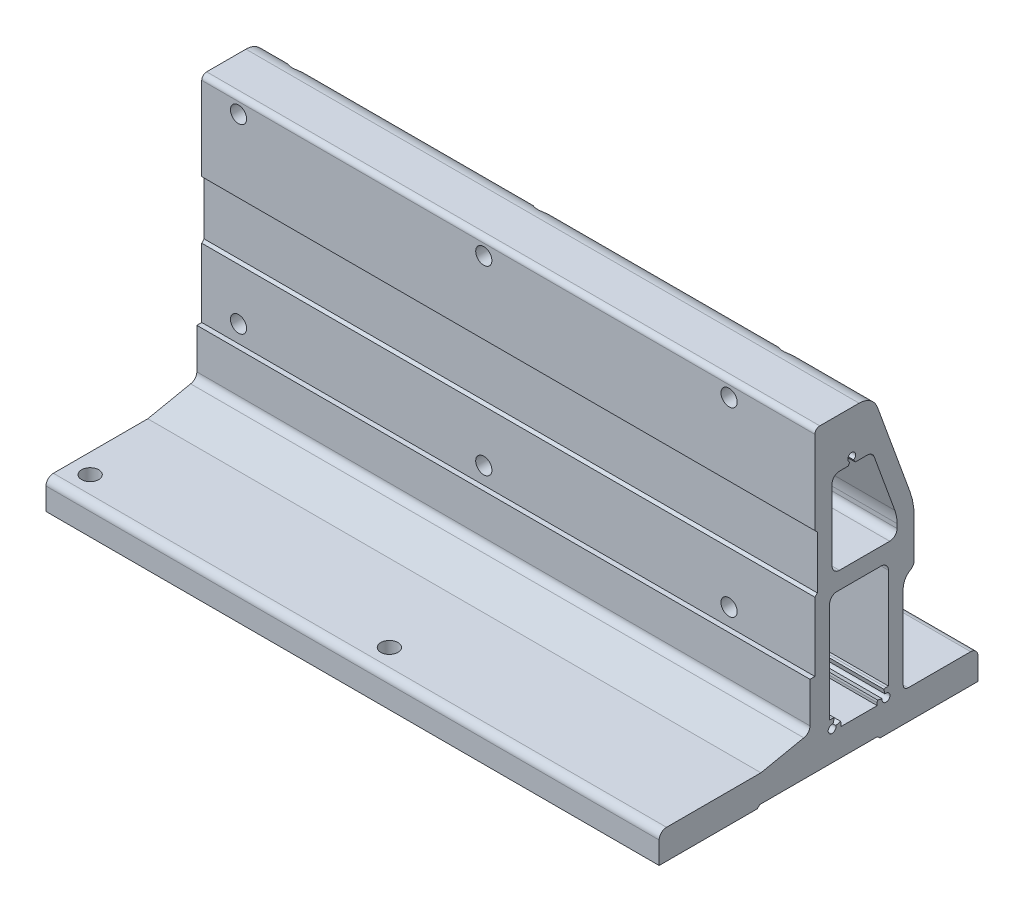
ISO-10303-21;
HEADER;
FILE_DESCRIPTION(('STEP AP214'),'2;1');
FILE_NAME('part.step','',(''),(''),'','','');
FILE_SCHEMA(('AUTOMOTIVE_DESIGN { 1 0 10303 214 1 1 1 1 }'));
ENDSEC;
DATA;
#1=APPLICATION_CONTEXT('core data for automotive mechanical design processes');
#2=APPLICATION_PROTOCOL_DEFINITION('international standard','automotive_design',2000,#1);
#3=PRODUCT_CONTEXT('',#1,'mechanical');
#4=PRODUCT('Part','Part','',(#3));
#5=PRODUCT_RELATED_PRODUCT_CATEGORY('part','',(#4));
#6=PRODUCT_DEFINITION_FORMATION('','',#4);
#7=PRODUCT_DEFINITION_CONTEXT('part definition',#1,'design');
#8=PRODUCT_DEFINITION('design','',#6,#7);
#9=PRODUCT_DEFINITION_SHAPE('','',#8);
#10=(LENGTH_UNIT() NAMED_UNIT(*) SI_UNIT(.MILLI.,.METRE.));
#11=(NAMED_UNIT(*) PLANE_ANGLE_UNIT() SI_UNIT($,.RADIAN.));
#12=(NAMED_UNIT(*) SI_UNIT($,.STERADIAN.) SOLID_ANGLE_UNIT());
#13=UNCERTAINTY_MEASURE_WITH_UNIT(LENGTH_MEASURE(1.E-05),#10,'distance_accuracy_value','');
#14=(GEOMETRIC_REPRESENTATION_CONTEXT(3) GLOBAL_UNCERTAINTY_ASSIGNED_CONTEXT((#13)) GLOBAL_UNIT_ASSIGNED_CONTEXT((#10,
#11,#12)) REPRESENTATION_CONTEXT('',''));
#15=CARTESIAN_POINT('',(0.,0.,0.));
#16=DIRECTION('',(0.,0.,1.));
#17=DIRECTION('',(1.,0.,0.));
#18=AXIS2_PLACEMENT_3D('',#15,#16,#17);
#19=CARTESIAN_POINT('',(125.,119.499999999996,-0.500000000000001));
#20=DIRECTION('',(1.,0.,0.));
#21=DIRECTION('',(0.,0.,-1.));
#22=AXIS2_PLACEMENT_3D('',#19,#20,#21);
#23=PLANE('',#22);
#24=DIRECTION('',(0.,-0.707106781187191,-0.707106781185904));
#25=VECTOR('',#24,1.);
#26=CARTESIAN_POINT('',(125.,84.4999999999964,0.5));
#27=LINE('',#26,#25);
#28=CARTESIAN_POINT('',(125.,85.4999999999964,1.49999999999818));
#29=VERTEX_POINT('',#28);
#30=CARTESIAN_POINT('',(125.,84.4999999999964,0.5));
#31=VERTEX_POINT('',#30);
#32=EDGE_CURVE('E807',#29,#31,#27,.T.);
#33=ORIENTED_EDGE('',*,*,#32,.T.);
#34=DIRECTION('',(0.,-1.,0.));
#35=VECTOR('',#34,1.);
#36=CARTESIAN_POINT('',(125.,62.9999999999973,0.500000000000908));
#37=LINE('',#36,#35);
#38=CARTESIAN_POINT('',(125.,62.9999999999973,0.500000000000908));
#39=VERTEX_POINT('',#38);
#40=EDGE_CURVE('E810',#31,#39,#37,.T.);
#41=ORIENTED_EDGE('',*,*,#40,.T.);
#42=DIRECTION('',(0.,-0.70710678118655,0.707106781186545));
#43=VECTOR('',#42,1.);
#44=CARTESIAN_POINT('',(125.,61.9999999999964,1.50000000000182));
#45=LINE('',#44,#43);
#46=CARTESIAN_POINT('',(125.,61.9999999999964,1.50000000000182));
#47=VERTEX_POINT('',#46);
#48=EDGE_CURVE('E813',#39,#47,#45,.T.);
#49=ORIENTED_EDGE('',*,*,#48,.T.);
#50=DIRECTION('',(0.,-1.,0.));
#51=VECTOR('',#50,1.);
#52=CARTESIAN_POINT('',(125.,33.9999999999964,1.50000000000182));
#53=LINE('',#52,#51);
#54=CARTESIAN_POINT('',(125.,33.9999999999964,1.50000000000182));
#55=VERTEX_POINT('',#54);
#56=EDGE_CURVE('E815',#47,#55,#53,.T.);
#57=ORIENTED_EDGE('',*,*,#56,.T.);
#58=DIRECTION('',(0.,0.,1.));
#59=VECTOR('',#58,1.);
#60=CARTESIAN_POINT('',(125.,33.9999999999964,3.5));
#61=LINE('',#60,#59);
#62=CARTESIAN_POINT('',(125.,33.9999999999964,3.5));
#63=VERTEX_POINT('',#62);
#64=EDGE_CURVE('E817',#55,#63,#61,.T.);
#65=ORIENTED_EDGE('',*,*,#64,.T.);
#66=DIRECTION('',(0.,-1.,0.));
#67=VECTOR('',#66,1.);
#68=CARTESIAN_POINT('',(125.,17.5660963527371,3.5));
#69=LINE('',#68,#67);
#70=CARTESIAN_POINT('',(125.,17.5660963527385,3.5));
#71=VERTEX_POINT('',#70);
#72=EDGE_CURVE('E819',#63,#71,#69,.T.);
#73=ORIENTED_EDGE('',*,*,#72,.T.);
#74=CARTESIAN_POINT('',(125.,17.5660963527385,6.50000000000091));
#75=DIRECTION('',(-1.,0.,0.));
#76=DIRECTION('',(0.,0.,-1.));
#77=AXIS2_PLACEMENT_3D('',#74,#75,#76);
#78=CIRCLE('',#77,3.00000000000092);
#79=CARTESIAN_POINT('',(125.,14.6023377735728,6.03509669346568));
#80=VERTEX_POINT('',#79);
#81=EDGE_CURVE('E821',#71,#80,#78,.T.);
#82=ORIENTED_EDGE('',*,*,#81,.T.);
#83=DIRECTION('',(0.,-0.20200917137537,0.979383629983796));
#84=VECTOR('',#83,1.);
#85=CARTESIAN_POINT('',(125.,11.,23.5000000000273));
#86=LINE('',#85,#84);
#87=CARTESIAN_POINT('',(125.,11.,23.5000000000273));
#88=VERTEX_POINT('',#87);
#89=EDGE_CURVE('E823',#80,#88,#86,.T.);
#90=ORIENTED_EDGE('',*,*,#89,.T.);
#91=DIRECTION('',(0.,0.,1.));
#92=VECTOR('',#91,1.);
#93=CARTESIAN_POINT('',(125.,11.,62.));
#94=LINE('',#93,#92);
#95=CARTESIAN_POINT('',(125.,11.,62.));
#96=VERTEX_POINT('',#95);
#97=EDGE_CURVE('E825',#88,#96,#94,.T.);
#98=ORIENTED_EDGE('',*,*,#97,.T.);
#99=CARTESIAN_POINT('',(125.,8.,62.));
#100=DIRECTION('',(1.,0.,0.));
#101=DIRECTION('',(0.,0.,-1.));
#102=AXIS2_PLACEMENT_3D('',#99,#100,#101);
#103=CIRCLE('',#102,3.);
#104=CARTESIAN_POINT('',(125.,8.,65.));
#105=VERTEX_POINT('',#104);
#106=EDGE_CURVE('E827',#96,#105,#103,.T.);
#107=ORIENTED_EDGE('',*,*,#106,.T.);
#108=DIRECTION('',(0.,-1.,0.));
#109=VECTOR('',#108,1.);
#110=CARTESIAN_POINT('',(125.,-1.,65.));
#111=LINE('',#110,#109);
#112=CARTESIAN_POINT('',(125.,-1.,65.));
#113=VERTEX_POINT('',#112);
#114=EDGE_CURVE('E829',#105,#113,#111,.T.);
#115=ORIENTED_EDGE('',*,*,#114,.T.);
#116=DIRECTION('',(0.,0.,-1.));
#117=VECTOR('',#116,1.);
#118=CARTESIAN_POINT('',(125.,-1.,25.));
#119=LINE('',#118,#117);
#120=CARTESIAN_POINT('',(125.,-1.,25.));
#121=VERTEX_POINT('',#120);
#122=EDGE_CURVE('E831',#113,#121,#119,.T.);
#123=ORIENTED_EDGE('',*,*,#122,.T.);
#124=DIRECTION('',(0.,0.707106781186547,-0.707106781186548));
#125=VECTOR('',#124,1.);
#126=CARTESIAN_POINT('',(125.,0.,24.));
#127=LINE('',#126,#125);
#128=CARTESIAN_POINT('',(125.,0.,24.));
#129=VERTEX_POINT('',#128);
#130=EDGE_CURVE('E833',#121,#129,#127,.T.);
#131=ORIENTED_EDGE('',*,*,#130,.T.);
#132=DIRECTION('',(0.,0.,-1.));
#133=VECTOR('',#132,1.);
#134=CARTESIAN_POINT('',(125.,0.,-24.));
#135=LINE('',#134,#133);
#136=CARTESIAN_POINT('',(125.,0.,-24.));
#137=VERTEX_POINT('',#136);
#138=EDGE_CURVE('E835',#129,#137,#135,.T.);
#139=ORIENTED_EDGE('',*,*,#138,.T.);
#140=DIRECTION('',(0.,-0.707106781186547,-0.707106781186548));
#141=VECTOR('',#140,1.);
#142=CARTESIAN_POINT('',(125.,-1.,-25.));
#143=LINE('',#142,#141);
#144=CARTESIAN_POINT('',(125.,-1.,-25.));
#145=VERTEX_POINT('',#144);
#146=EDGE_CURVE('E837',#137,#145,#143,.T.);
#147=ORIENTED_EDGE('',*,*,#146,.T.);
#148=DIRECTION('',(0.,0.,-1.));
#149=VECTOR('',#148,1.);
#150=CARTESIAN_POINT('',(125.,-1.,-64.9999999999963));
#151=LINE('',#150,#149);
#152=CARTESIAN_POINT('',(125.,-1.,-64.9999999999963));
#153=VERTEX_POINT('',#152);
#154=EDGE_CURVE('E839',#145,#153,#151,.T.);
#155=ORIENTED_EDGE('',*,*,#154,.T.);
#156=DIRECTION('',(0.,1.,0.));
#157=VECTOR('',#156,1.);
#158=CARTESIAN_POINT('',(125.,8.,-64.9999999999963));
#159=LINE('',#158,#157);
#160=CARTESIAN_POINT('',(125.,8.,-64.9999999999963));
#161=VERTEX_POINT('',#160);
#162=EDGE_CURVE('E841',#153,#161,#159,.T.);
#163=ORIENTED_EDGE('',*,*,#162,.T.);
#164=CARTESIAN_POINT('',(125.,8.,-61.9999999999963));
#165=DIRECTION('',(1.,0.,0.));
#166=DIRECTION('',(0.,0.,-1.));
#167=AXIS2_PLACEMENT_3D('',#164,#165,#166);
#168=CIRCLE('',#167,3.);
#169=CARTESIAN_POINT('',(125.,11.,-61.9999999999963));
#170=VERTEX_POINT('',#169);
#171=EDGE_CURVE('E843',#161,#170,#168,.T.);
#172=ORIENTED_EDGE('',*,*,#171,.T.);
#173=DIRECTION('',(0.,0.,1.));
#174=VECTOR('',#173,1.);
#175=CARTESIAN_POINT('',(125.,11.,-36.4999999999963));
#176=LINE('',#175,#174);
#177=CARTESIAN_POINT('',(125.,11.,-36.4999999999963));
#178=VERTEX_POINT('',#177);
#179=EDGE_CURVE('E845',#170,#178,#176,.T.);
#180=ORIENTED_EDGE('',*,*,#179,.T.);
#181=CARTESIAN_POINT('',(125.,13.,-36.4999999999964));
#182=DIRECTION('',(-1.,0.,0.));
#183=DIRECTION('',(0.,0.,-1.));
#184=AXIS2_PLACEMENT_3D('',#181,#182,#183);
#185=CIRCLE('',#184,2.);
#186=CARTESIAN_POINT('',(125.,13.,-34.4999999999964));
#187=VERTEX_POINT('',#186);
#188=EDGE_CURVE('E847',#178,#187,#185,.T.);
#189=ORIENTED_EDGE('',*,*,#188,.T.);
#190=DIRECTION('',(0.,1.,0.));
#191=VECTOR('',#190,1.);
#192=CARTESIAN_POINT('',(125.,47.,-34.4999999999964));
#193=LINE('',#192,#191);
#194=CARTESIAN_POINT('',(125.,47.,-34.4999999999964));
#195=VERTEX_POINT('',#194);
#196=EDGE_CURVE('E849',#187,#195,#193,.T.);
#197=ORIENTED_EDGE('',*,*,#196,.T.);
#198=CARTESIAN_POINT('',(125.,46.9999999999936,-40.5000000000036));
#199=DIRECTION('',(-1.,0.,0.));
#200=DIRECTION('',(0.,0.,-1.));
#201=AXIS2_PLACEMENT_3D('',#198,#199,#200);
#202=CIRCLE('',#201,6.00000000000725);
#203=CARTESIAN_POINT('',(125.,52.1961524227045,-37.4999999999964));
#204=VERTEX_POINT('',#203);
#205=EDGE_CURVE('E851',#195,#204,#202,.T.);
#206=ORIENTED_EDGE('',*,*,#205,.T.);
#207=CARTESIAN_POINT('',(125.,54.7942286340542,-35.9999999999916));
#208=DIRECTION('',(1.,0.,0.));
#209=DIRECTION('',(0.,0.,-1.));
#210=AXIS2_PLACEMENT_3D('',#207,#208,#209);
#211=CIRCLE('',#210,2.99999999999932);
#212=CARTESIAN_POINT('',(125.,54.7942286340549,-38.9999999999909));
#213=VERTEX_POINT('',#212);
#214=EDGE_CURVE('E853',#204,#213,#211,.T.);
#215=ORIENTED_EDGE('',*,*,#214,.T.);
#216=DIRECTION('',(0.,1.,0.));
#217=VECTOR('',#216,1.);
#218=CARTESIAN_POINT('',(125.,69.8212973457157,-38.9999999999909));
#219=LINE('',#218,#217);
#220=CARTESIAN_POINT('',(125.,69.8212973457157,-38.9999999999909));
#221=VERTEX_POINT('',#220);
#222=EDGE_CURVE('E855',#213,#221,#219,.T.);
#223=ORIENTED_EDGE('',*,*,#222,.T.);
#224=CARTESIAN_POINT('',(125.,69.8212973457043,-8.99999999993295));
#225=DIRECTION('',(1.,0.,0.));
#226=DIRECTION('',(0.,0.,-1.));
#227=AXIS2_PLACEMENT_3D('',#224,#225,#226);
#228=CIRCLE('',#227,30.000000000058);
#229=CARTESIAN_POINT('',(125.,80.0819016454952,-37.1907786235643));
#230=VERTEX_POINT('',#229);
#231=EDGE_CURVE('E857',#221,#230,#228,.T.);
#232=ORIENTED_EDGE('',*,*,#231,.T.);
#233=DIRECTION('',(0.,0.93969262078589,0.34202014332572));
#234=VECTOR('',#233,1.);
#235=CARTESIAN_POINT('',(125.,116.236161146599,-24.0317043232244));
#236=LINE('',#235,#234);
#237=CARTESIAN_POINT('',(125.,116.236161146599,-24.0317043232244));
#238=VERTEX_POINT('',#237);
#239=EDGE_CURVE('E859',#230,#238,#236,.T.);
#240=ORIENTED_EDGE('',*,*,#239,.T.);
#241=CARTESIAN_POINT('',(125.,113.499999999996,-16.5141633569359));
#242=DIRECTION('',(1.,0.,0.));
#243=DIRECTION('',(0.,0.,-1.));
#244=AXIS2_PLACEMENT_3D('',#241,#242,#243);
#245=CIRCLE('',#244,8.00000000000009);
#246=CARTESIAN_POINT('',(125.,121.499999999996,-16.5141633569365));
#247=VERTEX_POINT('',#246);
#248=EDGE_CURVE('E861',#238,#247,#245,.T.);
#249=ORIENTED_EDGE('',*,*,#248,.T.);
#250=DIRECTION('',(0.,0.,1.));
#251=VECTOR('',#250,1.);
#252=CARTESIAN_POINT('',(125.,121.499999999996,-0.5));
#253=LINE('',#252,#251);
#254=CARTESIAN_POINT('',(125.,121.499999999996,-0.5));
#255=VERTEX_POINT('',#254);
#256=EDGE_CURVE('E863',#247,#255,#253,.T.);
#257=ORIENTED_EDGE('',*,*,#256,.T.);
#258=CARTESIAN_POINT('',(125.,119.499999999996,-0.500000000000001));
#259=DIRECTION('',(1.,0.,0.));
#260=DIRECTION('',(0.,0.,-1.));
#261=AXIS2_PLACEMENT_3D('',#258,#259,#260);
#262=CIRCLE('',#261,2.);
#263=CARTESIAN_POINT('',(125.,119.499999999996,1.5));
#264=VERTEX_POINT('',#263);
#265=EDGE_CURVE('E865',#255,#264,#262,.T.);
#266=ORIENTED_EDGE('',*,*,#265,.T.);
#267=DIRECTION('',(0.,-1.,0.));
#268=VECTOR('',#267,1.);
#269=CARTESIAN_POINT('',(125.,85.4999999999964,1.49999999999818));
#270=LINE('',#269,#268);
#271=EDGE_CURVE('E867',#264,#29,#270,.T.);
#272=ORIENTED_EDGE('',*,*,#271,.T.);
#273=EDGE_LOOP('',(#33,#41,#49,#57,#65,#73,#82,#90,#98,#107,#115,#123,#131,#139,#147,#155,#163,
#172,#180,#189,#197,#206,#215,#223,#232,#240,#249,#257,#266,#272));
#274=FACE_BOUND('',#273,.T.);
#275=DIRECTION('',(0.,0.,1.));
#276=VECTOR('',#275,1.);
#277=CARTESIAN_POINT('',(125.,101.499999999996,-14.9433739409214));
#278=LINE('',#277,#276);
#279=CARTESIAN_POINT('',(125.,101.499999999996,-19.845361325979));
#280=VERTEX_POINT('',#279);
#281=CARTESIAN_POINT('',(125.,101.499999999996,-14.9433739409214));
#282=VERTEX_POINT('',#281);
#283=EDGE_CURVE('E708',#280,#282,#278,.T.);
#284=ORIENTED_EDGE('',*,*,#283,.F.);
#285=CARTESIAN_POINT('',(125.,98.4999999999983,-19.8453613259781));
#286=DIRECTION('',(1.,0.,0.));
#287=DIRECTION('',(0.,0.,-1.));
#288=AXIS2_PLACEMENT_3D('',#285,#286,#287);
#289=CIRCLE('',#288,2.99999999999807);
#290=CARTESIAN_POINT('',(125.,99.5260604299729,-22.6644391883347));
#291=VERTEX_POINT('',#290);
#292=EDGE_CURVE('E706',#291,#280,#289,.T.);
#293=ORIENTED_EDGE('',*,*,#292,.F.);
#294=DIRECTION('',(0.,0.939692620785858,0.342020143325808));
#295=VECTOR('',#294,1.);
#296=CARTESIAN_POINT('',(125.,99.5260604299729,-22.6644391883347));
#297=LINE('',#296,#295);
#298=CARTESIAN_POINT('',(125.,76.3622153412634,-31.0953893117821));
#299=VERTEX_POINT('',#298);
#300=EDGE_CURVE('E734',#299,#291,#297,.T.);
#301=ORIENTED_EDGE('',*,*,#300,.F.);
#302=CARTESIAN_POINT('',(125.,71.2319131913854,-16.99999999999));
#303=DIRECTION('',(1.,0.,0.));
#304=DIRECTION('',(0.,0.,-1.));
#305=AXIS2_PLACEMENT_3D('',#302,#303,#304);
#306=CIRCLE('',#305,15.0000000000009);
#307=CARTESIAN_POINT('',(125.,71.2319131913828,-31.9999999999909));
#308=VERTEX_POINT('',#307);
#309=EDGE_CURVE('E731',#308,#299,#306,.T.);
#310=ORIENTED_EDGE('',*,*,#309,.F.);
#311=DIRECTION('',(0.,1.,0.));
#312=VECTOR('',#311,1.);
#313=CARTESIAN_POINT('',(125.,71.2319131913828,-31.9999999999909));
#314=LINE('',#313,#312);
#315=CARTESIAN_POINT('',(125.,69.5,-31.9999999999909));
#316=VERTEX_POINT('',#315);
#317=EDGE_CURVE('E729',#316,#308,#314,.T.);
#318=ORIENTED_EDGE('',*,*,#317,.F.);
#319=CARTESIAN_POINT('',(125.,69.5,-28.9999999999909));
#320=DIRECTION('',(1.,0.,0.));
#321=DIRECTION('',(0.,0.,-1.));
#322=AXIS2_PLACEMENT_3D('',#319,#320,#321);
#323=CIRCLE('',#322,3.);
#324=CARTESIAN_POINT('',(125.,66.5,-28.9999999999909));
#325=VERTEX_POINT('',#324);
#326=EDGE_CURVE('E727',#325,#316,#323,.T.);
#327=ORIENTED_EDGE('',*,*,#326,.F.);
#328=DIRECTION('',(0.,0.,-1.));
#329=VECTOR('',#328,1.);
#330=CARTESIAN_POINT('',(125.,66.5,-28.9999999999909));
#331=LINE('',#330,#329);
#332=CARTESIAN_POINT('',(125.,66.5,-8.5));
#333=VERTEX_POINT('',#332);
#334=EDGE_CURVE('E725',#333,#325,#331,.T.);
#335=ORIENTED_EDGE('',*,*,#334,.F.);
#336=CARTESIAN_POINT('',(125.,69.5,-8.5));
#337=DIRECTION('',(1.,0.,0.));
#338=DIRECTION('',(0.,0.,-1.));
#339=AXIS2_PLACEMENT_3D('',#336,#337,#338);
#340=CIRCLE('',#339,3.);
#341=CARTESIAN_POINT('',(125.,69.5,-5.5));
#342=VERTEX_POINT('',#341);
#343=EDGE_CURVE('E723',#342,#333,#340,.T.);
#344=ORIENTED_EDGE('',*,*,#343,.F.);
#345=DIRECTION('',(0.,-1.,0.));
#346=VECTOR('',#345,1.);
#347=CARTESIAN_POINT('',(125.,69.5,-5.5));
#348=LINE('',#347,#346);
#349=CARTESIAN_POINT('',(125.,98.5,-5.5));
#350=VERTEX_POINT('',#349);
#351=EDGE_CURVE('E721',#350,#342,#348,.T.);
#352=ORIENTED_EDGE('',*,*,#351,.F.);
#353=CARTESIAN_POINT('',(125.,98.5,-8.5));
#354=DIRECTION('',(1.,0.,0.));
#355=DIRECTION('',(0.,0.,-1.));
#356=AXIS2_PLACEMENT_3D('',#353,#354,#355);
#357=CIRCLE('',#356,3.);
#358=CARTESIAN_POINT('',(125.,101.5,-8.5));
#359=VERTEX_POINT('',#358);
#360=EDGE_CURVE('E719',#359,#350,#357,.T.);
#361=ORIENTED_EDGE('',*,*,#360,.F.);
#362=DIRECTION('',(0.,0.,1.));
#363=VECTOR('',#362,1.);
#364=CARTESIAN_POINT('',(125.,101.5,-8.5));
#365=LINE('',#364,#363);
#366=CARTESIAN_POINT('',(125.,101.5,-12.0566260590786));
#367=VERTEX_POINT('',#366);
#368=EDGE_CURVE('E717',#367,#359,#365,.T.);
#369=ORIENTED_EDGE('',*,*,#368,.F.);
#370=DIRECTION('',(0.,-0.866025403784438,0.500000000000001));
#371=VECTOR('',#370,1.);
#372=CARTESIAN_POINT('',(125.,101.5,-12.0566260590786));
#373=LINE('',#372,#371);
#374=CARTESIAN_POINT('',(125.,102.614356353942,-12.7000000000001));
#375=VERTEX_POINT('',#374);
#376=EDGE_CURVE('E715',#375,#367,#373,.T.);
#377=ORIENTED_EDGE('',*,*,#376,.F.);
#378=CARTESIAN_POINT('',(125.,103.999996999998,-13.5000000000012));
#379=DIRECTION('',(1.,0.,0.));
#380=DIRECTION('',(0.,0.,-1.));
#381=AXIS2_PLACEMENT_3D('',#378,#379,#380);
#382=CIRCLE('',#381,1.60000000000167);
#383=CARTESIAN_POINT('',(125.,102.61435635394,-14.2999999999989));
#384=VERTEX_POINT('',#383);
#385=EDGE_CURVE('E713',#384,#375,#382,.T.);
#386=ORIENTED_EDGE('',*,*,#385,.F.);
#387=DIRECTION('',(0.,0.866025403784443,0.499999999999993));
#388=VECTOR('',#387,1.);
#389=CARTESIAN_POINT('',(125.,102.61435635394,-14.2999999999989));
#390=LINE('',#389,#388);
#391=EDGE_CURVE('E711',#282,#384,#390,.T.);
#392=ORIENTED_EDGE('',*,*,#391,.F.);
#393=EDGE_LOOP('',(#284,#293,#301,#310,#318,#327,#335,#344,#352,#361,#369,#377,#386,#392));
#394=FACE_BOUND('',#393,.T.);
#395=DIRECTION('',(0.,1.,0.));
#396=VECTOR('',#395,1.);
#397=CARTESIAN_POINT('',(125.,15.5999999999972,-28.4999999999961));
#398=LINE('',#397,#396);
#399=CARTESIAN_POINT('',(125.,15.5999999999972,-28.4999999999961));
#400=VERTEX_POINT('',#399);
#401=CARTESIAN_POINT('',(125.,56.4999999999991,-28.4999999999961));
#402=VERTEX_POINT('',#401);
#403=EDGE_CURVE('E565',#400,#402,#398,.T.);
#404=ORIENTED_EDGE('',*,*,#403,.F.);
#405=DIRECTION('',(0.,0.,-1.));
#406=VECTOR('',#405,1.);
#407=CARTESIAN_POINT('',(125.,15.5999999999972,-27.4999999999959));
#408=LINE('',#407,#406);
#409=CARTESIAN_POINT('',(125.,15.5999999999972,-27.4999999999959));
#410=VERTEX_POINT('',#409);
#411=EDGE_CURVE('E563',#410,#400,#408,.T.);
#412=ORIENTED_EDGE('',*,*,#411,.F.);
#413=CARTESIAN_POINT('',(125.,11.9999999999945,-27.4999999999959));
#414=DIRECTION('',(-1.,0.,0.));
#415=DIRECTION('',(0.,0.,-1.));
#416=AXIS2_PLACEMENT_3D('',#413,#414,#415);
#417=CIRCLE('',#416,3.60000000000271);
#418=CARTESIAN_POINT('',(125.,15.477332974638,-26.5682514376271));
#419=VERTEX_POINT('',#418);
#420=EDGE_CURVE('E603',#419,#410,#417,.T.);
#421=ORIENTED_EDGE('',*,*,#420,.F.);
#422=DIRECTION('',(0.,0.965925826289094,0.258819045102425));
#423=VECTOR('',#422,1.);
#424=CARTESIAN_POINT('',(125.,13.5454813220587,-27.0858895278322));
#425=LINE('',#424,#423);
#426=CARTESIAN_POINT('',(125.,13.5454813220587,-27.0858895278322));
#427=VERTEX_POINT('',#426);
#428=EDGE_CURVE('E600',#427,#419,#425,.T.);
#429=ORIENTED_EDGE('',*,*,#428,.F.);
#430=CARTESIAN_POINT('',(125.,11.9999999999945,-27.4999999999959));
#431=DIRECTION('',(1.,0.,0.));
#432=DIRECTION('',(0.,0.,-1.));
#433=AXIS2_PLACEMENT_3D('',#430,#431,#432);
#434=CIRCLE('',#433,1.60000000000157);
#435=CARTESIAN_POINT('',(125.,12.4141104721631,-25.954518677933));
#436=VERTEX_POINT('',#435);
#437=EDGE_CURVE('E598',#436,#427,#434,.T.);
#438=ORIENTED_EDGE('',*,*,#437,.F.);
#439=DIRECTION('',(0.,-0.258819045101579,-0.965925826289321));
#440=VECTOR('',#439,1.);
#441=CARTESIAN_POINT('',(125.,12.931748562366,-24.0226670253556));
#442=LINE('',#441,#440);
#443=CARTESIAN_POINT('',(125.,12.931748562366,-24.0226670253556));
#444=VERTEX_POINT('',#443);
#445=EDGE_CURVE('E596',#444,#436,#442,.T.);
#446=ORIENTED_EDGE('',*,*,#445,.F.);
#447=CARTESIAN_POINT('',(125.,11.9999999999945,-27.4999999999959));
#448=DIRECTION('',(-1.,0.,0.));
#449=DIRECTION('',(0.,0.,-1.));
#450=AXIS2_PLACEMENT_3D('',#447,#448,#449);
#451=CIRCLE('',#450,3.60000000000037);
#452=CARTESIAN_POINT('',(125.,11.9999999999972,-23.8999999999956));
#453=VERTEX_POINT('',#452);
#454=EDGE_CURVE('E594',#453,#444,#451,.T.);
#455=ORIENTED_EDGE('',*,*,#454,.F.);
#456=DIRECTION('',(0.,1.,0.));
#457=VECTOR('',#456,1.);
#458=CARTESIAN_POINT('',(125.,10.9999999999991,-23.8999999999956));
#459=LINE('',#458,#457);
#460=CARTESIAN_POINT('',(125.,10.9999999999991,-23.8999999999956));
#461=VERTEX_POINT('',#460);
#462=EDGE_CURVE('E592',#461,#453,#459,.T.);
#463=ORIENTED_EDGE('',*,*,#462,.F.);
#464=DIRECTION('',(0.,0.,-1.));
#465=VECTOR('',#464,1.);
#466=CARTESIAN_POINT('',(125.,10.9999999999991,-9.09999999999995));
#467=LINE('',#466,#465);
#468=CARTESIAN_POINT('',(125.,10.9999999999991,-9.09999999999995));
#469=VERTEX_POINT('',#468);
#470=EDGE_CURVE('E590',#469,#461,#467,.T.);
#471=ORIENTED_EDGE('',*,*,#470,.F.);
#472=DIRECTION('',(0.,-1.,0.));
#473=VECTOR('',#472,1.);
#474=CARTESIAN_POINT('',(125.,11.9999999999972,-9.09999999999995));
#475=LINE('',#474,#473);
#476=CARTESIAN_POINT('',(125.,11.9999999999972,-9.09999999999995));
#477=VERTEX_POINT('',#476);
#478=EDGE_CURVE('E588',#477,#469,#475,.T.);
#479=ORIENTED_EDGE('',*,*,#478,.F.);
#480=CARTESIAN_POINT('',(125.,11.9999999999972,-5.499999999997));
#481=DIRECTION('',(-1.,0.,0.));
#482=DIRECTION('',(0.,0.,-1.));
#483=AXIS2_PLACEMENT_3D('',#480,#481,#482);
#484=CIRCLE('',#483,3.60000000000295);
#485=CARTESIAN_POINT('',(125.,12.9317485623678,-8.97733297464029));
#486=VERTEX_POINT('',#485);
#487=EDGE_CURVE('E586',#486,#477,#484,.T.);
#488=ORIENTED_EDGE('',*,*,#487,.F.);
#489=DIRECTION('',(0.,0.258819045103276,-0.965925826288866));
#490=VECTOR('',#489,1.);
#491=CARTESIAN_POINT('',(125.,12.4141104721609,-7.045481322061));
#492=LINE('',#491,#490);
#493=CARTESIAN_POINT('',(125.,12.4141104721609,-7.045481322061));
#494=VERTEX_POINT('',#493);
#495=EDGE_CURVE('E584',#494,#486,#492,.T.);
#496=ORIENTED_EDGE('',*,*,#495,.F.);
#497=CARTESIAN_POINT('',(125.,11.9999999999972,-5.499999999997));
#498=DIRECTION('',(1.,0.,0.));
#499=DIRECTION('',(0.,0.,-1.));
#500=AXIS2_PLACEMENT_3D('',#497,#498,#499);
#501=CIRCLE('',#500,1.60000000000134);
#502=CARTESIAN_POINT('',(125.,13.5454813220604,-5.91411047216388));
#503=VERTEX_POINT('',#502);
#504=EDGE_CURVE('E582',#503,#494,#501,.T.);
#505=ORIENTED_EDGE('',*,*,#504,.F.);
#506=DIRECTION('',(0.,-0.965925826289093,0.258819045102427));
#507=VECTOR('',#506,1.);
#508=CARTESIAN_POINT('',(125.,15.4773329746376,-6.43174856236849));
#509=LINE('',#508,#507);
#510=CARTESIAN_POINT('',(125.,15.4773329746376,-6.43174856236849));
#511=VERTEX_POINT('',#510);
#512=EDGE_CURVE('E580',#511,#503,#509,.T.);
#513=ORIENTED_EDGE('',*,*,#512,.F.);
#514=CARTESIAN_POINT('',(125.,11.9999999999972,-5.499999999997));
#515=DIRECTION('',(-1.,0.,0.));
#516=DIRECTION('',(0.,0.,-1.));
#517=AXIS2_PLACEMENT_3D('',#514,#515,#516);
#518=CIRCLE('',#517,3.60000000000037);
#519=CARTESIAN_POINT('',(125.,15.5999999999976,-5.49999999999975));
#520=VERTEX_POINT('',#519);
#521=EDGE_CURVE('E578',#520,#511,#518,.T.);
#522=ORIENTED_EDGE('',*,*,#521,.F.);
#523=DIRECTION('',(0.,0.,-1.));
#524=VECTOR('',#523,1.);
#525=CARTESIAN_POINT('',(125.,15.5999999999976,-4.49999999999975));
#526=LINE('',#525,#524);
#527=CARTESIAN_POINT('',(125.,15.5999999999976,-4.49999999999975));
#528=VERTEX_POINT('',#527);
#529=EDGE_CURVE('E576',#528,#520,#526,.T.);
#530=ORIENTED_EDGE('',*,*,#529,.F.);
#531=DIRECTION('',(0.,-1.,0.));
#532=VECTOR('',#531,1.);
#533=CARTESIAN_POINT('',(125.,56.4999999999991,-4.49999999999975));
#534=LINE('',#533,#532);
#535=CARTESIAN_POINT('',(125.,56.4999999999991,-4.49999999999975));
#536=VERTEX_POINT('',#535);
#537=EDGE_CURVE('E574',#536,#528,#534,.T.);
#538=ORIENTED_EDGE('',*,*,#537,.F.);
#539=CARTESIAN_POINT('',(125.,56.4999999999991,-7.49999999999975));
#540=DIRECTION('',(1.,0.,0.));
#541=DIRECTION('',(0.,0.,-1.));
#542=AXIS2_PLACEMENT_3D('',#539,#540,#541);
#543=CIRCLE('',#542,3.);
#544=CARTESIAN_POINT('',(125.,59.4999999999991,-7.49999999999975));
#545=VERTEX_POINT('',#544);
#546=EDGE_CURVE('E572',#545,#536,#543,.T.);
#547=ORIENTED_EDGE('',*,*,#546,.F.);
#548=DIRECTION('',(0.,0.,1.));
#549=VECTOR('',#548,1.);
#550=CARTESIAN_POINT('',(125.,59.4999999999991,-25.4999999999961));
#551=LINE('',#550,#549);
#552=CARTESIAN_POINT('',(125.,59.4999999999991,-25.4999999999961));
#553=VERTEX_POINT('',#552);
#554=EDGE_CURVE('E570',#553,#545,#551,.T.);
#555=ORIENTED_EDGE('',*,*,#554,.F.);
#556=CARTESIAN_POINT('',(125.,56.4999999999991,-25.4999999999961));
#557=DIRECTION('',(1.,0.,0.));
#558=DIRECTION('',(0.,0.,-1.));
#559=AXIS2_PLACEMENT_3D('',#556,#557,#558);
#560=CIRCLE('',#559,3.);
#561=EDGE_CURVE('E568',#402,#553,#560,.T.);
#562=ORIENTED_EDGE('',*,*,#561,.F.);
#563=EDGE_LOOP('',(#404,#412,#421,#429,#438,#446,#455,#463,#471,#479,#488,#496,#505,#513,#522,
#530,#538,#547,#555,#562));
#564=FACE_BOUND('',#563,.T.);
#565=ADVANCED_FACE('F37',(#274,#394,#564),#23,.T.);
#566=CARTESIAN_POINT('',(-125.,119.499999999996,-0.500000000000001));
#567=DIRECTION('',(1.,0.,0.));
#568=DIRECTION('',(0.,0.,-1.));
#569=AXIS2_PLACEMENT_3D('',#566,#567,#568);
#570=PLANE('',#569);
#571=CARTESIAN_POINT('',(-125.,5.,-36.9999999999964));
#572=DIRECTION('',(-1.,0.,0.));
#573=DIRECTION('',(0.,0.,1.));
#574=AXIS2_PLACEMENT_3D('',#571,#572,#573);
#575=CIRCLE('',#574,1.64999999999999);
#576=CARTESIAN_POINT('',(-125.,5.,-35.3499999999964));
#577=VERTEX_POINT('',#576);
#578=EDGE_CURVE('E489',#577,#577,#575,.T.);
#579=ORIENTED_EDGE('',*,*,#578,.F.);
#580=EDGE_LOOP('',(#579));
#581=FACE_BOUND('',#580,.T.);
#582=CARTESIAN_POINT('',(-125.,5.,-8.99999999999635));
#583=DIRECTION('',(-1.,0.,0.));
#584=DIRECTION('',(0.,0.,1.));
#585=AXIS2_PLACEMENT_3D('',#582,#583,#584);
#586=CIRCLE('',#585,1.64999999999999);
#587=CARTESIAN_POINT('',(-125.,5.,-7.34999999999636));
#588=VERTEX_POINT('',#587);
#589=EDGE_CURVE('E495',#588,#588,#586,.T.);
#590=ORIENTED_EDGE('',*,*,#589,.F.);
#591=EDGE_LOOP('',(#590));
#592=FACE_BOUND('',#591,.T.);
#593=CARTESIAN_POINT('',(-125.,98.4999999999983,-19.8453613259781));
#594=DIRECTION('',(1.,0.,0.));
#595=DIRECTION('',(0.,0.,-1.));
#596=AXIS2_PLACEMENT_3D('',#593,#594,#595);
#597=CIRCLE('',#596,2.99999999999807);
#598=CARTESIAN_POINT('',(-125.,99.5260604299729,-22.6644391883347));
#599=VERTEX_POINT('',#598);
#600=CARTESIAN_POINT('',(-125.,101.499999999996,-19.845361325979));
#601=VERTEX_POINT('',#600);
#602=EDGE_CURVE('E705',#599,#601,#597,.T.);
#603=ORIENTED_EDGE('',*,*,#602,.T.);
#604=DIRECTION('',(0.,0.,1.));
#605=VECTOR('',#604,1.);
#606=CARTESIAN_POINT('',(-125.,101.499999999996,-14.9433739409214));
#607=LINE('',#606,#605);
#608=CARTESIAN_POINT('',(-125.,101.499999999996,-14.9433739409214));
#609=VERTEX_POINT('',#608);
#610=EDGE_CURVE('E739',#601,#609,#607,.T.);
#611=ORIENTED_EDGE('',*,*,#610,.T.);
#612=DIRECTION('',(0.,0.866025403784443,0.499999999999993));
#613=VECTOR('',#612,1.);
#614=CARTESIAN_POINT('',(-125.,102.61435635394,-14.2999999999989));
#615=LINE('',#614,#613);
#616=CARTESIAN_POINT('',(-125.,102.61435635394,-14.2999999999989));
#617=VERTEX_POINT('',#616);
#618=EDGE_CURVE('E742',#609,#617,#615,.T.);
#619=ORIENTED_EDGE('',*,*,#618,.T.);
#620=CARTESIAN_POINT('',(-125.,103.999996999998,-13.5000000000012));
#621=DIRECTION('',(1.,0.,0.));
#622=DIRECTION('',(0.,0.,-1.));
#623=AXIS2_PLACEMENT_3D('',#620,#621,#622);
#624=CIRCLE('',#623,1.60000000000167);
#625=CARTESIAN_POINT('',(-125.,102.614356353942,-12.7000000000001));
#626=VERTEX_POINT('',#625);
#627=EDGE_CURVE('E745',#617,#626,#624,.T.);
#628=ORIENTED_EDGE('',*,*,#627,.T.);
#629=DIRECTION('',(0.,-0.866025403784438,0.500000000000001));
#630=VECTOR('',#629,1.);
#631=CARTESIAN_POINT('',(-125.,101.5,-12.0566260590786));
#632=LINE('',#631,#630);
#633=CARTESIAN_POINT('',(-125.,101.5,-12.0566260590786));
#634=VERTEX_POINT('',#633);
#635=EDGE_CURVE('E748',#626,#634,#632,.T.);
#636=ORIENTED_EDGE('',*,*,#635,.T.);
#637=DIRECTION('',(0.,0.,1.));
#638=VECTOR('',#637,1.);
#639=CARTESIAN_POINT('',(-125.,101.5,-8.5));
#640=LINE('',#639,#638);
#641=CARTESIAN_POINT('',(-125.,101.5,-8.5));
#642=VERTEX_POINT('',#641);
#643=EDGE_CURVE('E751',#634,#642,#640,.T.);
#644=ORIENTED_EDGE('',*,*,#643,.T.);
#645=CARTESIAN_POINT('',(-125.,98.5,-8.5));
#646=DIRECTION('',(1.,0.,0.));
#647=DIRECTION('',(0.,0.,-1.));
#648=AXIS2_PLACEMENT_3D('',#645,#646,#647);
#649=CIRCLE('',#648,3.);
#650=CARTESIAN_POINT('',(-125.,98.5,-5.5));
#651=VERTEX_POINT('',#650);
#652=EDGE_CURVE('E754',#642,#651,#649,.T.);
#653=ORIENTED_EDGE('',*,*,#652,.T.);
#654=DIRECTION('',(0.,-1.,0.));
#655=VECTOR('',#654,1.);
#656=CARTESIAN_POINT('',(-125.,69.5,-5.5));
#657=LINE('',#656,#655);
#658=CARTESIAN_POINT('',(-125.,69.5,-5.5));
#659=VERTEX_POINT('',#658);
#660=EDGE_CURVE('E757',#651,#659,#657,.T.);
#661=ORIENTED_EDGE('',*,*,#660,.T.);
#662=CARTESIAN_POINT('',(-125.,69.5,-8.5));
#663=DIRECTION('',(1.,0.,0.));
#664=DIRECTION('',(0.,0.,-1.));
#665=AXIS2_PLACEMENT_3D('',#662,#663,#664);
#666=CIRCLE('',#665,3.);
#667=CARTESIAN_POINT('',(-125.,66.5,-8.5));
#668=VERTEX_POINT('',#667);
#669=EDGE_CURVE('E760',#659,#668,#666,.T.);
#670=ORIENTED_EDGE('',*,*,#669,.T.);
#671=DIRECTION('',(0.,0.,-1.));
#672=VECTOR('',#671,1.);
#673=CARTESIAN_POINT('',(-125.,66.5,-28.9999999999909));
#674=LINE('',#673,#672);
#675=CARTESIAN_POINT('',(-125.,66.5,-28.9999999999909));
#676=VERTEX_POINT('',#675);
#677=EDGE_CURVE('E763',#668,#676,#674,.T.);
#678=ORIENTED_EDGE('',*,*,#677,.T.);
#679=CARTESIAN_POINT('',(-125.,69.5,-28.9999999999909));
#680=DIRECTION('',(1.,0.,0.));
#681=DIRECTION('',(0.,0.,-1.));
#682=AXIS2_PLACEMENT_3D('',#679,#680,#681);
#683=CIRCLE('',#682,3.);
#684=CARTESIAN_POINT('',(-125.,69.5,-31.9999999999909));
#685=VERTEX_POINT('',#684);
#686=EDGE_CURVE('E766',#676,#685,#683,.T.);
#687=ORIENTED_EDGE('',*,*,#686,.T.);
#688=DIRECTION('',(0.,1.,0.));
#689=VECTOR('',#688,1.);
#690=CARTESIAN_POINT('',(-125.,71.2319131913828,-31.9999999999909));
#691=LINE('',#690,#689);
#692=CARTESIAN_POINT('',(-125.,71.2319131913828,-31.9999999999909));
#693=VERTEX_POINT('',#692);
#694=EDGE_CURVE('E769',#685,#693,#691,.T.);
#695=ORIENTED_EDGE('',*,*,#694,.T.);
#696=CARTESIAN_POINT('',(-125.,71.2319131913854,-16.99999999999));
#697=DIRECTION('',(1.,0.,0.));
#698=DIRECTION('',(0.,0.,-1.));
#699=AXIS2_PLACEMENT_3D('',#696,#697,#698);
#700=CIRCLE('',#699,15.0000000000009);
#701=CARTESIAN_POINT('',(-125.,76.3622153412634,-31.0953893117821));
#702=VERTEX_POINT('',#701);
#703=EDGE_CURVE('E772',#693,#702,#700,.T.);
#704=ORIENTED_EDGE('',*,*,#703,.T.);
#705=DIRECTION('',(0.,0.939692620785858,0.342020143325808));
#706=VECTOR('',#705,1.);
#707=CARTESIAN_POINT('',(-125.,99.5260604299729,-22.6644391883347));
#708=LINE('',#707,#706);
#709=EDGE_CURVE('E709',#702,#599,#708,.T.);
#710=ORIENTED_EDGE('',*,*,#709,.T.);
#711=EDGE_LOOP('',(#603,#611,#619,#628,#636,#644,#653,#661,#670,#678,#687,#695,#704,#710));
#712=FACE_BOUND('',#711,.T.);
#713=DIRECTION('',(0.,-0.707106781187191,-0.707106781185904));
#714=VECTOR('',#713,1.);
#715=CARTESIAN_POINT('',(-125.,84.4999999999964,0.5));
#716=LINE('',#715,#714);
#717=CARTESIAN_POINT('',(-125.,85.4999999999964,1.49999999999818));
#718=VERTEX_POINT('',#717);
#719=CARTESIAN_POINT('',(-125.,84.4999999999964,0.5));
#720=VERTEX_POINT('',#719);
#721=EDGE_CURVE('E806',#718,#720,#716,.T.);
#722=ORIENTED_EDGE('',*,*,#721,.F.);
#723=DIRECTION('',(0.,-1.,0.));
#724=VECTOR('',#723,1.);
#725=CARTESIAN_POINT('',(-125.,85.4999999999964,1.49999999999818));
#726=LINE('',#725,#724);
#727=CARTESIAN_POINT('',(-125.,119.499999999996,1.5));
#728=VERTEX_POINT('',#727);
#729=EDGE_CURVE('E811',#728,#718,#726,.T.);
#730=ORIENTED_EDGE('',*,*,#729,.F.);
#731=CARTESIAN_POINT('',(-125.,119.499999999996,-0.500000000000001));
#732=DIRECTION('',(1.,0.,0.));
#733=DIRECTION('',(0.,0.,-1.));
#734=AXIS2_PLACEMENT_3D('',#731,#732,#733);
#735=CIRCLE('',#734,2.);
#736=CARTESIAN_POINT('',(-125.,121.499999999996,-0.5));
#737=VERTEX_POINT('',#736);
#738=EDGE_CURVE('E927',#737,#728,#735,.T.);
#739=ORIENTED_EDGE('',*,*,#738,.F.);
#740=DIRECTION('',(0.,0.,1.));
#741=VECTOR('',#740,1.);
#742=CARTESIAN_POINT('',(-125.,121.499999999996,-0.5));
#743=LINE('',#742,#741);
#744=CARTESIAN_POINT('',(-125.,121.499999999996,-16.5141633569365));
#745=VERTEX_POINT('',#744);
#746=EDGE_CURVE('E925',#745,#737,#743,.T.);
#747=ORIENTED_EDGE('',*,*,#746,.F.);
#748=CARTESIAN_POINT('',(-125.,113.499999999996,-16.5141633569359));
#749=DIRECTION('',(1.,0.,0.));
#750=DIRECTION('',(0.,0.,-1.));
#751=AXIS2_PLACEMENT_3D('',#748,#749,#750);
#752=CIRCLE('',#751,8.00000000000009);
#753=CARTESIAN_POINT('',(-125.,116.236161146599,-24.0317043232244));
#754=VERTEX_POINT('',#753);
#755=EDGE_CURVE('E923',#754,#745,#752,.T.);
#756=ORIENTED_EDGE('',*,*,#755,.F.);
#757=DIRECTION('',(0.,0.93969262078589,0.34202014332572));
#758=VECTOR('',#757,1.);
#759=CARTESIAN_POINT('',(-125.,116.236161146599,-24.0317043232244));
#760=LINE('',#759,#758);
#761=CARTESIAN_POINT('',(-125.,80.0819016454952,-37.1907786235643));
#762=VERTEX_POINT('',#761);
#763=EDGE_CURVE('E920',#762,#754,#760,.T.);
#764=ORIENTED_EDGE('',*,*,#763,.F.);
#765=CARTESIAN_POINT('',(-125.,69.8212973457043,-8.99999999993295));
#766=DIRECTION('',(1.,0.,0.));
#767=DIRECTION('',(0.,0.,-1.));
#768=AXIS2_PLACEMENT_3D('',#765,#766,#767);
#769=CIRCLE('',#768,30.000000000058);
#770=CARTESIAN_POINT('',(-125.,69.8212973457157,-38.9999999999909));
#771=VERTEX_POINT('',#770);
#772=EDGE_CURVE('E918',#771,#762,#769,.T.);
#773=ORIENTED_EDGE('',*,*,#772,.F.);
#774=DIRECTION('',(0.,1.,0.));
#775=VECTOR('',#774,1.);
#776=CARTESIAN_POINT('',(-125.,69.8212973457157,-38.9999999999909));
#777=LINE('',#776,#775);
#778=CARTESIAN_POINT('',(-125.,54.7942286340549,-38.9999999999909));
#779=VERTEX_POINT('',#778);
#780=EDGE_CURVE('E916',#779,#771,#777,.T.);
#781=ORIENTED_EDGE('',*,*,#780,.F.);
#782=CARTESIAN_POINT('',(-125.,54.7942286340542,-35.9999999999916));
#783=DIRECTION('',(1.,0.,0.));
#784=DIRECTION('',(0.,0.,-1.));
#785=AXIS2_PLACEMENT_3D('',#782,#783,#784);
#786=CIRCLE('',#785,2.99999999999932);
#787=CARTESIAN_POINT('',(-125.,52.1961524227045,-37.4999999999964));
#788=VERTEX_POINT('',#787);
#789=EDGE_CURVE('E914',#788,#779,#786,.T.);
#790=ORIENTED_EDGE('',*,*,#789,.F.);
#791=CARTESIAN_POINT('',(-125.,46.9999999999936,-40.5000000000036));
#792=DIRECTION('',(-1.,0.,0.));
#793=DIRECTION('',(0.,0.,-1.));
#794=AXIS2_PLACEMENT_3D('',#791,#792,#793);
#795=CIRCLE('',#794,6.00000000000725);
#796=CARTESIAN_POINT('',(-125.,47.,-34.4999999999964));
#797=VERTEX_POINT('',#796);
#798=EDGE_CURVE('E912',#797,#788,#795,.T.);
#799=ORIENTED_EDGE('',*,*,#798,.F.);
#800=DIRECTION('',(0.,1.,0.));
#801=VECTOR('',#800,1.);
#802=CARTESIAN_POINT('',(-125.,47.,-34.4999999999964));
#803=LINE('',#802,#801);
#804=CARTESIAN_POINT('',(-125.,13.,-34.4999999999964));
#805=VERTEX_POINT('',#804);
#806=EDGE_CURVE('E910',#805,#797,#803,.T.);
#807=ORIENTED_EDGE('',*,*,#806,.F.);
#808=CARTESIAN_POINT('',(-125.,13.,-36.4999999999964));
#809=DIRECTION('',(-1.,0.,0.));
#810=DIRECTION('',(0.,0.,-1.));
#811=AXIS2_PLACEMENT_3D('',#808,#809,#810);
#812=CIRCLE('',#811,2.);
#813=CARTESIAN_POINT('',(-125.,11.,-36.4999999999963));
#814=VERTEX_POINT('',#813);
#815=EDGE_CURVE('E908',#814,#805,#812,.T.);
#816=ORIENTED_EDGE('',*,*,#815,.F.);
#817=DIRECTION('',(0.,0.,1.));
#818=VECTOR('',#817,1.);
#819=CARTESIAN_POINT('',(-125.,11.,-36.4999999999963));
#820=LINE('',#819,#818);
#821=CARTESIAN_POINT('',(-125.,11.,-61.9999999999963));
#822=VERTEX_POINT('',#821);
#823=EDGE_CURVE('E906',#822,#814,#820,.T.);
#824=ORIENTED_EDGE('',*,*,#823,.F.);
#825=CARTESIAN_POINT('',(-125.,8.,-61.9999999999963));
#826=DIRECTION('',(1.,0.,0.));
#827=DIRECTION('',(0.,0.,-1.));
#828=AXIS2_PLACEMENT_3D('',#825,#826,#827);
#829=CIRCLE('',#828,3.);
#830=CARTESIAN_POINT('',(-125.,8.,-64.9999999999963));
#831=VERTEX_POINT('',#830);
#832=EDGE_CURVE('E904',#831,#822,#829,.T.);
#833=ORIENTED_EDGE('',*,*,#832,.F.);
#834=DIRECTION('',(0.,1.,0.));
#835=VECTOR('',#834,1.);
#836=CARTESIAN_POINT('',(-125.,8.,-64.9999999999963));
#837=LINE('',#836,#835);
#838=CARTESIAN_POINT('',(-125.,-1.,-64.9999999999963));
#839=VERTEX_POINT('',#838);
#840=EDGE_CURVE('E902',#839,#831,#837,.T.);
#841=ORIENTED_EDGE('',*,*,#840,.F.);
#842=DIRECTION('',(0.,0.,-1.));
#843=VECTOR('',#842,1.);
#844=CARTESIAN_POINT('',(-125.,-1.,-64.9999999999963));
#845=LINE('',#844,#843);
#846=CARTESIAN_POINT('',(-125.,-1.,-25.));
#847=VERTEX_POINT('',#846);
#848=EDGE_CURVE('E900',#847,#839,#845,.T.);
#849=ORIENTED_EDGE('',*,*,#848,.F.);
#850=DIRECTION('',(0.,-0.707106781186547,-0.707106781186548));
#851=VECTOR('',#850,1.);
#852=CARTESIAN_POINT('',(-125.,-1.,-25.));
#853=LINE('',#852,#851);
#854=CARTESIAN_POINT('',(-125.,0.,-24.));
#855=VERTEX_POINT('',#854);
#856=EDGE_CURVE('E898',#855,#847,#853,.T.);
#857=ORIENTED_EDGE('',*,*,#856,.F.);
#858=DIRECTION('',(0.,0.,-1.));
#859=VECTOR('',#858,1.);
#860=CARTESIAN_POINT('',(-125.,0.,-24.));
#861=LINE('',#860,#859);
#862=CARTESIAN_POINT('',(-125.,0.,24.));
#863=VERTEX_POINT('',#862);
#864=EDGE_CURVE('E896',#863,#855,#861,.T.);
#865=ORIENTED_EDGE('',*,*,#864,.F.);
#866=DIRECTION('',(0.,0.707106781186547,-0.707106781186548));
#867=VECTOR('',#866,1.);
#868=CARTESIAN_POINT('',(-125.,0.,24.));
#869=LINE('',#868,#867);
#870=CARTESIAN_POINT('',(-125.,-1.,25.));
#871=VERTEX_POINT('',#870);
#872=EDGE_CURVE('E894',#871,#863,#869,.T.);
#873=ORIENTED_EDGE('',*,*,#872,.F.);
#874=DIRECTION('',(0.,0.,-1.));
#875=VECTOR('',#874,1.);
#876=CARTESIAN_POINT('',(-125.,-1.,25.));
#877=LINE('',#876,#875);
#878=CARTESIAN_POINT('',(-125.,-1.,65.));
#879=VERTEX_POINT('',#878);
#880=EDGE_CURVE('E892',#879,#871,#877,.T.);
#881=ORIENTED_EDGE('',*,*,#880,.F.);
#882=DIRECTION('',(0.,-1.,0.));
#883=VECTOR('',#882,1.);
#884=CARTESIAN_POINT('',(-125.,-1.,65.));
#885=LINE('',#884,#883);
#886=CARTESIAN_POINT('',(-125.,8.,65.));
#887=VERTEX_POINT('',#886);
#888=EDGE_CURVE('E890',#887,#879,#885,.T.);
#889=ORIENTED_EDGE('',*,*,#888,.F.);
#890=CARTESIAN_POINT('',(-125.,8.,62.));
#891=DIRECTION('',(1.,0.,0.));
#892=DIRECTION('',(0.,0.,-1.));
#893=AXIS2_PLACEMENT_3D('',#890,#891,#892);
#894=CIRCLE('',#893,3.);
#895=CARTESIAN_POINT('',(-125.,11.,62.));
#896=VERTEX_POINT('',#895);
#897=EDGE_CURVE('E888',#896,#887,#894,.T.);
#898=ORIENTED_EDGE('',*,*,#897,.F.);
#899=DIRECTION('',(0.,0.,1.));
#900=VECTOR('',#899,1.);
#901=CARTESIAN_POINT('',(-125.,11.,62.));
#902=LINE('',#901,#900);
#903=CARTESIAN_POINT('',(-125.,11.,23.5000000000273));
#904=VERTEX_POINT('',#903);
#905=EDGE_CURVE('E886',#904,#896,#902,.T.);
#906=ORIENTED_EDGE('',*,*,#905,.F.);
#907=DIRECTION('',(0.,-0.20200917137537,0.979383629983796));
#908=VECTOR('',#907,1.);
#909=CARTESIAN_POINT('',(-125.,11.,23.5000000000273));
#910=LINE('',#909,#908);
#911=CARTESIAN_POINT('',(-125.,14.6023377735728,6.03509669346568));
#912=VERTEX_POINT('',#911);
#913=EDGE_CURVE('E884',#912,#904,#910,.T.);
#914=ORIENTED_EDGE('',*,*,#913,.F.);
#915=CARTESIAN_POINT('',(-125.,17.5660963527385,6.50000000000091));
#916=DIRECTION('',(-1.,0.,0.));
#917=DIRECTION('',(0.,0.,-1.));
#918=AXIS2_PLACEMENT_3D('',#915,#916,#917);
#919=CIRCLE('',#918,3.00000000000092);
#920=CARTESIAN_POINT('',(-125.,17.5660963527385,3.5));
#921=VERTEX_POINT('',#920);
#922=EDGE_CURVE('E882',#921,#912,#919,.T.);
#923=ORIENTED_EDGE('',*,*,#922,.F.);
#924=DIRECTION('',(0.,-1.,0.));
#925=VECTOR('',#924,1.);
#926=CARTESIAN_POINT('',(-125.,17.5660963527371,3.5));
#927=LINE('',#926,#925);
#928=CARTESIAN_POINT('',(-125.,33.9999999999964,3.5));
#929=VERTEX_POINT('',#928);
#930=EDGE_CURVE('E880',#929,#921,#927,.T.);
#931=ORIENTED_EDGE('',*,*,#930,.F.);
#932=DIRECTION('',(0.,0.,1.));
#933=VECTOR('',#932,1.);
#934=CARTESIAN_POINT('',(-125.,33.9999999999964,3.5));
#935=LINE('',#934,#933);
#936=CARTESIAN_POINT('',(-125.,33.9999999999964,1.50000000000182));
#937=VERTEX_POINT('',#936);
#938=EDGE_CURVE('E878',#937,#929,#935,.T.);
#939=ORIENTED_EDGE('',*,*,#938,.F.);
#940=DIRECTION('',(0.,-1.,0.));
#941=VECTOR('',#940,1.);
#942=CARTESIAN_POINT('',(-125.,33.9999999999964,1.50000000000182));
#943=LINE('',#942,#941);
#944=CARTESIAN_POINT('',(-125.,61.9999999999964,1.50000000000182));
#945=VERTEX_POINT('',#944);
#946=EDGE_CURVE('E876',#945,#937,#943,.T.);
#947=ORIENTED_EDGE('',*,*,#946,.F.);
#948=DIRECTION('',(0.,-0.70710678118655,0.707106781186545));
#949=VECTOR('',#948,1.);
#950=CARTESIAN_POINT('',(-125.,61.9999999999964,1.50000000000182));
#951=LINE('',#950,#949);
#952=CARTESIAN_POINT('',(-125.,62.9999999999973,0.500000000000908));
#953=VERTEX_POINT('',#952);
#954=EDGE_CURVE('E874',#953,#945,#951,.T.);
#955=ORIENTED_EDGE('',*,*,#954,.F.);
#956=DIRECTION('',(0.,-1.,0.));
#957=VECTOR('',#956,1.);
#958=CARTESIAN_POINT('',(-125.,62.9999999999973,0.500000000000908));
#959=LINE('',#958,#957);
#960=EDGE_CURVE('E872',#720,#953,#959,.T.);
#961=ORIENTED_EDGE('',*,*,#960,.F.);
#962=EDGE_LOOP('',(#722,#730,#739,#747,#756,#764,#773,#781,#790,#799,#807,#816,#824,#833,#841,
#849,#857,#865,#873,#881,#889,#898,#906,#914,#923,#931,#939,#947,#955,#961));
#963=FACE_BOUND('',#962,.T.);
#964=DIRECTION('',(0.,0.,-1.));
#965=VECTOR('',#964,1.);
#966=CARTESIAN_POINT('',(-125.,15.5999999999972,-27.4999999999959));
#967=LINE('',#966,#965);
#968=CARTESIAN_POINT('',(-125.,15.5999999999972,-27.4999999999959));
#969=VERTEX_POINT('',#968);
#970=CARTESIAN_POINT('',(-125.,15.5999999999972,-28.4999999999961));
#971=VERTEX_POINT('',#970);
#972=EDGE_CURVE('E562',#969,#971,#967,.T.);
#973=ORIENTED_EDGE('',*,*,#972,.T.);
#974=DIRECTION('',(0.,1.,0.));
#975=VECTOR('',#974,1.);
#976=CARTESIAN_POINT('',(-125.,15.5999999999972,-28.4999999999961));
#977=LINE('',#976,#975);
#978=CARTESIAN_POINT('',(-125.,56.4999999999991,-28.4999999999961));
#979=VERTEX_POINT('',#978);
#980=EDGE_CURVE('E608',#971,#979,#977,.T.);
#981=ORIENTED_EDGE('',*,*,#980,.T.);
#982=CARTESIAN_POINT('',(-125.,56.4999999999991,-25.4999999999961));
#983=DIRECTION('',(1.,0.,0.));
#984=DIRECTION('',(0.,0.,-1.));
#985=AXIS2_PLACEMENT_3D('',#982,#983,#984);
#986=CIRCLE('',#985,3.);
#987=CARTESIAN_POINT('',(-125.,59.4999999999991,-25.4999999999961));
#988=VERTEX_POINT('',#987);
#989=EDGE_CURVE('E611',#979,#988,#986,.T.);
#990=ORIENTED_EDGE('',*,*,#989,.T.);
#991=DIRECTION('',(0.,0.,1.));
#992=VECTOR('',#991,1.);
#993=CARTESIAN_POINT('',(-125.,59.4999999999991,-25.4999999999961));
#994=LINE('',#993,#992);
#995=CARTESIAN_POINT('',(-125.,59.4999999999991,-7.49999999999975));
#996=VERTEX_POINT('',#995);
#997=EDGE_CURVE('E614',#988,#996,#994,.T.);
#998=ORIENTED_EDGE('',*,*,#997,.T.);
#999=CARTESIAN_POINT('',(-125.,56.4999999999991,-7.49999999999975));
#1000=DIRECTION('',(1.,0.,0.));
#1001=DIRECTION('',(0.,0.,-1.));
#1002=AXIS2_PLACEMENT_3D('',#999,#1000,#1001);
#1003=CIRCLE('',#1002,3.);
#1004=CARTESIAN_POINT('',(-125.,56.4999999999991,-4.49999999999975));
#1005=VERTEX_POINT('',#1004);
#1006=EDGE_CURVE('E617',#996,#1005,#1003,.T.);
#1007=ORIENTED_EDGE('',*,*,#1006,.T.);
#1008=DIRECTION('',(0.,-1.,0.));
#1009=VECTOR('',#1008,1.);
#1010=CARTESIAN_POINT('',(-125.,56.4999999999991,-4.49999999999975));
#1011=LINE('',#1010,#1009);
#1012=CARTESIAN_POINT('',(-125.,15.5999999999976,-4.49999999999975));
#1013=VERTEX_POINT('',#1012);
#1014=EDGE_CURVE('E620',#1005,#1013,#1011,.T.);
#1015=ORIENTED_EDGE('',*,*,#1014,.T.);
#1016=DIRECTION('',(0.,0.,-1.));
#1017=VECTOR('',#1016,1.);
#1018=CARTESIAN_POINT('',(-125.,15.5999999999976,-4.49999999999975));
#1019=LINE('',#1018,#1017);
#1020=CARTESIAN_POINT('',(-125.,15.5999999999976,-5.49999999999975));
#1021=VERTEX_POINT('',#1020);
#1022=EDGE_CURVE('E623',#1013,#1021,#1019,.T.);
#1023=ORIENTED_EDGE('',*,*,#1022,.T.);
#1024=CARTESIAN_POINT('',(-125.,11.9999999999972,-5.499999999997));
#1025=DIRECTION('',(-1.,0.,0.));
#1026=DIRECTION('',(0.,0.,-1.));
#1027=AXIS2_PLACEMENT_3D('',#1024,#1025,#1026);
#1028=CIRCLE('',#1027,3.60000000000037);
#1029=CARTESIAN_POINT('',(-125.,15.4773329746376,-6.43174856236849));
#1030=VERTEX_POINT('',#1029);
#1031=EDGE_CURVE('E626',#1021,#1030,#1028,.T.);
#1032=ORIENTED_EDGE('',*,*,#1031,.T.);
#1033=DIRECTION('',(0.,-0.965925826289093,0.258819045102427));
#1034=VECTOR('',#1033,1.);
#1035=CARTESIAN_POINT('',(-125.,15.4773329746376,-6.43174856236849));
#1036=LINE('',#1035,#1034);
#1037=CARTESIAN_POINT('',(-125.,13.5454813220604,-5.91411047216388));
#1038=VERTEX_POINT('',#1037);
#1039=EDGE_CURVE('E629',#1030,#1038,#1036,.T.);
#1040=ORIENTED_EDGE('',*,*,#1039,.T.);
#1041=CARTESIAN_POINT('',(-125.,11.9999999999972,-5.499999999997));
#1042=DIRECTION('',(1.,0.,0.));
#1043=DIRECTION('',(0.,0.,-1.));
#1044=AXIS2_PLACEMENT_3D('',#1041,#1042,#1043);
#1045=CIRCLE('',#1044,1.60000000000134);
#1046=CARTESIAN_POINT('',(-125.,12.4141104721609,-7.045481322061));
#1047=VERTEX_POINT('',#1046);
#1048=EDGE_CURVE('E632',#1038,#1047,#1045,.T.);
#1049=ORIENTED_EDGE('',*,*,#1048,.T.);
#1050=DIRECTION('',(0.,0.258819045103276,-0.965925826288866));
#1051=VECTOR('',#1050,1.);
#1052=CARTESIAN_POINT('',(-125.,12.4141104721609,-7.045481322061));
#1053=LINE('',#1052,#1051);
#1054=CARTESIAN_POINT('',(-125.,12.9317485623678,-8.97733297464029));
#1055=VERTEX_POINT('',#1054);
#1056=EDGE_CURVE('E635',#1047,#1055,#1053,.T.);
#1057=ORIENTED_EDGE('',*,*,#1056,.T.);
#1058=CARTESIAN_POINT('',(-125.,11.9999999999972,-5.499999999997));
#1059=DIRECTION('',(-1.,0.,0.));
#1060=DIRECTION('',(0.,0.,-1.));
#1061=AXIS2_PLACEMENT_3D('',#1058,#1059,#1060);
#1062=CIRCLE('',#1061,3.60000000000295);
#1063=CARTESIAN_POINT('',(-125.,11.9999999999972,-9.09999999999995));
#1064=VERTEX_POINT('',#1063);
#1065=EDGE_CURVE('E638',#1055,#1064,#1062,.T.);
#1066=ORIENTED_EDGE('',*,*,#1065,.T.);
#1067=DIRECTION('',(0.,-1.,0.));
#1068=VECTOR('',#1067,1.);
#1069=CARTESIAN_POINT('',(-125.,11.9999999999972,-9.09999999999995));
#1070=LINE('',#1069,#1068);
#1071=CARTESIAN_POINT('',(-125.,10.9999999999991,-9.09999999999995));
#1072=VERTEX_POINT('',#1071);
#1073=EDGE_CURVE('E641',#1064,#1072,#1070,.T.);
#1074=ORIENTED_EDGE('',*,*,#1073,.T.);
#1075=DIRECTION('',(0.,0.,-1.));
#1076=VECTOR('',#1075,1.);
#1077=CARTESIAN_POINT('',(-125.,10.9999999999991,-9.09999999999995));
#1078=LINE('',#1077,#1076);
#1079=CARTESIAN_POINT('',(-125.,10.9999999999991,-23.8999999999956));
#1080=VERTEX_POINT('',#1079);
#1081=EDGE_CURVE('E644',#1072,#1080,#1078,.T.);
#1082=ORIENTED_EDGE('',*,*,#1081,.T.);
#1083=DIRECTION('',(0.,1.,0.));
#1084=VECTOR('',#1083,1.);
#1085=CARTESIAN_POINT('',(-125.,10.9999999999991,-23.8999999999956));
#1086=LINE('',#1085,#1084);
#1087=CARTESIAN_POINT('',(-125.,11.9999999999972,-23.8999999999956));
#1088=VERTEX_POINT('',#1087);
#1089=EDGE_CURVE('E647',#1080,#1088,#1086,.T.);
#1090=ORIENTED_EDGE('',*,*,#1089,.T.);
#1091=CARTESIAN_POINT('',(-125.,11.9999999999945,-27.4999999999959));
#1092=DIRECTION('',(-1.,0.,0.));
#1093=DIRECTION('',(0.,0.,-1.));
#1094=AXIS2_PLACEMENT_3D('',#1091,#1092,#1093);
#1095=CIRCLE('',#1094,3.60000000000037);
#1096=CARTESIAN_POINT('',(-125.,12.931748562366,-24.0226670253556));
#1097=VERTEX_POINT('',#1096);
#1098=EDGE_CURVE('E650',#1088,#1097,#1095,.T.);
#1099=ORIENTED_EDGE('',*,*,#1098,.T.);
#1100=DIRECTION('',(0.,-0.258819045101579,-0.965925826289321));
#1101=VECTOR('',#1100,1.);
#1102=CARTESIAN_POINT('',(-125.,12.931748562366,-24.0226670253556));
#1103=LINE('',#1102,#1101);
#1104=CARTESIAN_POINT('',(-125.,12.4141104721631,-25.954518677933));
#1105=VERTEX_POINT('',#1104);
#1106=EDGE_CURVE('E653',#1097,#1105,#1103,.T.);
#1107=ORIENTED_EDGE('',*,*,#1106,.T.);
#1108=CARTESIAN_POINT('',(-125.,11.9999999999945,-27.4999999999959));
#1109=DIRECTION('',(1.,0.,0.));
#1110=DIRECTION('',(0.,0.,-1.));
#1111=AXIS2_PLACEMENT_3D('',#1108,#1109,#1110);
#1112=CIRCLE('',#1111,1.60000000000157);
#1113=CARTESIAN_POINT('',(-125.,13.5454813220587,-27.0858895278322));
#1114=VERTEX_POINT('',#1113);
#1115=EDGE_CURVE('E656',#1105,#1114,#1112,.T.);
#1116=ORIENTED_EDGE('',*,*,#1115,.T.);
#1117=DIRECTION('',(0.,0.965925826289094,0.258819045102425));
#1118=VECTOR('',#1117,1.);
#1119=CARTESIAN_POINT('',(-125.,13.5454813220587,-27.0858895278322));
#1120=LINE('',#1119,#1118);
#1121=CARTESIAN_POINT('',(-125.,15.477332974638,-26.5682514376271));
#1122=VERTEX_POINT('',#1121);
#1123=EDGE_CURVE('E659',#1114,#1122,#1120,.T.);
#1124=ORIENTED_EDGE('',*,*,#1123,.T.);
#1125=CARTESIAN_POINT('',(-125.,11.9999999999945,-27.4999999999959));
#1126=DIRECTION('',(-1.,0.,0.));
#1127=DIRECTION('',(0.,0.,-1.));
#1128=AXIS2_PLACEMENT_3D('',#1125,#1126,#1127);
#1129=CIRCLE('',#1128,3.60000000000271);
#1130=EDGE_CURVE('E566',#1122,#969,#1129,.T.);
#1131=ORIENTED_EDGE('',*,*,#1130,.T.);
#1132=EDGE_LOOP('',(#973,#981,#990,#998,#1007,#1015,#1023,#1032,#1040,#1049,#1057,#1066,#1074,
#1082,#1090,#1099,#1107,#1116,#1124,#1131));
#1133=FACE_BOUND('',#1132,.T.);
#1134=ADVANCED_FACE('F1197',(#581,#592,#712,#963,#1133),#570,.F.);
#1135=CARTESIAN_POINT('',(125.,84.4999999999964,0.5));
#1136=DIRECTION('',(0.,0.707106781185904,-0.707106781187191));
#1137=DIRECTION('',(0.,0.707106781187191,0.707106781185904));
#1138=AXIS2_PLACEMENT_3D('',#1135,#1136,#1137);
#1139=PLANE('',#1138);
#1140=ORIENTED_EDGE('',*,*,#721,.T.);
#1141=DIRECTION('',(-1.,0.,0.));
#1142=VECTOR('',#1141,1.);
#1143=CARTESIAN_POINT('',(125.,84.4999999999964,0.5));
#1144=LINE('',#1143,#1142);
#1145=EDGE_CURVE('E1018',#31,#720,#1144,.T.);
#1146=ORIENTED_EDGE('',*,*,#1145,.F.);
#1147=ORIENTED_EDGE('',*,*,#32,.F.);
#1148=DIRECTION('',(-1.,0.,0.));
#1149=VECTOR('',#1148,1.);
#1150=CARTESIAN_POINT('',(125.,85.4999999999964,1.49999999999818));
#1151=LINE('',#1150,#1149);
#1152=EDGE_CURVE('E869',#29,#718,#1151,.T.);
#1153=ORIENTED_EDGE('',*,*,#1152,.T.);
#1154=EDGE_LOOP('',(#1140,#1146,#1147,#1153));
#1155=FACE_BOUND('',#1154,.T.);
#1156=ADVANCED_FACE('F39',(#1155),#1139,.F.);
#1157=CARTESIAN_POINT('',(125.,62.9999999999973,0.500000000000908));
#1158=DIRECTION('',(0.,0.,-1.));
#1159=DIRECTION('',(0.,1.,0.));
#1160=AXIS2_PLACEMENT_3D('',#1157,#1158,#1159);
#1161=PLANE('',#1160);
#1162=ORIENTED_EDGE('',*,*,#960,.T.);
#1163=DIRECTION('',(-1.,0.,0.));
#1164=VECTOR('',#1163,1.);
#1165=CARTESIAN_POINT('',(125.,62.9999999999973,0.500000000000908));
#1166=LINE('',#1165,#1164);
#1167=EDGE_CURVE('E1015',#39,#953,#1166,.T.);
#1168=ORIENTED_EDGE('',*,*,#1167,.F.);
#1169=ORIENTED_EDGE('',*,*,#40,.F.);
#1170=ORIENTED_EDGE('',*,*,#1145,.T.);
#1171=EDGE_LOOP('',(#1162,#1168,#1169,#1170));
#1172=FACE_BOUND('',#1171,.T.);
#1173=ADVANCED_FACE('F1359',(#1172),#1161,.F.);
#1174=CARTESIAN_POINT('',(125.,61.9999999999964,1.50000000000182));
#1175=DIRECTION('',(0.,-0.707106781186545,-0.70710678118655));
#1176=DIRECTION('',(0.,0.70710678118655,-0.707106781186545));
#1177=AXIS2_PLACEMENT_3D('',#1174,#1175,#1176);
#1178=PLANE('',#1177);
#1179=ORIENTED_EDGE('',*,*,#954,.T.);
#1180=DIRECTION('',(-1.,0.,0.));
#1181=VECTOR('',#1180,1.);
#1182=CARTESIAN_POINT('',(125.,61.9999999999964,1.50000000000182));
#1183=LINE('',#1182,#1181);
#1184=EDGE_CURVE('E1012',#47,#945,#1183,.T.);
#1185=ORIENTED_EDGE('',*,*,#1184,.F.);
#1186=ORIENTED_EDGE('',*,*,#48,.F.);
#1187=ORIENTED_EDGE('',*,*,#1167,.T.);
#1188=EDGE_LOOP('',(#1179,#1185,#1186,#1187));
#1189=FACE_BOUND('',#1188,.T.);
#1190=ADVANCED_FACE('F1357',(#1189),#1178,.F.);
#1191=CARTESIAN_POINT('',(125.,33.9999999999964,1.50000000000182));
#1192=DIRECTION('',(0.,0.,-1.));
#1193=DIRECTION('',(-1.,0.,0.));
#1194=AXIS2_PLACEMENT_3D('',#1191,#1192,#1193);
#1195=PLANE('',#1194);
#1196=CARTESIAN_POINT('',(-110.,41.,1.50000000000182));
#1197=DIRECTION('',(0.,0.,-1.));
#1198=DIRECTION('',(-1.,0.,0.));
#1199=AXIS2_PLACEMENT_3D('',#1196,#1197,#1198);
#1200=CIRCLE('',#1199,3.29999999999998);
#1201=CARTESIAN_POINT('',(-113.3,41.,1.50000000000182));
#1202=VERTEX_POINT('',#1201);
#1203=EDGE_CURVE('E511',#1202,#1202,#1200,.T.);
#1204=ORIENTED_EDGE('',*,*,#1203,.T.);
#1205=EDGE_LOOP('',(#1204));
#1206=FACE_BOUND('',#1205,.T.);
#1207=CARTESIAN_POINT('',(-10.,41.,1.50000000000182));
#1208=DIRECTION('',(0.,0.,-1.));
#1209=DIRECTION('',(-1.,0.,0.));
#1210=AXIS2_PLACEMENT_3D('',#1207,#1208,#1209);
#1211=CIRCLE('',#1210,3.29999999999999);
#1212=CARTESIAN_POINT('',(-13.3,41.,1.50000000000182));
#1213=VERTEX_POINT('',#1212);
#1214=EDGE_CURVE('E537',#1213,#1213,#1211,.T.);
#1215=ORIENTED_EDGE('',*,*,#1214,.T.);
#1216=EDGE_LOOP('',(#1215));
#1217=FACE_BOUND('',#1216,.T.);
#1218=CARTESIAN_POINT('',(90.,41.,1.50000000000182));
#1219=DIRECTION('',(0.,0.,-1.));
#1220=DIRECTION('',(-1.,0.,0.));
#1221=AXIS2_PLACEMENT_3D('',#1218,#1219,#1220);
#1222=CIRCLE('',#1221,3.29999999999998);
#1223=CARTESIAN_POINT('',(86.7,41.,1.50000000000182));
#1224=VERTEX_POINT('',#1223);
#1225=EDGE_CURVE('E553',#1224,#1224,#1222,.T.);
#1226=ORIENTED_EDGE('',*,*,#1225,.T.);
#1227=EDGE_LOOP('',(#1226));
#1228=FACE_BOUND('',#1227,.T.);
#1229=ORIENTED_EDGE('',*,*,#946,.T.);
#1230=DIRECTION('',(-1.,0.,0.));
#1231=VECTOR('',#1230,1.);
#1232=CARTESIAN_POINT('',(125.,33.9999999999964,1.50000000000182));
#1233=LINE('',#1232,#1231);
#1234=EDGE_CURVE('E1009',#55,#937,#1233,.T.);
#1235=ORIENTED_EDGE('',*,*,#1234,.F.);
#1236=ORIENTED_EDGE('',*,*,#56,.F.);
#1237=ORIENTED_EDGE('',*,*,#1184,.T.);
#1238=EDGE_LOOP('',(#1229,#1235,#1236,#1237));
#1239=FACE_BOUND('',#1238,.T.);
#1240=ADVANCED_FACE('F1353',(#1206,#1217,#1228,#1239),#1195,.F.);
#1241=CARTESIAN_POINT('',(125.,33.9999999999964,3.5));
#1242=DIRECTION('',(0.,-1.,0.));
#1243=DIRECTION('',(0.,0.,-1.));
#1244=AXIS2_PLACEMENT_3D('',#1241,#1242,#1243);
#1245=PLANE('',#1244);
#1246=ORIENTED_EDGE('',*,*,#938,.T.);
#1247=DIRECTION('',(-1.,0.,0.));
#1248=VECTOR('',#1247,1.);
#1249=CARTESIAN_POINT('',(125.,33.9999999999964,3.5));
#1250=LINE('',#1249,#1248);
#1251=EDGE_CURVE('E1006',#63,#929,#1250,.T.);
#1252=ORIENTED_EDGE('',*,*,#1251,.F.);
#1253=ORIENTED_EDGE('',*,*,#64,.F.);
#1254=ORIENTED_EDGE('',*,*,#1234,.T.);
#1255=EDGE_LOOP('',(#1246,#1252,#1253,#1254));
#1256=FACE_BOUND('',#1255,.T.);
#1257=ADVANCED_FACE('F1348',(#1256),#1245,.F.);
#1258=CARTESIAN_POINT('',(125.,17.5660963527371,3.5));
#1259=DIRECTION('',(0.,0.,-1.));
#1260=DIRECTION('',(0.,1.,0.));
#1261=AXIS2_PLACEMENT_3D('',#1258,#1259,#1260);
#1262=PLANE('',#1261);
#1263=ORIENTED_EDGE('',*,*,#930,.T.);
#1264=DIRECTION('',(-1.,0.,0.));
#1265=VECTOR('',#1264,1.);
#1266=CARTESIAN_POINT('',(125.,17.5660963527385,3.5));
#1267=LINE('',#1266,#1265);
#1268=EDGE_CURVE('E1003',#71,#921,#1267,.T.);
#1269=ORIENTED_EDGE('',*,*,#1268,.F.);
#1270=ORIENTED_EDGE('',*,*,#72,.F.);
#1271=ORIENTED_EDGE('',*,*,#1251,.T.);
#1272=EDGE_LOOP('',(#1263,#1269,#1270,#1271));
#1273=FACE_BOUND('',#1272,.T.);
#1274=ADVANCED_FACE('F1342',(#1273),#1262,.F.);
#1275=CARTESIAN_POINT('',(125.,17.5660963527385,6.50000000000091));
#1276=DIRECTION('',(-1.,0.,0.));
#1277=DIRECTION('',(0.,0.,1.));
#1278=AXIS2_PLACEMENT_3D('',#1275,#1276,#1277);
#1279=CYLINDRICAL_SURFACE('',#1278,3.00000000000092);
#1280=ORIENTED_EDGE('',*,*,#922,.T.);
#1281=DIRECTION('',(-1.,0.,0.));
#1282=VECTOR('',#1281,1.);
#1283=CARTESIAN_POINT('',(125.,14.6023377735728,6.03509669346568));
#1284=LINE('',#1283,#1282);
#1285=EDGE_CURVE('E1000',#80,#912,#1284,.T.);
#1286=ORIENTED_EDGE('',*,*,#1285,.F.);
#1287=ORIENTED_EDGE('',*,*,#81,.F.);
#1288=ORIENTED_EDGE('',*,*,#1268,.T.);
#1289=EDGE_LOOP('',(#1280,#1286,#1287,#1288));
#1290=FACE_BOUND('',#1289,.T.);
#1291=ADVANCED_FACE('F1338',(#1290),#1279,.F.);
#1292=CARTESIAN_POINT('',(125.,11.,23.5000000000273));
#1293=DIRECTION('',(0.,-0.979383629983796,-0.20200917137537));
#1294=DIRECTION('',(0.,0.20200917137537,-0.979383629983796));
#1295=AXIS2_PLACEMENT_3D('',#1292,#1293,#1294);
#1296=PLANE('',#1295);
#1297=ORIENTED_EDGE('',*,*,#913,.T.);
#1298=DIRECTION('',(-1.,0.,0.));
#1299=VECTOR('',#1298,1.);
#1300=CARTESIAN_POINT('',(125.,11.,23.5000000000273));
#1301=LINE('',#1300,#1299);
#1302=EDGE_CURVE('E997',#88,#904,#1301,.T.);
#1303=ORIENTED_EDGE('',*,*,#1302,.F.);
#1304=ORIENTED_EDGE('',*,*,#89,.F.);
#1305=ORIENTED_EDGE('',*,*,#1285,.T.);
#1306=EDGE_LOOP('',(#1297,#1303,#1304,#1305));
#1307=FACE_BOUND('',#1306,.T.);
#1308=ADVANCED_FACE('F1333',(#1307),#1296,.F.);
#1309=CARTESIAN_POINT('',(125.,11.,62.));
#1310=DIRECTION('',(0.,-1.,0.));
#1311=DIRECTION('',(0.,0.,-1.));
#1312=AXIS2_PLACEMENT_3D('',#1309,#1310,#1311);
#1313=PLANE('',#1312);
#1314=CARTESIAN_POINT('',(-117.,11.,55.0000000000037));
#1315=DIRECTION('',(0.,-1.,0.));
#1316=DIRECTION('',(0.,0.,-1.));
#1317=AXIS2_PLACEMENT_3D('',#1314,#1315,#1316);
#1318=CIRCLE('',#1317,3.49999999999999);
#1319=CARTESIAN_POINT('',(-117.,11.,51.5000000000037));
#1320=VERTEX_POINT('',#1319);
#1321=EDGE_CURVE('E1745',#1320,#1320,#1318,.T.);
#1322=ORIENTED_EDGE('',*,*,#1321,.T.);
#1323=EDGE_LOOP('',(#1322));
#1324=FACE_BOUND('',#1323,.T.);
#1325=CARTESIAN_POINT('',(5.,11.,55.0000000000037));
#1326=DIRECTION('',(0.,-1.,0.));
#1327=DIRECTION('',(0.,0.,-1.));
#1328=AXIS2_PLACEMENT_3D('',#1325,#1326,#1327);
#1329=CIRCLE('',#1328,3.49999999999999);
#1330=CARTESIAN_POINT('',(5.,11.,51.5000000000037));
#1331=VERTEX_POINT('',#1330);
#1332=EDGE_CURVE('E1749',#1331,#1331,#1329,.T.);
#1333=ORIENTED_EDGE('',*,*,#1332,.T.);
#1334=EDGE_LOOP('',(#1333));
#1335=FACE_BOUND('',#1334,.T.);
#1336=ORIENTED_EDGE('',*,*,#905,.T.);
#1337=DIRECTION('',(-1.,0.,0.));
#1338=VECTOR('',#1337,1.);
#1339=CARTESIAN_POINT('',(125.,11.,62.));
#1340=LINE('',#1339,#1338);
#1341=EDGE_CURVE('E994',#96,#896,#1340,.T.);
#1342=ORIENTED_EDGE('',*,*,#1341,.F.);
#1343=ORIENTED_EDGE('',*,*,#97,.F.);
#1344=ORIENTED_EDGE('',*,*,#1302,.T.);
#1345=EDGE_LOOP('',(#1336,#1342,#1343,#1344));
#1346=FACE_BOUND('',#1345,.T.);
#1347=ADVANCED_FACE('F1327',(#1324,#1335,#1346),#1313,.F.);
#1348=CARTESIAN_POINT('',(125.,8.,62.));
#1349=DIRECTION('',(-1.,0.,0.));
#1350=DIRECTION('',(0.,0.,1.));
#1351=AXIS2_PLACEMENT_3D('',#1348,#1349,#1350);
#1352=CYLINDRICAL_SURFACE('',#1351,3.);
#1353=ORIENTED_EDGE('',*,*,#897,.T.);
#1354=DIRECTION('',(-1.,0.,0.));
#1355=VECTOR('',#1354,1.);
#1356=CARTESIAN_POINT('',(125.,8.,65.));
#1357=LINE('',#1356,#1355);
#1358=EDGE_CURVE('E991',#105,#887,#1357,.T.);
#1359=ORIENTED_EDGE('',*,*,#1358,.F.);
#1360=ORIENTED_EDGE('',*,*,#106,.F.);
#1361=ORIENTED_EDGE('',*,*,#1341,.T.);
#1362=EDGE_LOOP('',(#1353,#1359,#1360,#1361));
#1363=FACE_BOUND('',#1362,.T.);
#1364=ADVANCED_FACE('F1323',(#1363),#1352,.T.);
#1365=CARTESIAN_POINT('',(125.,-1.,65.));
#1366=DIRECTION('',(0.,0.,-1.));
#1367=DIRECTION('',(-1.,0.,0.));
#1368=AXIS2_PLACEMENT_3D('',#1365,#1366,#1367);
#1369=PLANE('',#1368);
#1370=ORIENTED_EDGE('',*,*,#888,.T.);
#1371=DIRECTION('',(-1.,0.,0.));
#1372=VECTOR('',#1371,1.);
#1373=CARTESIAN_POINT('',(125.,-1.,65.));
#1374=LINE('',#1373,#1372);
#1375=EDGE_CURVE('E988',#113,#879,#1374,.T.);
#1376=ORIENTED_EDGE('',*,*,#1375,.F.);
#1377=ORIENTED_EDGE('',*,*,#114,.F.);
#1378=ORIENTED_EDGE('',*,*,#1358,.T.);
#1379=EDGE_LOOP('',(#1370,#1376,#1377,#1378));
#1380=FACE_BOUND('',#1379,.T.);
#1381=ADVANCED_FACE('F1318',(#1380),#1369,.F.);
#1382=CARTESIAN_POINT('',(125.,-1.,25.));
#1383=DIRECTION('',(0.,1.,0.));
#1384=DIRECTION('',(0.,0.,1.));
#1385=AXIS2_PLACEMENT_3D('',#1382,#1383,#1384);
#1386=PLANE('',#1385);
#1387=CARTESIAN_POINT('',(-117.,-1.,55.0000000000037));
#1388=DIRECTION('',(0.,-1.,0.));
#1389=DIRECTION('',(0.,0.,-1.));
#1390=AXIS2_PLACEMENT_3D('',#1387,#1388,#1389);
#1391=CIRCLE('',#1390,3.49999999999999);
#1392=CARTESIAN_POINT('',(-117.,-1.,51.5000000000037));
#1393=VERTEX_POINT('',#1392);
#1394=EDGE_CURVE('E1742',#1393,#1393,#1391,.T.);
#1395=ORIENTED_EDGE('',*,*,#1394,.F.);
#1396=EDGE_LOOP('',(#1395));
#1397=FACE_BOUND('',#1396,.T.);
#1398=CARTESIAN_POINT('',(5.,-1.,55.0000000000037));
#1399=DIRECTION('',(0.,-1.,0.));
#1400=DIRECTION('',(0.,0.,-1.));
#1401=AXIS2_PLACEMENT_3D('',#1398,#1399,#1400);
#1402=CIRCLE('',#1401,3.49999999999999);
#1403=CARTESIAN_POINT('',(5.,-1.,51.5000000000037));
#1404=VERTEX_POINT('',#1403);
#1405=EDGE_CURVE('E1746',#1404,#1404,#1402,.T.);
#1406=ORIENTED_EDGE('',*,*,#1405,.F.);
#1407=EDGE_LOOP('',(#1406));
#1408=FACE_BOUND('',#1407,.T.);
#1409=ORIENTED_EDGE('',*,*,#880,.T.);
#1410=DIRECTION('',(-1.,0.,0.));
#1411=VECTOR('',#1410,1.);
#1412=CARTESIAN_POINT('',(125.,-1.,25.));
#1413=LINE('',#1412,#1411);
#1414=EDGE_CURVE('E985',#121,#871,#1413,.T.);
#1415=ORIENTED_EDGE('',*,*,#1414,.F.);
#1416=ORIENTED_EDGE('',*,*,#122,.F.);
#1417=ORIENTED_EDGE('',*,*,#1375,.T.);
#1418=EDGE_LOOP('',(#1409,#1415,#1416,#1417));
#1419=FACE_BOUND('',#1418,.T.);
#1420=ADVANCED_FACE('F1312',(#1397,#1408,#1419),#1386,.F.);
#1421=CARTESIAN_POINT('',(125.,0.,24.));
#1422=DIRECTION('',(0.,0.707106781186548,0.707106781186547));
#1423=DIRECTION('',(0.,-0.707106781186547,0.707106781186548));
#1424=AXIS2_PLACEMENT_3D('',#1421,#1422,#1423);
#1425=PLANE('',#1424);
#1426=ORIENTED_EDGE('',*,*,#872,.T.);
#1427=DIRECTION('',(-1.,0.,0.));
#1428=VECTOR('',#1427,1.);
#1429=CARTESIAN_POINT('',(125.,0.,24.));
#1430=LINE('',#1429,#1428);
#1431=EDGE_CURVE('E982',#129,#863,#1430,.T.);
#1432=ORIENTED_EDGE('',*,*,#1431,.F.);
#1433=ORIENTED_EDGE('',*,*,#130,.F.);
#1434=ORIENTED_EDGE('',*,*,#1414,.T.);
#1435=EDGE_LOOP('',(#1426,#1432,#1433,#1434));
#1436=FACE_BOUND('',#1435,.T.);
#1437=ADVANCED_FACE('F1308',(#1436),#1425,.F.);
#1438=CARTESIAN_POINT('',(125.,0.,-24.));
#1439=DIRECTION('',(0.,1.,0.));
#1440=DIRECTION('',(0.,0.,1.));
#1441=AXIS2_PLACEMENT_3D('',#1438,#1439,#1440);
#1442=PLANE('',#1441);
#1443=CARTESIAN_POINT('',(-117.,0.,0.));
#1444=DIRECTION('',(0.,-1.,0.));
#1445=DIRECTION('',(0.,0.,-1.));
#1446=AXIS2_PLACEMENT_3D('',#1443,#1444,#1445);
#1447=CIRCLE('',#1446,2.5);
#1448=CARTESIAN_POINT('',(-117.,0.,-2.5));
#1449=VERTEX_POINT('',#1448);
#1450=EDGE_CURVE('E477',#1449,#1449,#1447,.T.);
#1451=ORIENTED_EDGE('',*,*,#1450,.F.);
#1452=EDGE_LOOP('',(#1451));
#1453=FACE_BOUND('',#1452,.T.);
#1454=CARTESIAN_POINT('',(5.,0.,0.));
#1455=DIRECTION('',(0.,-1.,0.));
#1456=DIRECTION('',(0.,0.,-1.));
#1457=AXIS2_PLACEMENT_3D('',#1454,#1455,#1456);
#1458=CIRCLE('',#1457,2.5);
#1459=CARTESIAN_POINT('',(5.,0.,-2.5));
#1460=VERTEX_POINT('',#1459);
#1461=EDGE_CURVE('E476',#1460,#1460,#1458,.T.);
#1462=ORIENTED_EDGE('',*,*,#1461,.F.);
#1463=EDGE_LOOP('',(#1462));
#1464=FACE_BOUND('',#1463,.T.);
#1465=ORIENTED_EDGE('',*,*,#864,.T.);
#1466=DIRECTION('',(-1.,0.,0.));
#1467=VECTOR('',#1466,1.);
#1468=CARTESIAN_POINT('',(125.,0.,-24.));
#1469=LINE('',#1468,#1467);
#1470=EDGE_CURVE('E979',#137,#855,#1469,.T.);
#1471=ORIENTED_EDGE('',*,*,#1470,.F.);
#1472=ORIENTED_EDGE('',*,*,#138,.F.);
#1473=ORIENTED_EDGE('',*,*,#1431,.T.);
#1474=EDGE_LOOP('',(#1465,#1471,#1472,#1473));
#1475=FACE_BOUND('',#1474,.T.);
#1476=ADVANCED_FACE('F1303',(#1453,#1464,#1475),#1442,.F.);
#1477=CARTESIAN_POINT('',(125.,-1.,-25.));
#1478=DIRECTION('',(0.,0.707106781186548,-0.707106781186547));
#1479=DIRECTION('',(0.,0.707106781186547,0.707106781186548));
#1480=AXIS2_PLACEMENT_3D('',#1477,#1478,#1479);
#1481=PLANE('',#1480);
#1482=ORIENTED_EDGE('',*,*,#856,.T.);
#1483=DIRECTION('',(-1.,0.,0.));
#1484=VECTOR('',#1483,1.);
#1485=CARTESIAN_POINT('',(125.,-1.,-25.));
#1486=LINE('',#1485,#1484);
#1487=EDGE_CURVE('E976',#145,#847,#1486,.T.);
#1488=ORIENTED_EDGE('',*,*,#1487,.F.);
#1489=ORIENTED_EDGE('',*,*,#146,.F.);
#1490=ORIENTED_EDGE('',*,*,#1470,.T.);
#1491=EDGE_LOOP('',(#1482,#1488,#1489,#1490));
#1492=FACE_BOUND('',#1491,.T.);
#1493=ADVANCED_FACE('F1297',(#1492),#1481,.F.);
#1494=CARTESIAN_POINT('',(125.,-1.,-64.9999999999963));
#1495=DIRECTION('',(0.,1.,0.));
#1496=DIRECTION('',(0.,0.,1.));
#1497=AXIS2_PLACEMENT_3D('',#1494,#1495,#1496);
#1498=PLANE('',#1497);
#1499=CARTESIAN_POINT('',(-117.,-1.,-54.9999999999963));
#1500=DIRECTION('',(0.,-1.,0.));
#1501=DIRECTION('',(0.,0.,-1.));
#1502=AXIS2_PLACEMENT_3D('',#1499,#1500,#1501);
#1503=CIRCLE('',#1502,3.49999999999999);
#1504=CARTESIAN_POINT('',(-117.,-1.,-58.4999999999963));
#1505=VERTEX_POINT('',#1504);
#1506=EDGE_CURVE('E1755',#1505,#1505,#1503,.T.);
#1507=ORIENTED_EDGE('',*,*,#1506,.F.);
#1508=EDGE_LOOP('',(#1507));
#1509=FACE_BOUND('',#1508,.T.);
#1510=CARTESIAN_POINT('',(5.,-1.,-54.9999999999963));
#1511=DIRECTION('',(0.,-1.,0.));
#1512=DIRECTION('',(0.,0.,-1.));
#1513=AXIS2_PLACEMENT_3D('',#1510,#1511,#1512);
#1514=CIRCLE('',#1513,3.49999999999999);
#1515=CARTESIAN_POINT('',(5.,-1.,-58.4999999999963));
#1516=VERTEX_POINT('',#1515);
#1517=EDGE_CURVE('E1761',#1516,#1516,#1514,.T.);
#1518=ORIENTED_EDGE('',*,*,#1517,.F.);
#1519=EDGE_LOOP('',(#1518));
#1520=FACE_BOUND('',#1519,.T.);
#1521=ORIENTED_EDGE('',*,*,#848,.T.);
#1522=DIRECTION('',(-1.,0.,0.));
#1523=VECTOR('',#1522,1.);
#1524=CARTESIAN_POINT('',(125.,-1.,-64.9999999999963));
#1525=LINE('',#1524,#1523);
#1526=EDGE_CURVE('E973',#153,#839,#1525,.T.);
#1527=ORIENTED_EDGE('',*,*,#1526,.F.);
#1528=ORIENTED_EDGE('',*,*,#154,.F.);
#1529=ORIENTED_EDGE('',*,*,#1487,.T.);
#1530=EDGE_LOOP('',(#1521,#1527,#1528,#1529));
#1531=FACE_BOUND('',#1530,.T.);
#1532=ADVANCED_FACE('F1293',(#1509,#1520,#1531),#1498,.F.);
#1533=CARTESIAN_POINT('',(125.,8.,-64.9999999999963));
#1534=DIRECTION('',(0.,0.,1.));
#1535=DIRECTION('',(1.,0.,0.));
#1536=AXIS2_PLACEMENT_3D('',#1533,#1534,#1535);
#1537=PLANE('',#1536);
#1538=ORIENTED_EDGE('',*,*,#840,.T.);
#1539=DIRECTION('',(-1.,0.,0.));
#1540=VECTOR('',#1539,1.);
#1541=CARTESIAN_POINT('',(125.,8.,-64.9999999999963));
#1542=LINE('',#1541,#1540);
#1543=EDGE_CURVE('E970',#161,#831,#1542,.T.);
#1544=ORIENTED_EDGE('',*,*,#1543,.F.);
#1545=ORIENTED_EDGE('',*,*,#162,.F.);
#1546=ORIENTED_EDGE('',*,*,#1526,.T.);
#1547=EDGE_LOOP('',(#1538,#1544,#1545,#1546));
#1548=FACE_BOUND('',#1547,.T.);
#1549=ADVANCED_FACE('F1288',(#1548),#1537,.F.);
#1550=CARTESIAN_POINT('',(125.,8.,-61.9999999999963));
#1551=DIRECTION('',(-1.,0.,0.));
#1552=DIRECTION('',(0.,0.,1.));
#1553=AXIS2_PLACEMENT_3D('',#1550,#1551,#1552);
#1554=CYLINDRICAL_SURFACE('',#1553,3.);
#1555=ORIENTED_EDGE('',*,*,#832,.T.);
#1556=DIRECTION('',(-1.,0.,0.));
#1557=VECTOR('',#1556,1.);
#1558=CARTESIAN_POINT('',(125.,11.,-61.9999999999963));
#1559=LINE('',#1558,#1557);
#1560=EDGE_CURVE('E967',#170,#822,#1559,.T.);
#1561=ORIENTED_EDGE('',*,*,#1560,.F.);
#1562=ORIENTED_EDGE('',*,*,#171,.F.);
#1563=ORIENTED_EDGE('',*,*,#1543,.T.);
#1564=EDGE_LOOP('',(#1555,#1561,#1562,#1563));
#1565=FACE_BOUND('',#1564,.T.);
#1566=ADVANCED_FACE('F1282',(#1565),#1554,.T.);
#1567=CARTESIAN_POINT('',(125.,11.,-36.4999999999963));
#1568=DIRECTION('',(0.,-1.,0.));
#1569=DIRECTION('',(0.,0.,-1.));
#1570=AXIS2_PLACEMENT_3D('',#1567,#1568,#1569);
#1571=PLANE('',#1570);
#1572=CARTESIAN_POINT('',(-117.,11.,-54.9999999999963));
#1573=DIRECTION('',(0.,-1.,0.));
#1574=DIRECTION('',(0.,0.,-1.));
#1575=AXIS2_PLACEMENT_3D('',#1572,#1573,#1574);
#1576=CIRCLE('',#1575,3.49999999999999);
#1577=CARTESIAN_POINT('',(-117.,11.,-58.4999999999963));
#1578=VERTEX_POINT('',#1577);
#1579=EDGE_CURVE('E1758',#1578,#1578,#1576,.T.);
#1580=ORIENTED_EDGE('',*,*,#1579,.T.);
#1581=EDGE_LOOP('',(#1580));
#1582=FACE_BOUND('',#1581,.T.);
#1583=CARTESIAN_POINT('',(5.,11.,-54.9999999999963));
#1584=DIRECTION('',(0.,-1.,0.));
#1585=DIRECTION('',(0.,0.,-1.));
#1586=AXIS2_PLACEMENT_3D('',#1583,#1584,#1585);
#1587=CIRCLE('',#1586,3.49999999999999);
#1588=CARTESIAN_POINT('',(5.,11.,-58.4999999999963));
#1589=VERTEX_POINT('',#1588);
#1590=EDGE_CURVE('E483',#1589,#1589,#1587,.T.);
#1591=ORIENTED_EDGE('',*,*,#1590,.T.);
#1592=EDGE_LOOP('',(#1591));
#1593=FACE_BOUND('',#1592,.T.);
#1594=ORIENTED_EDGE('',*,*,#823,.T.);
#1595=DIRECTION('',(-1.,0.,0.));
#1596=VECTOR('',#1595,1.);
#1597=CARTESIAN_POINT('',(125.,11.,-36.4999999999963));
#1598=LINE('',#1597,#1596);
#1599=EDGE_CURVE('E964',#178,#814,#1598,.T.);
#1600=ORIENTED_EDGE('',*,*,#1599,.F.);
#1601=ORIENTED_EDGE('',*,*,#179,.F.);
#1602=ORIENTED_EDGE('',*,*,#1560,.T.);
#1603=EDGE_LOOP('',(#1594,#1600,#1601,#1602));
#1604=FACE_BOUND('',#1603,.T.);
#1605=ADVANCED_FACE('F1278',(#1582,#1593,#1604),#1571,.F.);
#1606=CARTESIAN_POINT('',(125.,13.,-36.4999999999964));
#1607=DIRECTION('',(-1.,0.,0.));
#1608=DIRECTION('',(0.,0.,1.));
#1609=AXIS2_PLACEMENT_3D('',#1606,#1607,#1608);
#1610=CYLINDRICAL_SURFACE('',#1609,2.);
#1611=ORIENTED_EDGE('',*,*,#815,.T.);
#1612=DIRECTION('',(-1.,0.,0.));
#1613=VECTOR('',#1612,1.);
#1614=CARTESIAN_POINT('',(125.,13.,-34.4999999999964));
#1615=LINE('',#1614,#1613);
#1616=EDGE_CURVE('E961',#187,#805,#1615,.T.);
#1617=ORIENTED_EDGE('',*,*,#1616,.F.);
#1618=ORIENTED_EDGE('',*,*,#188,.F.);
#1619=ORIENTED_EDGE('',*,*,#1599,.T.);
#1620=EDGE_LOOP('',(#1611,#1617,#1618,#1619));
#1621=FACE_BOUND('',#1620,.T.);
#1622=ADVANCED_FACE('F1273',(#1621),#1610,.F.);
#1623=CARTESIAN_POINT('',(125.,47.,-34.4999999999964));
#1624=DIRECTION('',(0.,0.,1.));
#1625=DIRECTION('',(0.,-1.,0.));
#1626=AXIS2_PLACEMENT_3D('',#1623,#1624,#1625);
#1627=PLANE('',#1626);
#1628=CARTESIAN_POINT('',(-110.,41.,-34.4999999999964));
#1629=DIRECTION('',(0.,0.,1.));
#1630=DIRECTION('',(0.,-1.,0.));
#1631=AXIS2_PLACEMENT_3D('',#1628,#1629,#1630);
#1632=CIRCLE('',#1631,5.5);
#1633=CARTESIAN_POINT('',(-110.,35.5,-34.4999999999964));
#1634=VERTEX_POINT('',#1633);
#1635=EDGE_CURVE('E517',#1634,#1634,#1632,.T.);
#1636=ORIENTED_EDGE('',*,*,#1635,.T.);
#1637=EDGE_LOOP('',(#1636));
#1638=FACE_BOUND('',#1637,.T.);
#1639=CARTESIAN_POINT('',(-10.,41.,-34.4999999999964));
#1640=DIRECTION('',(0.,0.,1.));
#1641=DIRECTION('',(0.,-1.,0.));
#1642=AXIS2_PLACEMENT_3D('',#1639,#1640,#1641);
#1643=CIRCLE('',#1642,5.5);
#1644=CARTESIAN_POINT('',(-10.,35.5,-34.4999999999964));
#1645=VERTEX_POINT('',#1644);
#1646=EDGE_CURVE('E534',#1645,#1645,#1643,.T.);
#1647=ORIENTED_EDGE('',*,*,#1646,.T.);
#1648=EDGE_LOOP('',(#1647));
#1649=FACE_BOUND('',#1648,.T.);
#1650=CARTESIAN_POINT('',(90.,41.,-34.4999999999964));
#1651=DIRECTION('',(0.,0.,1.));
#1652=DIRECTION('',(0.,-1.,0.));
#1653=AXIS2_PLACEMENT_3D('',#1650,#1651,#1652);
#1654=CIRCLE('',#1653,5.5);
#1655=CARTESIAN_POINT('',(90.,35.5,-34.4999999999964));
#1656=VERTEX_POINT('',#1655);
#1657=EDGE_CURVE('E559',#1656,#1656,#1654,.T.);
#1658=ORIENTED_EDGE('',*,*,#1657,.T.);
#1659=EDGE_LOOP('',(#1658));
#1660=FACE_BOUND('',#1659,.T.);
#1661=ORIENTED_EDGE('',*,*,#806,.T.);
#1662=DIRECTION('',(-1.,0.,0.));
#1663=VECTOR('',#1662,1.);
#1664=CARTESIAN_POINT('',(125.,47.,-34.4999999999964));
#1665=LINE('',#1664,#1663);
#1666=EDGE_CURVE('E958',#195,#797,#1665,.T.);
#1667=ORIENTED_EDGE('',*,*,#1666,.F.);
#1668=ORIENTED_EDGE('',*,*,#196,.F.);
#1669=ORIENTED_EDGE('',*,*,#1616,.T.);
#1670=EDGE_LOOP('',(#1661,#1667,#1668,#1669));
#1671=FACE_BOUND('',#1670,.T.);
#1672=ADVANCED_FACE('F1267',(#1638,#1649,#1660,#1671),#1627,.F.);
#1673=CARTESIAN_POINT('',(125.,46.9999999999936,-40.5000000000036));
#1674=DIRECTION('',(-1.,0.,0.));
#1675=DIRECTION('',(0.,0.,1.));
#1676=AXIS2_PLACEMENT_3D('',#1673,#1674,#1675);
#1677=CYLINDRICAL_SURFACE('',#1676,6.00000000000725);
#1678=ORIENTED_EDGE('',*,*,#798,.T.);
#1679=DIRECTION('',(-1.,0.,0.));
#1680=VECTOR('',#1679,1.);
#1681=CARTESIAN_POINT('',(125.,52.1961524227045,-37.4999999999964));
#1682=LINE('',#1681,#1680);
#1683=EDGE_CURVE('E955',#204,#788,#1682,.T.);
#1684=ORIENTED_EDGE('',*,*,#1683,.F.);
#1685=ORIENTED_EDGE('',*,*,#205,.F.);
#1686=ORIENTED_EDGE('',*,*,#1666,.T.);
#1687=EDGE_LOOP('',(#1678,#1684,#1685,#1686));
#1688=FACE_BOUND('',#1687,.T.);
#1689=ADVANCED_FACE('F1263',(#1688),#1677,.F.);
#1690=CARTESIAN_POINT('',(125.,54.7942286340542,-35.9999999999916));
#1691=DIRECTION('',(-1.,0.,0.));
#1692=DIRECTION('',(0.,0.,1.));
#1693=AXIS2_PLACEMENT_3D('',#1690,#1691,#1692);
#1694=CYLINDRICAL_SURFACE('',#1693,2.99999999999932);
#1695=ORIENTED_EDGE('',*,*,#789,.T.);
#1696=DIRECTION('',(-1.,0.,0.));
#1697=VECTOR('',#1696,1.);
#1698=CARTESIAN_POINT('',(125.,54.7942286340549,-38.9999999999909));
#1699=LINE('',#1698,#1697);
#1700=EDGE_CURVE('E952',#213,#779,#1699,.T.);
#1701=ORIENTED_EDGE('',*,*,#1700,.F.);
#1702=ORIENTED_EDGE('',*,*,#214,.F.);
#1703=ORIENTED_EDGE('',*,*,#1683,.T.);
#1704=EDGE_LOOP('',(#1695,#1701,#1702,#1703));
#1705=FACE_BOUND('',#1704,.T.);
#1706=ADVANCED_FACE('F1258',(#1705),#1694,.T.);
#1707=CARTESIAN_POINT('',(125.,69.8212973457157,-38.9999999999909));
#1708=DIRECTION('',(0.,0.,1.));
#1709=DIRECTION('',(1.,0.,0.));
#1710=AXIS2_PLACEMENT_3D('',#1707,#1708,#1709);
#1711=PLANE('',#1710);
#1712=ORIENTED_EDGE('',*,*,#780,.T.);
#1713=DIRECTION('',(-1.,0.,0.));
#1714=VECTOR('',#1713,1.);
#1715=CARTESIAN_POINT('',(125.,69.8212973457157,-38.9999999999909));
#1716=LINE('',#1715,#1714);
#1717=EDGE_CURVE('E949',#221,#771,#1716,.T.);
#1718=ORIENTED_EDGE('',*,*,#1717,.F.);
#1719=ORIENTED_EDGE('',*,*,#222,.F.);
#1720=ORIENTED_EDGE('',*,*,#1700,.T.);
#1721=EDGE_LOOP('',(#1712,#1718,#1719,#1720));
#1722=FACE_BOUND('',#1721,.T.);
#1723=ADVANCED_FACE('F1252',(#1722),#1711,.F.);
#1724=CARTESIAN_POINT('',(125.,69.8212973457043,-8.99999999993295));
#1725=DIRECTION('',(-1.,0.,0.));
#1726=DIRECTION('',(0.,0.,1.));
#1727=AXIS2_PLACEMENT_3D('',#1724,#1725,#1726);
#1728=CYLINDRICAL_SURFACE('',#1727,30.000000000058);
#1729=ORIENTED_EDGE('',*,*,#772,.T.);
#1730=DIRECTION('',(-1.,0.,0.));
#1731=VECTOR('',#1730,1.);
#1732=CARTESIAN_POINT('',(125.,80.0819016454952,-37.1907786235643));
#1733=LINE('',#1732,#1731);
#1734=EDGE_CURVE('E945',#230,#762,#1733,.T.);
#1735=ORIENTED_EDGE('',*,*,#1734,.F.);
#1736=ORIENTED_EDGE('',*,*,#231,.F.);
#1737=ORIENTED_EDGE('',*,*,#1717,.T.);
#1738=EDGE_LOOP('',(#1729,#1735,#1736,#1737));
#1739=FACE_BOUND('',#1738,.T.);
#1740=ADVANCED_FACE('F1248',(#1739),#1728,.T.);
#1741=CARTESIAN_POINT('',(125.,116.236161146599,-24.0317043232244));
#1742=DIRECTION('',(0.,-0.34202014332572,0.93969262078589));
#1743=DIRECTION('',(0.,-0.93969262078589,-0.34202014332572));
#1744=AXIS2_PLACEMENT_3D('',#1741,#1742,#1743);
#1745=PLANE('',#1744);
#1746=DIRECTION('',(-1.,0.,0.));
#1747=VECTOR('',#1746,1.);
#1748=CARTESIAN_POINT('',(125.,116.236161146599,-24.0317043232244));
#1749=LINE('',#1748,#1747);
#1750=CARTESIAN_POINT('',(-115.359282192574,116.236161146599,-24.0317043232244));
#1751=VERTEX_POINT('',#1750);
#1752=EDGE_CURVE('E941',#1751,#754,#1749,.T.);
#1753=ORIENTED_EDGE('',*,*,#1752,.F.);
#1754=CARTESIAN_POINT('',(-110.,115.,-24.4816301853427));
#1755=DIRECTION('',(0.,-0.34202014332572,0.93969262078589));
#1756=DIRECTION('',(0.,-0.93969262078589,-0.34202014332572));
#1757=AXIS2_PLACEMENT_3D('',#1754,#1755,#1756);
#1758=ELLIPSE('',#1757,5.85297774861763,5.5);
#1759=CARTESIAN_POINT('',(-104.640717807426,116.236161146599,-24.0317043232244));
#1760=VERTEX_POINT('',#1759);
#1761=EDGE_CURVE('E52',#1751,#1760,#1758,.T.);
#1762=ORIENTED_EDGE('',*,*,#1761,.T.);
#1763=CARTESIAN_POINT('',(-15.359282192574,116.236161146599,-24.0317043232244));
#1764=VERTEX_POINT('',#1763);
#1765=EDGE_CURVE('E1731',#1764,#1760,#1749,.T.);
#1766=ORIENTED_EDGE('',*,*,#1765,.F.);
#1767=CARTESIAN_POINT('',(-10.,115.,-24.4816301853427));
#1768=DIRECTION('',(0.,-0.34202014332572,0.93969262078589));
#1769=DIRECTION('',(0.,-0.93969262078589,-0.34202014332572));
#1770=AXIS2_PLACEMENT_3D('',#1767,#1768,#1769);
#1771=ELLIPSE('',#1770,5.85297774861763,5.5);
#1772=CARTESIAN_POINT('',(-4.64071780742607,116.236161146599,-24.0317043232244));
#1773=VERTEX_POINT('',#1772);
#1774=EDGE_CURVE('E58',#1764,#1773,#1771,.T.);
#1775=ORIENTED_EDGE('',*,*,#1774,.T.);
#1776=CARTESIAN_POINT('',(84.6407178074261,116.236161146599,-24.0317043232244));
#1777=VERTEX_POINT('',#1776);
#1778=EDGE_CURVE('E946',#1777,#1773,#1749,.T.);
#1779=ORIENTED_EDGE('',*,*,#1778,.F.);
#1780=CARTESIAN_POINT('',(90.,115.,-24.4816301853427));
#1781=DIRECTION('',(0.,-0.34202014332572,0.93969262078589));
#1782=DIRECTION('',(0.,-0.93969262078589,-0.34202014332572));
#1783=AXIS2_PLACEMENT_3D('',#1780,#1781,#1782);
#1784=ELLIPSE('',#1783,5.85297774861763,5.5);
#1785=CARTESIAN_POINT('',(95.3592821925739,116.236161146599,-24.0317043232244));
#1786=VERTEX_POINT('',#1785);
#1787=EDGE_CURVE('E546',#1777,#1786,#1784,.T.);
#1788=ORIENTED_EDGE('',*,*,#1787,.T.);
#1789=EDGE_CURVE('E942',#238,#1786,#1749,.T.);
#1790=ORIENTED_EDGE('',*,*,#1789,.F.);
#1791=ORIENTED_EDGE('',*,*,#239,.F.);
#1792=ORIENTED_EDGE('',*,*,#1734,.T.);
#1793=ORIENTED_EDGE('',*,*,#763,.T.);
#1794=EDGE_LOOP('',(#1753,#1762,#1766,#1775,#1779,#1788,#1790,#1791,#1792,#1793));
#1795=FACE_BOUND('',#1794,.T.);
#1796=ADVANCED_FACE('F1214',(#1795),#1745,.F.);
#1797=CARTESIAN_POINT('',(125.,113.499999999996,-16.5141633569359));
#1798=DIRECTION('',(-1.,0.,0.));
#1799=DIRECTION('',(0.,0.,1.));
#1800=AXIS2_PLACEMENT_3D('',#1797,#1798,#1799);
#1801=CYLINDRICAL_SURFACE('',#1800,8.00000000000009);
#1802=ORIENTED_EDGE('',*,*,#1765,.T.);
#1803=CARTESIAN_POINT('',(-104.640717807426,116.236161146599,-24.0317043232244));
#1804=CARTESIAN_POINT('',(-104.677366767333,116.395098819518,-23.9738869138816));
#1805=CARTESIAN_POINT('',(-104.720714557,116.550709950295,-23.9115124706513));
#1806=CARTESIAN_POINT('',(-104.819547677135,116.854269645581,-23.7788822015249));
#1807=CARTESIAN_POINT('',(-104.875015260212,117.002229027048,-23.7086379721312));
#1808=CARTESIAN_POINT('',(-104.996307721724,117.288447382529,-23.5620916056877));
#1809=CARTESIAN_POINT('',(-105.062018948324,117.426791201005,-23.4858600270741));
#1810=CARTESIAN_POINT('',(-105.203184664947,117.695097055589,-23.3277824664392));
#1811=CARTESIAN_POINT('',(-105.278642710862,117.825056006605,-23.2459344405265));
#1812=CARTESIAN_POINT('',(-105.437886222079,118.075551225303,-23.0782258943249));
#1813=CARTESIAN_POINT('',(-105.521618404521,118.196139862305,-22.9923927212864));
#1814=CARTESIAN_POINT('',(-105.697046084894,118.428673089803,-22.8172866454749));
#1815=CARTESIAN_POINT('',(-105.788740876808,118.54061844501,-22.7280140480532));
#1816=CARTESIAN_POINT('',(-105.980047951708,118.756446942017,-22.5465547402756));
#1817=CARTESIAN_POINT('',(-106.079699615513,118.860284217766,-22.4543550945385));
#1818=CARTESIAN_POINT('',(-106.286124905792,119.059271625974,-22.2685558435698));
#1819=CARTESIAN_POINT('',(-106.392899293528,119.154420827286,-22.1749560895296));
#1820=CARTESIAN_POINT('',(-106.637227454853,119.355680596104,-21.9672517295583));
#1821=CARTESIAN_POINT('',(-106.776446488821,119.459716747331,-21.8530869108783));
#1822=CARTESIAN_POINT('',(-107.065389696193,119.654942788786,-21.6267958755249));
#1823=CARTESIAN_POINT('',(-107.215121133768,119.746123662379,-21.5146711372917));
#1824=CARTESIAN_POINT('',(-107.525047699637,119.914837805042,-21.2962960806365));
#1825=CARTESIAN_POINT('',(-107.685196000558,119.992427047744,-21.1900229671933));
#1826=CARTESIAN_POINT('',(-108.017539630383,120.13345657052,-20.987685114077));
#1827=CARTESIAN_POINT('',(-108.189715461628,120.196919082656,-20.8916044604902));
#1828=CARTESIAN_POINT('',(-108.520997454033,120.299811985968,-20.7296542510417));
#1829=CARTESIAN_POINT('',(-108.67824743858,120.341411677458,-20.6614171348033));
#1830=CARTESIAN_POINT('',(-109.002531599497,120.41131889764,-20.5438528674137));
#1831=CARTESIAN_POINT('',(-109.169545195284,120.439653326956,-20.4944874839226));
#1832=CARTESIAN_POINT('',(-109.42680098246,120.470748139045,-20.4396075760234));
#1833=CARTESIAN_POINT('',(-109.514348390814,120.479231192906,-20.4244700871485));
#1834=CARTESIAN_POINT('',(-109.690687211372,120.492005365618,-20.4015837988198));
#1835=CARTESIAN_POINT('',(-109.779477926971,120.496298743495,-20.3938310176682));
#1836=CARTESIAN_POINT('',(-109.957479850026,120.5005557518,-20.3861448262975));
#1837=CARTESIAN_POINT('',(-110.046690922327,120.500520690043,-20.3862090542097));
#1838=CARTESIAN_POINT('',(-110.224637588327,120.496132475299,-20.3941303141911));
#1839=CARTESIAN_POINT('',(-110.313373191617,120.491779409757,-20.4019871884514));
#1840=CARTESIAN_POINT('',(-110.553455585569,120.474197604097,-20.4334907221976));
#1841=CARTESIAN_POINT('',(-110.70358068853,120.456823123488,-20.4644534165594));
#1842=CARTESIAN_POINT('',(-110.997155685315,120.410904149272,-20.5442329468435));
#1843=CARTESIAN_POINT('',(-111.140597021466,120.382345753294,-20.5930719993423));
#1844=CARTESIAN_POINT('',(-111.406186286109,120.318779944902,-20.6983772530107));
#1845=CARTESIAN_POINT('',(-111.52904565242,120.284674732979,-20.7536327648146));
#1846=CARTESIAN_POINT('',(-111.768770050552,120.209343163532,-20.8718726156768));
#1847=CARTESIAN_POINT('',(-111.885630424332,120.168111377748,-20.9348628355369));
#1848=CARTESIAN_POINT('',(-112.114044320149,120.078966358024,-21.0664751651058));
#1849=CARTESIAN_POINT('',(-112.225577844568,120.031030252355,-21.1351162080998));
#1850=CARTESIAN_POINT('',(-112.443293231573,119.928971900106,-21.2760855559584));
#1851=CARTESIAN_POINT('',(-112.549475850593,119.874850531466,-21.3484133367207));
#1852=CARTESIAN_POINT('',(-112.814823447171,119.728726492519,-21.5365112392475));
#1853=CARTESIAN_POINT('',(-112.970449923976,119.632451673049,-21.653978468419));
#1854=CARTESIAN_POINT('',(-113.270435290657,119.425768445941,-21.8909697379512));
#1855=CARTESIAN_POINT('',(-113.414788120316,119.315352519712,-22.0104948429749));
#1856=CARTESIAN_POINT('',(-113.692175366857,119.080543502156,-22.2487514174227));
#1857=CARTESIAN_POINT('',(-113.825215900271,118.956158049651,-22.3674832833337));
#1858=CARTESIAN_POINT('',(-114.079532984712,118.693348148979,-22.6018659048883));
#1859=CARTESIAN_POINT('',(-114.200814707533,118.554929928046,-22.7175179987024));
#1860=CARTESIAN_POINT('',(-114.40612058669,118.295050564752,-22.9195129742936));
#1861=CARTESIAN_POINT('',(-114.49257353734,118.176270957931,-23.0068452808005));
#1862=CARTESIAN_POINT('',(-114.656918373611,117.93002069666,-23.1772958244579));
#1863=CARTESIAN_POINT('',(-114.734809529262,117.802549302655,-23.2604137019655));
#1864=CARTESIAN_POINT('',(-114.880909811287,117.539542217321,-23.4210997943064));
#1865=CARTESIAN_POINT('',(-114.949149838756,117.404034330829,-23.4986853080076));
#1866=CARTESIAN_POINT('',(-115.075216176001,117.124992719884,-23.6474936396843));
#1867=CARTESIAN_POINT('',(-115.133048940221,116.981464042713,-23.7187203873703));
#1868=CARTESIAN_POINT('',(-115.219310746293,116.737612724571,-23.830525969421));
#1869=CARTESIAN_POINT('',(-115.251012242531,116.639405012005,-23.8732212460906));
#1870=CARTESIAN_POINT('',(-115.309168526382,116.439975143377,-23.9551438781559));
#1871=CARTESIAN_POINT('',(-115.335620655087,116.338751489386,-23.9943694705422));
#1872=CARTESIAN_POINT('',(-115.359282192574,116.236161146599,-24.0317043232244));
#1873=B_SPLINE_CURVE_WITH_KNOTS('',3,(#1803,#1804,#1805,#1806,#1807,#1808,#1809,#1810,#1811,
#1812,#1813,#1814,#1815,#1816,#1817,#1818,#1819,#1820,#1821,#1822,#1823,#1824,#1825,#1826,#1827,
#1828,#1829,#1830,#1831,#1832,#1833,#1834,#1835,#1836,#1837,#1838,#1839,#1840,#1841,#1842,#1843,
#1844,#1845,#1846,#1847,#1848,#1849,#1850,#1851,#1852,#1853,#1854,#1855,#1856,#1857,#1858,#1859,
#1860,#1861,#1862,#1863,#1864,#1865,#1866,#1867,#1868,#1869,#1870,#1871,#1872),.UNSPECIFIED.,
.F.,.F.,(4,2,2,2,2,2,2,2,2,2,2,2,2,2,2,2,2,2,2,2,2,2,2,2,2,2,2,2,2,2,2,2,2,2,4),(0.,
0.518773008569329,1.03679139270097,1.54942523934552,2.06224663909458,2.5719576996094,
3.08162361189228,3.5939903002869,4.10641183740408,4.72956384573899,5.35315077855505,
5.97410595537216,6.59407687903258,7.1219795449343,7.64880698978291,7.91620489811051,
8.18345854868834,8.45063145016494,8.71779894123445,9.17855419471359,9.63988402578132,
10.056159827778,10.4727541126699,10.8908059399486,11.3087985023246,11.9602935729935,
12.6121364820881,13.2636246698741,13.9148250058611,14.4271106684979,14.9394399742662,
15.4500898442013,15.9604219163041,16.2952622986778,16.6302718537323),.UNSPECIFIED.);
#1874=EDGE_CURVE('E11',#1760,#1751,#1873,.T.);
#1875=ORIENTED_EDGE('',*,*,#1874,.T.);
#1876=ORIENTED_EDGE('',*,*,#1752,.T.);
#1877=ORIENTED_EDGE('',*,*,#755,.T.);
#1878=DIRECTION('',(-1.,0.,0.));
#1879=VECTOR('',#1878,1.);
#1880=CARTESIAN_POINT('',(125.,121.499999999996,-16.5141633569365));
#1881=LINE('',#1880,#1879);
#1882=EDGE_CURVE('E938',#247,#745,#1881,.T.);
#1883=ORIENTED_EDGE('',*,*,#1882,.F.);
#1884=ORIENTED_EDGE('',*,*,#248,.F.);
#1885=ORIENTED_EDGE('',*,*,#1789,.T.);
#1886=CARTESIAN_POINT('',(95.3592821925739,116.236161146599,-24.0317043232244));
#1887=CARTESIAN_POINT('',(95.3226332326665,116.395098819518,-23.9738869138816));
#1888=CARTESIAN_POINT('',(95.2792854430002,116.550709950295,-23.9115124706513));
#1889=CARTESIAN_POINT('',(95.180452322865,116.854269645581,-23.7788822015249));
#1890=CARTESIAN_POINT('',(95.1249847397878,117.002229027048,-23.7086379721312));
#1891=CARTESIAN_POINT('',(95.0036922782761,117.288447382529,-23.5620916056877));
#1892=CARTESIAN_POINT('',(94.9379810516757,117.426791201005,-23.4858600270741));
#1893=CARTESIAN_POINT('',(94.7968153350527,117.695097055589,-23.3277824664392));
#1894=CARTESIAN_POINT('',(94.7213572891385,117.825056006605,-23.2459344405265));
#1895=CARTESIAN_POINT('',(94.5621137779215,118.075551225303,-23.0782258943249));
#1896=CARTESIAN_POINT('',(94.4783815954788,118.196139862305,-22.9923927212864));
#1897=CARTESIAN_POINT('',(94.3029539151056,118.428673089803,-22.8172866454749));
#1898=CARTESIAN_POINT('',(94.2112591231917,118.54061844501,-22.7280140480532));
#1899=CARTESIAN_POINT('',(94.0199520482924,118.756446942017,-22.5465547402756));
#1900=CARTESIAN_POINT('',(93.9203003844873,118.860284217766,-22.4543550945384));
#1901=CARTESIAN_POINT('',(93.7138750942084,119.059271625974,-22.2685558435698));
#1902=CARTESIAN_POINT('',(93.6071007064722,119.154420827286,-22.1749560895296));
#1903=CARTESIAN_POINT('',(93.3627725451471,119.355680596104,-21.9672517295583));
#1904=CARTESIAN_POINT('',(93.2235535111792,119.459716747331,-21.8530869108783));
#1905=CARTESIAN_POINT('',(92.9346103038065,119.654942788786,-21.6267958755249));
#1906=CARTESIAN_POINT('',(92.7848788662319,119.746123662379,-21.5146711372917));
#1907=CARTESIAN_POINT('',(92.4749523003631,119.914837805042,-21.2962960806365));
#1908=CARTESIAN_POINT('',(92.3148039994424,119.992427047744,-21.1900229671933));
#1909=CARTESIAN_POINT('',(91.9824603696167,120.13345657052,-20.987685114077));
#1910=CARTESIAN_POINT('',(91.8102845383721,120.196919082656,-20.8916044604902));
#1911=CARTESIAN_POINT('',(91.4790025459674,120.299811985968,-20.7296542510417));
#1912=CARTESIAN_POINT('',(91.32175256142,120.341411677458,-20.6614171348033));
#1913=CARTESIAN_POINT('',(90.9974684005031,120.41131889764,-20.5438528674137));
#1914=CARTESIAN_POINT('',(90.8304548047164,120.439653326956,-20.4944874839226));
#1915=CARTESIAN_POINT('',(90.57319901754,120.470748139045,-20.4396075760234));
#1916=CARTESIAN_POINT('',(90.4856516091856,120.479231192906,-20.4244700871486));
#1917=CARTESIAN_POINT('',(90.3093127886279,120.492005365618,-20.4015837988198));
#1918=CARTESIAN_POINT('',(90.2205220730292,120.496298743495,-20.3938310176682));
#1919=CARTESIAN_POINT('',(90.0425201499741,120.5005557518,-20.3861448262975));
#1920=CARTESIAN_POINT('',(89.9533090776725,120.500520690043,-20.3862090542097));
#1921=CARTESIAN_POINT('',(89.7753624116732,120.496132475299,-20.3941303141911));
#1922=CARTESIAN_POINT('',(89.6866268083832,120.491779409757,-20.4019871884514));
#1923=CARTESIAN_POINT('',(89.4465444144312,120.474197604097,-20.4334907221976));
#1924=CARTESIAN_POINT('',(89.2964193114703,120.456823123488,-20.4644534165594));
#1925=CARTESIAN_POINT('',(89.0028443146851,120.410904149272,-20.5442329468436));
#1926=CARTESIAN_POINT('',(88.859402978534,120.382345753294,-20.5930719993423));
#1927=CARTESIAN_POINT('',(88.593813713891,120.318779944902,-20.6983772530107));
#1928=CARTESIAN_POINT('',(88.4709543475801,120.284674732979,-20.7536327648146));
#1929=CARTESIAN_POINT('',(88.2312299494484,120.209343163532,-20.8718726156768));
#1930=CARTESIAN_POINT('',(88.1143695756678,120.168111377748,-20.9348628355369));
#1931=CARTESIAN_POINT('',(87.885955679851,120.078966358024,-21.0664751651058));
#1932=CARTESIAN_POINT('',(87.7744221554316,120.031030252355,-21.1351162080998));
#1933=CARTESIAN_POINT('',(87.5567067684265,119.928971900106,-21.2760855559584));
#1934=CARTESIAN_POINT('',(87.4505241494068,119.874850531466,-21.3484133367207));
#1935=CARTESIAN_POINT('',(87.1851765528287,119.728726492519,-21.5365112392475));
#1936=CARTESIAN_POINT('',(87.0295500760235,119.632451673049,-21.653978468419));
#1937=CARTESIAN_POINT('',(86.7295647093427,119.425768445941,-21.8909697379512));
#1938=CARTESIAN_POINT('',(86.5852118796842,119.315352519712,-22.0104948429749));
#1939=CARTESIAN_POINT('',(86.3078246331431,119.080543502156,-22.2487514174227));
#1940=CARTESIAN_POINT('',(86.1747840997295,118.956158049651,-22.3674832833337));
#1941=CARTESIAN_POINT('',(85.9204670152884,118.693348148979,-22.6018659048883));
#1942=CARTESIAN_POINT('',(85.7991852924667,118.554929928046,-22.7175179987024));
#1943=CARTESIAN_POINT('',(85.5938794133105,118.295050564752,-22.9195129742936));
#1944=CARTESIAN_POINT('',(85.5074264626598,118.176270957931,-23.0068452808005));
#1945=CARTESIAN_POINT('',(85.3430816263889,117.93002069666,-23.1772958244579));
#1946=CARTESIAN_POINT('',(85.2651904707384,117.802549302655,-23.2604137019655));
#1947=CARTESIAN_POINT('',(85.1190901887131,117.539542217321,-23.4210997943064));
#1948=CARTESIAN_POINT('',(85.0508501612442,117.404034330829,-23.4986853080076));
#1949=CARTESIAN_POINT('',(84.9247838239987,117.124992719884,-23.6474936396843));
#1950=CARTESIAN_POINT('',(84.8669510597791,116.981464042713,-23.7187203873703));
#1951=CARTESIAN_POINT('',(84.7806892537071,116.737612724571,-23.830525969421));
#1952=CARTESIAN_POINT('',(84.7489877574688,116.639405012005,-23.8732212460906));
#1953=CARTESIAN_POINT('',(84.6908314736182,116.439975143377,-23.9551438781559));
#1954=CARTESIAN_POINT('',(84.6643793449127,116.338751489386,-23.9943694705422));
#1955=CARTESIAN_POINT('',(84.640717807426,116.236161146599,-24.0317043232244));
#1956=B_SPLINE_CURVE_WITH_KNOTS('',3,(#1886,#1887,#1888,#1889,#1890,#1891,#1892,#1893,#1894,
#1895,#1896,#1897,#1898,#1899,#1900,#1901,#1902,#1903,#1904,#1905,#1906,#1907,#1908,#1909,#1910,
#1911,#1912,#1913,#1914,#1915,#1916,#1917,#1918,#1919,#1920,#1921,#1922,#1923,#1924,#1925,#1926,
#1927,#1928,#1929,#1930,#1931,#1932,#1933,#1934,#1935,#1936,#1937,#1938,#1939,#1940,#1941,#1942,
#1943,#1944,#1945,#1946,#1947,#1948,#1949,#1950,#1951,#1952,#1953,#1954,#1955),.UNSPECIFIED.,
.F.,.F.,(4,2,2,2,2,2,2,2,2,2,2,2,2,2,2,2,2,2,2,2,2,2,2,2,2,2,2,2,2,2,2,2,2,2,4),(0.,
0.518773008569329,1.03679139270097,1.54942523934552,2.06224663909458,2.5719576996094,
3.08162361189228,3.59399030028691,4.10641183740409,4.729563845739,5.35315077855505,
5.97410595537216,6.59407687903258,7.1219795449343,7.64880698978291,7.91620489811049,
8.18345854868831,8.45063145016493,8.71779894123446,9.17855419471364,9.63988402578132,
10.056159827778,10.4727541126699,10.8908059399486,11.3087985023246,11.9602935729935,
12.6121364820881,13.2636246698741,13.9148250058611,14.4271106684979,14.9394399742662,
15.4500898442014,15.9604219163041,16.2952622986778,16.6302718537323),.UNSPECIFIED.);
#1957=EDGE_CURVE('E1021',#1786,#1777,#1956,.T.);
#1958=ORIENTED_EDGE('',*,*,#1957,.T.);
#1959=ORIENTED_EDGE('',*,*,#1778,.T.);
#1960=CARTESIAN_POINT('',(-4.64071780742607,116.236161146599,-24.0317043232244));
#1961=CARTESIAN_POINT('',(-4.67736676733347,116.395098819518,-23.9738869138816));
#1962=CARTESIAN_POINT('',(-4.72071455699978,116.550709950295,-23.9115124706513));
#1963=CARTESIAN_POINT('',(-4.81954767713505,116.854269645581,-23.7788822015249));
#1964=CARTESIAN_POINT('',(-4.87501526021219,117.002229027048,-23.7086379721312));
#1965=CARTESIAN_POINT('',(-4.9963077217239,117.288447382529,-23.5620916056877));
#1966=CARTESIAN_POINT('',(-5.06201894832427,117.426791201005,-23.4858600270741));
#1967=CARTESIAN_POINT('',(-5.20318466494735,117.695097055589,-23.3277824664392));
#1968=CARTESIAN_POINT('',(-5.27864271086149,117.825056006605,-23.2459344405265));
#1969=CARTESIAN_POINT('',(-5.43788622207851,118.075551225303,-23.0782258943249));
#1970=CARTESIAN_POINT('',(-5.52161840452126,118.196139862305,-22.9923927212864));
#1971=CARTESIAN_POINT('',(-5.69704608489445,118.428673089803,-22.8172866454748));
#1972=CARTESIAN_POINT('',(-5.78874087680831,118.54061844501,-22.7280140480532));
#1973=CARTESIAN_POINT('',(-5.98004795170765,118.756446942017,-22.5465547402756));
#1974=CARTESIAN_POINT('',(-6.07969961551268,118.860284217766,-22.4543550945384));
#1975=CARTESIAN_POINT('',(-6.28612490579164,119.059271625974,-22.2685558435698));
#1976=CARTESIAN_POINT('',(-6.39289929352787,119.154420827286,-22.1749560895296));
#1977=CARTESIAN_POINT('',(-6.63722745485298,119.355680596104,-21.9672517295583));
#1978=CARTESIAN_POINT('',(-6.77644648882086,119.459716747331,-21.8530869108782));
#1979=CARTESIAN_POINT('',(-7.06538969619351,119.654942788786,-21.6267958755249));
#1980=CARTESIAN_POINT('',(-7.21512113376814,119.746123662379,-21.5146711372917));
#1981=CARTESIAN_POINT('',(-7.52504769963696,119.914837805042,-21.2962960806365));
#1982=CARTESIAN_POINT('',(-7.68519600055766,119.992427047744,-21.1900229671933));
#1983=CARTESIAN_POINT('',(-8.01753963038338,120.13345657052,-20.987685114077));
#1984=CARTESIAN_POINT('',(-8.18971546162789,120.196919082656,-20.8916044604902));
#1985=CARTESIAN_POINT('',(-8.52099745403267,120.299811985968,-20.7296542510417));
#1986=CARTESIAN_POINT('',(-8.67824743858,120.341411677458,-20.6614171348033));
#1987=CARTESIAN_POINT('',(-9.0025315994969,120.41131889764,-20.5438528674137));
#1988=CARTESIAN_POINT('',(-9.16954519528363,120.439653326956,-20.4944874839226));
#1989=CARTESIAN_POINT('',(-9.42680098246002,120.470748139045,-20.4396075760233));
#1990=CARTESIAN_POINT('',(-9.51434839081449,120.479231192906,-20.4244700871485));
#1991=CARTESIAN_POINT('',(-9.69068721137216,120.492005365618,-20.4015837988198));
#1992=CARTESIAN_POINT('',(-9.77947792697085,120.496298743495,-20.3938310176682));
#1993=CARTESIAN_POINT('',(-9.95747985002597,120.5005557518,-20.3861448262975));
#1994=CARTESIAN_POINT('',(-10.0466909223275,120.500520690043,-20.3862090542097));
#1995=CARTESIAN_POINT('',(-10.2246375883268,120.496132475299,-20.3941303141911));
#1996=CARTESIAN_POINT('',(-10.3133731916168,120.491779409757,-20.4019871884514));
#1997=CARTESIAN_POINT('',(-10.5534555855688,120.474197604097,-20.4334907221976));
#1998=CARTESIAN_POINT('',(-10.7035806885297,120.456823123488,-20.4644534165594));
#1999=CARTESIAN_POINT('',(-10.9971556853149,120.410904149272,-20.5442329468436));
#2000=CARTESIAN_POINT('',(-11.140597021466,120.382345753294,-20.5930719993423));
#2001=CARTESIAN_POINT('',(-11.406186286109,120.318779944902,-20.6983772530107));
#2002=CARTESIAN_POINT('',(-11.5290456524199,120.284674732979,-20.7536327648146));
#2003=CARTESIAN_POINT('',(-11.7687700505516,120.209343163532,-20.8718726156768));
#2004=CARTESIAN_POINT('',(-11.8856304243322,120.168111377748,-20.9348628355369));
#2005=CARTESIAN_POINT('',(-12.114044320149,120.078966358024,-21.0664751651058));
#2006=CARTESIAN_POINT('',(-12.2255778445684,120.031030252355,-21.1351162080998));
#2007=CARTESIAN_POINT('',(-12.4432932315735,119.928971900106,-21.2760855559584));
#2008=CARTESIAN_POINT('',(-12.5494758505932,119.874850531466,-21.3484133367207));
#2009=CARTESIAN_POINT('',(-12.8148234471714,119.728726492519,-21.5365112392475));
#2010=CARTESIAN_POINT('',(-12.9704499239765,119.632451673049,-21.653978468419));
#2011=CARTESIAN_POINT('',(-13.2704352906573,119.425768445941,-21.8909697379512));
#2012=CARTESIAN_POINT('',(-13.4147881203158,119.315352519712,-22.0104948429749));
#2013=CARTESIAN_POINT('',(-13.6921753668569,119.080543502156,-22.2487514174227));
#2014=CARTESIAN_POINT('',(-13.8252159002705,118.956158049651,-22.3674832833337));
#2015=CARTESIAN_POINT('',(-14.0795329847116,118.693348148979,-22.6018659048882));
#2016=CARTESIAN_POINT('',(-14.2008147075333,118.554929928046,-22.7175179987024));
#2017=CARTESIAN_POINT('',(-14.4061205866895,118.295050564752,-22.9195129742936));
#2018=CARTESIAN_POINT('',(-14.4925735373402,118.176270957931,-23.0068452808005));
#2019=CARTESIAN_POINT('',(-14.6569183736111,117.93002069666,-23.1772958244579));
#2020=CARTESIAN_POINT('',(-14.7348095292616,117.802549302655,-23.2604137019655));
#2021=CARTESIAN_POINT('',(-14.8809098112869,117.539542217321,-23.4210997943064));
#2022=CARTESIAN_POINT('',(-14.9491498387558,117.404034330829,-23.4986853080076));
#2023=CARTESIAN_POINT('',(-15.0752161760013,117.124992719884,-23.6474936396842));
#2024=CARTESIAN_POINT('',(-15.1330489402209,116.981464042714,-23.7187203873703));
#2025=CARTESIAN_POINT('',(-15.2193107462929,116.737612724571,-23.830525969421));
#2026=CARTESIAN_POINT('',(-15.2510122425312,116.639405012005,-23.8732212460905));
#2027=CARTESIAN_POINT('',(-15.3091685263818,116.439975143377,-23.9551438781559));
#2028=CARTESIAN_POINT('',(-15.3356206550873,116.338751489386,-23.9943694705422));
#2029=CARTESIAN_POINT('',(-15.359282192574,116.236161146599,-24.0317043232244));
#2030=B_SPLINE_CURVE_WITH_KNOTS('',3,(#1960,#1961,#1962,#1963,#1964,#1965,#1966,#1967,#1968,
#1969,#1970,#1971,#1972,#1973,#1974,#1975,#1976,#1977,#1978,#1979,#1980,#1981,#1982,#1983,#1984,
#1985,#1986,#1987,#1988,#1989,#1990,#1991,#1992,#1993,#1994,#1995,#1996,#1997,#1998,#1999,#2000,
#2001,#2002,#2003,#2004,#2005,#2006,#2007,#2008,#2009,#2010,#2011,#2012,#2013,#2014,#2015,#2016,
#2017,#2018,#2019,#2020,#2021,#2022,#2023,#2024,#2025,#2026,#2027,#2028,#2029),.UNSPECIFIED.,
.F.,.F.,(4,2,2,2,2,2,2,2,2,2,2,2,2,2,2,2,2,2,2,2,2,2,2,2,2,2,2,2,2,2,2,2,2,2,4),(0.,
0.518773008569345,1.03679139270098,1.54942523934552,2.0622466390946,2.57195769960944,
3.0816236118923,3.59399030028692,4.10641183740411,4.72956384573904,5.35315077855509,
5.9741059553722,6.59407687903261,7.12197954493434,7.64880698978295,7.91620489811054,
8.18345854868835,8.45063145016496,8.71779894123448,9.17855419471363,9.63988402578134,
10.056159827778,10.4727541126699,10.8908059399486,11.3087985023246,11.9602935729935,
12.6121364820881,13.2636246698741,13.914825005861,14.4271106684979,14.9394399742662,
15.4500898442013,15.960421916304,16.2952622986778,16.6302718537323),.UNSPECIFIED.);
#2031=EDGE_CURVE('E46',#1773,#1764,#2030,.T.);
#2032=ORIENTED_EDGE('',*,*,#2031,.T.);
#2033=EDGE_LOOP('',(#1802,#1875,#1876,#1877,#1883,#1884,#1885,#1958,#1959,#2032));
#2034=FACE_BOUND('',#2033,.T.);
#2035=ADVANCED_FACE('F1030',(#2034),#1801,.T.);
#2036=CARTESIAN_POINT('',(125.,121.499999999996,-0.5));
#2037=DIRECTION('',(0.,-1.,0.));
#2038=DIRECTION('',(0.,0.,-1.));
#2039=AXIS2_PLACEMENT_3D('',#2036,#2037,#2038);
#2040=PLANE('',#2039);
#2041=ORIENTED_EDGE('',*,*,#746,.T.);
#2042=DIRECTION('',(-1.,0.,0.));
#2043=VECTOR('',#2042,1.);
#2044=CARTESIAN_POINT('',(125.,121.499999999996,-0.5));
#2045=LINE('',#2044,#2043);
#2046=EDGE_CURVE('E935',#255,#737,#2045,.T.);
#2047=ORIENTED_EDGE('',*,*,#2046,.F.);
#2048=ORIENTED_EDGE('',*,*,#256,.F.);
#2049=ORIENTED_EDGE('',*,*,#1882,.T.);
#2050=EDGE_LOOP('',(#2041,#2047,#2048,#2049));
#2051=FACE_BOUND('',#2050,.T.);
#2052=ADVANCED_FACE('F1207',(#2051),#2040,.F.);
#2053=CARTESIAN_POINT('',(125.,119.499999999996,-0.500000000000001));
#2054=DIRECTION('',(-1.,0.,0.));
#2055=DIRECTION('',(0.,0.,1.));
#2056=AXIS2_PLACEMENT_3D('',#2053,#2054,#2055);
#2057=CYLINDRICAL_SURFACE('',#2056,2.);
#2058=ORIENTED_EDGE('',*,*,#738,.T.);
#2059=DIRECTION('',(-1.,0.,0.));
#2060=VECTOR('',#2059,1.);
#2061=CARTESIAN_POINT('',(125.,119.499999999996,1.5));
#2062=LINE('',#2061,#2060);
#2063=EDGE_CURVE('E932',#264,#728,#2062,.T.);
#2064=ORIENTED_EDGE('',*,*,#2063,.F.);
#2065=ORIENTED_EDGE('',*,*,#265,.F.);
#2066=ORIENTED_EDGE('',*,*,#2046,.T.);
#2067=EDGE_LOOP('',(#2058,#2064,#2065,#2066));
#2068=FACE_BOUND('',#2067,.T.);
#2069=ADVANCED_FACE('F1204',(#2068),#2057,.T.);
#2070=CARTESIAN_POINT('',(125.,85.4999999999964,1.49999999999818));
#2071=DIRECTION('',(0.,0.,-1.));
#2072=DIRECTION('',(0.,1.,0.));
#2073=AXIS2_PLACEMENT_3D('',#2070,#2071,#2072);
#2074=PLANE('',#2073);
#2075=CARTESIAN_POINT('',(-110.,115.,1.49999999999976));
#2076=DIRECTION('',(0.,0.,-1.));
#2077=DIRECTION('',(0.,1.,0.));
#2078=AXIS2_PLACEMENT_3D('',#2075,#2076,#2077);
#2079=CIRCLE('',#2078,3.29999999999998);
#2080=CARTESIAN_POINT('',(-110.,118.3,1.49999999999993));
#2081=VERTEX_POINT('',#2080);
#2082=EDGE_CURVE('E41',#2081,#2081,#2079,.T.);
#2083=ORIENTED_EDGE('',*,*,#2082,.T.);
#2084=EDGE_LOOP('',(#2083));
#2085=FACE_BOUND('',#2084,.T.);
#2086=CARTESIAN_POINT('',(-10.,115.,1.49999999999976));
#2087=DIRECTION('',(0.,0.,-1.));
#2088=DIRECTION('',(0.,1.,0.));
#2089=AXIS2_PLACEMENT_3D('',#2086,#2087,#2088);
#2090=CIRCLE('',#2089,3.29999999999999);
#2091=CARTESIAN_POINT('',(-10.,118.3,1.49999999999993));
#2092=VERTEX_POINT('',#2091);
#2093=EDGE_CURVE('E527',#2092,#2092,#2090,.T.);
#2094=ORIENTED_EDGE('',*,*,#2093,.T.);
#2095=EDGE_LOOP('',(#2094));
#2096=FACE_BOUND('',#2095,.T.);
#2097=CARTESIAN_POINT('',(90.,115.,1.49999999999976));
#2098=DIRECTION('',(0.,0.,-1.));
#2099=DIRECTION('',(0.,1.,0.));
#2100=AXIS2_PLACEMENT_3D('',#2097,#2098,#2099);
#2101=CIRCLE('',#2100,3.29999999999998);
#2102=CARTESIAN_POINT('',(90.,118.3,1.49999999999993));
#2103=VERTEX_POINT('',#2102);
#2104=EDGE_CURVE('E549',#2103,#2103,#2101,.T.);
#2105=ORIENTED_EDGE('',*,*,#2104,.T.);
#2106=EDGE_LOOP('',(#2105));
#2107=FACE_BOUND('',#2106,.T.);
#2108=ORIENTED_EDGE('',*,*,#729,.T.);
#2109=ORIENTED_EDGE('',*,*,#1152,.F.);
#2110=ORIENTED_EDGE('',*,*,#271,.F.);
#2111=ORIENTED_EDGE('',*,*,#2063,.T.);
#2112=EDGE_LOOP('',(#2108,#2109,#2110,#2111));
#2113=FACE_BOUND('',#2112,.T.);
#2114=ADVANCED_FACE('F1193',(#2085,#2096,#2107,#2113),#2074,.F.);
#2115=CARTESIAN_POINT('',(125.,98.4999999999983,-19.8453613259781));
#2116=DIRECTION('',(-1.,0.,0.));
#2117=DIRECTION('',(0.,0.,1.));
#2118=AXIS2_PLACEMENT_3D('',#2115,#2116,#2117);
#2119=CYLINDRICAL_SURFACE('',#2118,2.99999999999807);
#2120=ORIENTED_EDGE('',*,*,#602,.F.);
#2121=DIRECTION('',(-1.,0.,0.));
#2122=VECTOR('',#2121,1.);
#2123=CARTESIAN_POINT('',(125.,99.5260604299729,-22.6644391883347));
#2124=LINE('',#2123,#2122);
#2125=EDGE_CURVE('E736',#291,#599,#2124,.T.);
#2126=ORIENTED_EDGE('',*,*,#2125,.F.);
#2127=ORIENTED_EDGE('',*,*,#292,.T.);
#2128=DIRECTION('',(-1.,0.,0.));
#2129=VECTOR('',#2128,1.);
#2130=CARTESIAN_POINT('',(125.,101.499999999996,-19.845361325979));
#2131=LINE('',#2130,#2129);
#2132=EDGE_CURVE('E803',#280,#601,#2131,.T.);
#2133=ORIENTED_EDGE('',*,*,#2132,.T.);
#2134=EDGE_LOOP('',(#2120,#2126,#2127,#2133));
#2135=FACE_BOUND('',#2134,.T.);
#2136=ADVANCED_FACE('F1189',(#2135),#2119,.F.);
#2137=CARTESIAN_POINT('',(125.,101.499999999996,-14.9433739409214));
#2138=DIRECTION('',(0.,-1.,0.));
#2139=DIRECTION('',(0.,0.,-1.));
#2140=AXIS2_PLACEMENT_3D('',#2137,#2138,#2139);
#2141=PLANE('',#2140);
#2142=ORIENTED_EDGE('',*,*,#610,.F.);
#2143=ORIENTED_EDGE('',*,*,#2132,.F.);
#2144=ORIENTED_EDGE('',*,*,#283,.T.);
#2145=DIRECTION('',(-1.,0.,0.));
#2146=VECTOR('',#2145,1.);
#2147=CARTESIAN_POINT('',(125.,101.499999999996,-14.9433739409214));
#2148=LINE('',#2147,#2146);
#2149=EDGE_CURVE('E801',#282,#609,#2148,.T.);
#2150=ORIENTED_EDGE('',*,*,#2149,.T.);
#2151=EDGE_LOOP('',(#2142,#2143,#2144,#2150));
#2152=FACE_BOUND('',#2151,.T.);
#2153=ADVANCED_FACE('F1185',(#2152),#2141,.T.);
#2154=CARTESIAN_POINT('',(125.,102.61435635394,-14.2999999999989));
#2155=DIRECTION('',(0.,-0.499999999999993,0.866025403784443));
#2156=DIRECTION('',(0.,-0.866025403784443,-0.499999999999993));
#2157=AXIS2_PLACEMENT_3D('',#2154,#2155,#2156);
#2158=PLANE('',#2157);
#2159=ORIENTED_EDGE('',*,*,#618,.F.);
#2160=ORIENTED_EDGE('',*,*,#2149,.F.);
#2161=ORIENTED_EDGE('',*,*,#391,.T.);
#2162=DIRECTION('',(-1.,0.,0.));
#2163=VECTOR('',#2162,1.);
#2164=CARTESIAN_POINT('',(125.,102.61435635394,-14.2999999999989));
#2165=LINE('',#2164,#2163);
#2166=EDGE_CURVE('E799',#384,#617,#2165,.T.);
#2167=ORIENTED_EDGE('',*,*,#2166,.T.);
#2168=EDGE_LOOP('',(#2159,#2160,#2161,#2167));
#2169=FACE_BOUND('',#2168,.T.);
#2170=ADVANCED_FACE('F1181',(#2169),#2158,.T.);
#2171=CARTESIAN_POINT('',(125.,103.999996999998,-13.5000000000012));
#2172=DIRECTION('',(-1.,0.,0.));
#2173=DIRECTION('',(0.,0.,1.));
#2174=AXIS2_PLACEMENT_3D('',#2171,#2172,#2173);
#2175=CYLINDRICAL_SURFACE('',#2174,1.60000000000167);
#2176=ORIENTED_EDGE('',*,*,#627,.F.);
#2177=ORIENTED_EDGE('',*,*,#2166,.F.);
#2178=ORIENTED_EDGE('',*,*,#385,.T.);
#2179=DIRECTION('',(-1.,0.,0.));
#2180=VECTOR('',#2179,1.);
#2181=CARTESIAN_POINT('',(125.,102.614356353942,-12.7000000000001));
#2182=LINE('',#2181,#2180);
#2183=EDGE_CURVE('E797',#375,#626,#2182,.T.);
#2184=ORIENTED_EDGE('',*,*,#2183,.T.);
#2185=EDGE_LOOP('',(#2176,#2177,#2178,#2184));
#2186=FACE_BOUND('',#2185,.T.);
#2187=ADVANCED_FACE('F1177',(#2186),#2175,.F.);
#2188=CARTESIAN_POINT('',(125.,101.5,-12.0566260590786));
#2189=DIRECTION('',(0.,-0.500000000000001,-0.866025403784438));
#2190=DIRECTION('',(0.,0.866025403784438,-0.500000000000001));
#2191=AXIS2_PLACEMENT_3D('',#2188,#2189,#2190);
#2192=PLANE('',#2191);
#2193=ORIENTED_EDGE('',*,*,#635,.F.);
#2194=ORIENTED_EDGE('',*,*,#2183,.F.);
#2195=ORIENTED_EDGE('',*,*,#376,.T.);
#2196=DIRECTION('',(-1.,0.,0.));
#2197=VECTOR('',#2196,1.);
#2198=CARTESIAN_POINT('',(125.,101.5,-12.0566260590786));
#2199=LINE('',#2198,#2197);
#2200=EDGE_CURVE('E795',#367,#634,#2199,.T.);
#2201=ORIENTED_EDGE('',*,*,#2200,.T.);
#2202=EDGE_LOOP('',(#2193,#2194,#2195,#2201));
#2203=FACE_BOUND('',#2202,.T.);
#2204=ADVANCED_FACE('F1173',(#2203),#2192,.T.);
#2205=CARTESIAN_POINT('',(125.,101.5,-8.5));
#2206=DIRECTION('',(0.,-1.,0.));
#2207=DIRECTION('',(0.,0.,-1.));
#2208=AXIS2_PLACEMENT_3D('',#2205,#2206,#2207);
#2209=PLANE('',#2208);
#2210=ORIENTED_EDGE('',*,*,#643,.F.);
#2211=ORIENTED_EDGE('',*,*,#2200,.F.);
#2212=ORIENTED_EDGE('',*,*,#368,.T.);
#2213=DIRECTION('',(-1.,0.,0.));
#2214=VECTOR('',#2213,1.);
#2215=CARTESIAN_POINT('',(125.,101.5,-8.5));
#2216=LINE('',#2215,#2214);
#2217=EDGE_CURVE('E793',#359,#642,#2216,.T.);
#2218=ORIENTED_EDGE('',*,*,#2217,.T.);
#2219=EDGE_LOOP('',(#2210,#2211,#2212,#2218));
#2220=FACE_BOUND('',#2219,.T.);
#2221=ADVANCED_FACE('F1169',(#2220),#2209,.T.);
#2222=CARTESIAN_POINT('',(125.,98.5,-8.5));
#2223=DIRECTION('',(-1.,0.,0.));
#2224=DIRECTION('',(0.,0.,1.));
#2225=AXIS2_PLACEMENT_3D('',#2222,#2223,#2224);
#2226=CYLINDRICAL_SURFACE('',#2225,3.);
#2227=ORIENTED_EDGE('',*,*,#652,.F.);
#2228=ORIENTED_EDGE('',*,*,#2217,.F.);
#2229=ORIENTED_EDGE('',*,*,#360,.T.);
#2230=DIRECTION('',(-1.,0.,0.));
#2231=VECTOR('',#2230,1.);
#2232=CARTESIAN_POINT('',(125.,98.5,-5.5));
#2233=LINE('',#2232,#2231);
#2234=EDGE_CURVE('E791',#350,#651,#2233,.T.);
#2235=ORIENTED_EDGE('',*,*,#2234,.T.);
#2236=EDGE_LOOP('',(#2227,#2228,#2229,#2235));
#2237=FACE_BOUND('',#2236,.T.);
#2238=ADVANCED_FACE('F1165',(#2237),#2226,.F.);
#2239=CARTESIAN_POINT('',(125.,69.5,-5.5));
#2240=DIRECTION('',(0.,0.,-1.));
#2241=DIRECTION('',(-1.,0.,0.));
#2242=AXIS2_PLACEMENT_3D('',#2239,#2240,#2241);
#2243=PLANE('',#2242);
#2244=ORIENTED_EDGE('',*,*,#660,.F.);
#2245=ORIENTED_EDGE('',*,*,#2234,.F.);
#2246=ORIENTED_EDGE('',*,*,#351,.T.);
#2247=DIRECTION('',(-1.,0.,0.));
#2248=VECTOR('',#2247,1.);
#2249=CARTESIAN_POINT('',(125.,69.5,-5.5));
#2250=LINE('',#2249,#2248);
#2251=EDGE_CURVE('E789',#342,#659,#2250,.T.);
#2252=ORIENTED_EDGE('',*,*,#2251,.T.);
#2253=EDGE_LOOP('',(#2244,#2245,#2246,#2252));
#2254=FACE_BOUND('',#2253,.T.);
#2255=ADVANCED_FACE('F1161',(#2254),#2243,.T.);
#2256=CARTESIAN_POINT('',(125.,69.5,-8.5));
#2257=DIRECTION('',(-1.,0.,0.));
#2258=DIRECTION('',(0.,0.,1.));
#2259=AXIS2_PLACEMENT_3D('',#2256,#2257,#2258);
#2260=CYLINDRICAL_SURFACE('',#2259,3.);
#2261=ORIENTED_EDGE('',*,*,#669,.F.);
#2262=ORIENTED_EDGE('',*,*,#2251,.F.);
#2263=ORIENTED_EDGE('',*,*,#343,.T.);
#2264=DIRECTION('',(-1.,0.,0.));
#2265=VECTOR('',#2264,1.);
#2266=CARTESIAN_POINT('',(125.,66.5,-8.5));
#2267=LINE('',#2266,#2265);
#2268=EDGE_CURVE('E787',#333,#668,#2267,.T.);
#2269=ORIENTED_EDGE('',*,*,#2268,.T.);
#2270=EDGE_LOOP('',(#2261,#2262,#2263,#2269));
#2271=FACE_BOUND('',#2270,.T.);
#2272=ADVANCED_FACE('F1157',(#2271),#2260,.F.);
#2273=CARTESIAN_POINT('',(125.,66.5,-28.9999999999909));
#2274=DIRECTION('',(0.,1.,0.));
#2275=DIRECTION('',(0.,0.,1.));
#2276=AXIS2_PLACEMENT_3D('',#2273,#2274,#2275);
#2277=PLANE('',#2276);
#2278=ORIENTED_EDGE('',*,*,#677,.F.);
#2279=ORIENTED_EDGE('',*,*,#2268,.F.);
#2280=ORIENTED_EDGE('',*,*,#334,.T.);
#2281=DIRECTION('',(-1.,0.,0.));
#2282=VECTOR('',#2281,1.);
#2283=CARTESIAN_POINT('',(125.,66.5,-28.9999999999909));
#2284=LINE('',#2283,#2282);
#2285=EDGE_CURVE('E785',#325,#676,#2284,.T.);
#2286=ORIENTED_EDGE('',*,*,#2285,.T.);
#2287=EDGE_LOOP('',(#2278,#2279,#2280,#2286));
#2288=FACE_BOUND('',#2287,.T.);
#2289=ADVANCED_FACE('F1153',(#2288),#2277,.T.);
#2290=CARTESIAN_POINT('',(125.,69.5,-28.9999999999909));
#2291=DIRECTION('',(-1.,0.,0.));
#2292=DIRECTION('',(0.,0.,1.));
#2293=AXIS2_PLACEMENT_3D('',#2290,#2291,#2292);
#2294=CYLINDRICAL_SURFACE('',#2293,3.);
#2295=ORIENTED_EDGE('',*,*,#686,.F.);
#2296=ORIENTED_EDGE('',*,*,#2285,.F.);
#2297=ORIENTED_EDGE('',*,*,#326,.T.);
#2298=DIRECTION('',(-1.,0.,0.));
#2299=VECTOR('',#2298,1.);
#2300=CARTESIAN_POINT('',(125.,69.5,-31.9999999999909));
#2301=LINE('',#2300,#2299);
#2302=EDGE_CURVE('E783',#316,#685,#2301,.T.);
#2303=ORIENTED_EDGE('',*,*,#2302,.T.);
#2304=EDGE_LOOP('',(#2295,#2296,#2297,#2303));
#2305=FACE_BOUND('',#2304,.T.);
#2306=ADVANCED_FACE('F1149',(#2305),#2294,.F.);
#2307=CARTESIAN_POINT('',(125.,71.2319131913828,-31.9999999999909));
#2308=DIRECTION('',(0.,0.,1.));
#2309=DIRECTION('',(1.,0.,0.));
#2310=AXIS2_PLACEMENT_3D('',#2307,#2308,#2309);
#2311=PLANE('',#2310);
#2312=ORIENTED_EDGE('',*,*,#694,.F.);
#2313=ORIENTED_EDGE('',*,*,#2302,.F.);
#2314=ORIENTED_EDGE('',*,*,#317,.T.);
#2315=DIRECTION('',(-1.,0.,0.));
#2316=VECTOR('',#2315,1.);
#2317=CARTESIAN_POINT('',(125.,71.2319131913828,-31.9999999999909));
#2318=LINE('',#2317,#2316);
#2319=EDGE_CURVE('E781',#308,#693,#2318,.T.);
#2320=ORIENTED_EDGE('',*,*,#2319,.T.);
#2321=EDGE_LOOP('',(#2312,#2313,#2314,#2320));
#2322=FACE_BOUND('',#2321,.T.);
#2323=ADVANCED_FACE('F1145',(#2322),#2311,.T.);
#2324=CARTESIAN_POINT('',(125.,71.2319131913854,-16.99999999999));
#2325=DIRECTION('',(-1.,0.,0.));
#2326=DIRECTION('',(0.,0.,1.));
#2327=AXIS2_PLACEMENT_3D('',#2324,#2325,#2326);
#2328=CYLINDRICAL_SURFACE('',#2327,15.0000000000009);
#2329=ORIENTED_EDGE('',*,*,#703,.F.);
#2330=ORIENTED_EDGE('',*,*,#2319,.F.);
#2331=ORIENTED_EDGE('',*,*,#309,.T.);
#2332=DIRECTION('',(-1.,0.,0.));
#2333=VECTOR('',#2332,1.);
#2334=CARTESIAN_POINT('',(125.,76.3622153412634,-31.0953893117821));
#2335=LINE('',#2334,#2333);
#2336=EDGE_CURVE('E779',#299,#702,#2335,.T.);
#2337=ORIENTED_EDGE('',*,*,#2336,.T.);
#2338=EDGE_LOOP('',(#2329,#2330,#2331,#2337));
#2339=FACE_BOUND('',#2338,.T.);
#2340=ADVANCED_FACE('F1141',(#2339),#2328,.F.);
#2341=CARTESIAN_POINT('',(125.,99.5260604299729,-22.6644391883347));
#2342=DIRECTION('',(0.,-0.342020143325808,0.939692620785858));
#2343=DIRECTION('',(0.,-0.939692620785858,-0.342020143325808));
#2344=AXIS2_PLACEMENT_3D('',#2341,#2342,#2343);
#2345=PLANE('',#2344);
#2346=ORIENTED_EDGE('',*,*,#709,.F.);
#2347=ORIENTED_EDGE('',*,*,#2336,.F.);
#2348=ORIENTED_EDGE('',*,*,#300,.T.);
#2349=ORIENTED_EDGE('',*,*,#2125,.T.);
#2350=EDGE_LOOP('',(#2346,#2347,#2348,#2349));
#2351=FACE_BOUND('',#2350,.T.);
#2352=ADVANCED_FACE('F1137',(#2351),#2345,.T.);
#2353=CARTESIAN_POINT('',(125.,15.5999999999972,-27.4999999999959));
#2354=DIRECTION('',(0.,1.,0.));
#2355=DIRECTION('',(0.,0.,1.));
#2356=AXIS2_PLACEMENT_3D('',#2353,#2354,#2355);
#2357=PLANE('',#2356);
#2358=ORIENTED_EDGE('',*,*,#972,.F.);
#2359=DIRECTION('',(-1.,0.,0.));
#2360=VECTOR('',#2359,1.);
#2361=CARTESIAN_POINT('',(125.,15.5999999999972,-27.4999999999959));
#2362=LINE('',#2361,#2360);
#2363=EDGE_CURVE('E605',#410,#969,#2362,.T.);
#2364=ORIENTED_EDGE('',*,*,#2363,.F.);
#2365=ORIENTED_EDGE('',*,*,#411,.T.);
#2366=DIRECTION('',(-1.,0.,0.));
#2367=VECTOR('',#2366,1.);
#2368=CARTESIAN_POINT('',(125.,15.5999999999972,-28.4999999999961));
#2369=LINE('',#2368,#2367);
#2370=EDGE_CURVE('E702',#400,#971,#2369,.T.);
#2371=ORIENTED_EDGE('',*,*,#2370,.T.);
#2372=EDGE_LOOP('',(#2358,#2364,#2365,#2371));
#2373=FACE_BOUND('',#2372,.T.);
#2374=ADVANCED_FACE('F1133',(#2373),#2357,.T.);
#2375=CARTESIAN_POINT('',(125.,15.5999999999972,-28.4999999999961));
#2376=DIRECTION('',(0.,0.,1.));
#2377=DIRECTION('',(1.,0.,0.));
#2378=AXIS2_PLACEMENT_3D('',#2375,#2376,#2377);
#2379=PLANE('',#2378);
#2380=CARTESIAN_POINT('',(-110.,41.,-28.4999999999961));
#2381=DIRECTION('',(0.,0.,1.));
#2382=DIRECTION('',(1.,0.,0.));
#2383=AXIS2_PLACEMENT_3D('',#2380,#2381,#2382);
#2384=CIRCLE('',#2383,5.5);
#2385=CARTESIAN_POINT('',(-104.5,41.,-28.4999999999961));
#2386=VERTEX_POINT('',#2385);
#2387=EDGE_CURVE('E514',#2386,#2386,#2384,.T.);
#2388=ORIENTED_EDGE('',*,*,#2387,.F.);
#2389=EDGE_LOOP('',(#2388));
#2390=FACE_BOUND('',#2389,.T.);
#2391=CARTESIAN_POINT('',(-10.,41.,-28.4999999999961));
#2392=DIRECTION('',(0.,0.,1.));
#2393=DIRECTION('',(1.,0.,0.));
#2394=AXIS2_PLACEMENT_3D('',#2391,#2392,#2393);
#2395=CIRCLE('',#2394,5.5);
#2396=CARTESIAN_POINT('',(-4.50000000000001,41.,-28.4999999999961));
#2397=VERTEX_POINT('',#2396);
#2398=EDGE_CURVE('E531',#2397,#2397,#2395,.T.);
#2399=ORIENTED_EDGE('',*,*,#2398,.F.);
#2400=EDGE_LOOP('',(#2399));
#2401=FACE_BOUND('',#2400,.T.);
#2402=CARTESIAN_POINT('',(90.,41.,-28.4999999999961));
#2403=DIRECTION('',(0.,0.,1.));
#2404=DIRECTION('',(1.,0.,0.));
#2405=AXIS2_PLACEMENT_3D('',#2402,#2403,#2404);
#2406=CIRCLE('',#2405,5.5);
#2407=CARTESIAN_POINT('',(95.5,41.,-28.4999999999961));
#2408=VERTEX_POINT('',#2407);
#2409=EDGE_CURVE('E556',#2408,#2408,#2406,.T.);
#2410=ORIENTED_EDGE('',*,*,#2409,.F.);
#2411=EDGE_LOOP('',(#2410));
#2412=FACE_BOUND('',#2411,.T.);
#2413=ORIENTED_EDGE('',*,*,#980,.F.);
#2414=ORIENTED_EDGE('',*,*,#2370,.F.);
#2415=ORIENTED_EDGE('',*,*,#403,.T.);
#2416=DIRECTION('',(-1.,0.,0.));
#2417=VECTOR('',#2416,1.);
#2418=CARTESIAN_POINT('',(125.,56.4999999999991,-28.4999999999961));
#2419=LINE('',#2418,#2417);
#2420=EDGE_CURVE('E700',#402,#979,#2419,.T.);
#2421=ORIENTED_EDGE('',*,*,#2420,.T.);
#2422=EDGE_LOOP('',(#2413,#2414,#2415,#2421));
#2423=FACE_BOUND('',#2422,.T.);
#2424=ADVANCED_FACE('F1129',(#2390,#2401,#2412,#2423),#2379,.T.);
#2425=CARTESIAN_POINT('',(125.,56.4999999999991,-25.4999999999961));
#2426=DIRECTION('',(-1.,0.,0.));
#2427=DIRECTION('',(0.,0.,1.));
#2428=AXIS2_PLACEMENT_3D('',#2425,#2426,#2427);
#2429=CYLINDRICAL_SURFACE('',#2428,3.);
#2430=ORIENTED_EDGE('',*,*,#989,.F.);
#2431=ORIENTED_EDGE('',*,*,#2420,.F.);
#2432=ORIENTED_EDGE('',*,*,#561,.T.);
#2433=DIRECTION('',(-1.,0.,0.));
#2434=VECTOR('',#2433,1.);
#2435=CARTESIAN_POINT('',(125.,59.4999999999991,-25.4999999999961));
#2436=LINE('',#2435,#2434);
#2437=EDGE_CURVE('E698',#553,#988,#2436,.T.);
#2438=ORIENTED_EDGE('',*,*,#2437,.T.);
#2439=EDGE_LOOP('',(#2430,#2431,#2432,#2438));
#2440=FACE_BOUND('',#2439,.T.);
#2441=ADVANCED_FACE('F1125',(#2440),#2429,.F.);
#2442=CARTESIAN_POINT('',(125.,59.4999999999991,-25.4999999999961));
#2443=DIRECTION('',(0.,-1.,0.));
#2444=DIRECTION('',(0.,0.,-1.));
#2445=AXIS2_PLACEMENT_3D('',#2442,#2443,#2444);
#2446=PLANE('',#2445);
#2447=ORIENTED_EDGE('',*,*,#997,.F.);
#2448=ORIENTED_EDGE('',*,*,#2437,.F.);
#2449=ORIENTED_EDGE('',*,*,#554,.T.);
#2450=DIRECTION('',(-1.,0.,0.));
#2451=VECTOR('',#2450,1.);
#2452=CARTESIAN_POINT('',(125.,59.4999999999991,-7.49999999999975));
#2453=LINE('',#2452,#2451);
#2454=EDGE_CURVE('E696',#545,#996,#2453,.T.);
#2455=ORIENTED_EDGE('',*,*,#2454,.T.);
#2456=EDGE_LOOP('',(#2447,#2448,#2449,#2455));
#2457=FACE_BOUND('',#2456,.T.);
#2458=ADVANCED_FACE('F1121',(#2457),#2446,.T.);
#2459=CARTESIAN_POINT('',(125.,56.4999999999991,-7.49999999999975));
#2460=DIRECTION('',(-1.,0.,0.));
#2461=DIRECTION('',(0.,0.,1.));
#2462=AXIS2_PLACEMENT_3D('',#2459,#2460,#2461);
#2463=CYLINDRICAL_SURFACE('',#2462,3.);
#2464=ORIENTED_EDGE('',*,*,#1006,.F.);
#2465=ORIENTED_EDGE('',*,*,#2454,.F.);
#2466=ORIENTED_EDGE('',*,*,#546,.T.);
#2467=DIRECTION('',(-1.,0.,0.));
#2468=VECTOR('',#2467,1.);
#2469=CARTESIAN_POINT('',(125.,56.4999999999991,-4.49999999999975));
#2470=LINE('',#2469,#2468);
#2471=EDGE_CURVE('E694',#536,#1005,#2470,.T.);
#2472=ORIENTED_EDGE('',*,*,#2471,.T.);
#2473=EDGE_LOOP('',(#2464,#2465,#2466,#2472));
#2474=FACE_BOUND('',#2473,.T.);
#2475=ADVANCED_FACE('F1117',(#2474),#2463,.F.);
#2476=CARTESIAN_POINT('',(125.,56.4999999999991,-4.49999999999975));
#2477=DIRECTION('',(0.,0.,-1.));
#2478=DIRECTION('',(-1.,0.,0.));
#2479=AXIS2_PLACEMENT_3D('',#2476,#2477,#2478);
#2480=PLANE('',#2479);
#2481=ORIENTED_EDGE('',*,*,#1014,.F.);
#2482=ORIENTED_EDGE('',*,*,#2471,.F.);
#2483=ORIENTED_EDGE('',*,*,#537,.T.);
#2484=DIRECTION('',(-1.,0.,0.));
#2485=VECTOR('',#2484,1.);
#2486=CARTESIAN_POINT('',(125.,15.5999999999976,-4.49999999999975));
#2487=LINE('',#2486,#2485);
#2488=EDGE_CURVE('E692',#528,#1013,#2487,.T.);
#2489=ORIENTED_EDGE('',*,*,#2488,.T.);
#2490=EDGE_LOOP('',(#2481,#2482,#2483,#2489));
#2491=FACE_BOUND('',#2490,.T.);
#2492=CARTESIAN_POINT('',(90.,41.,-4.4999999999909));
#2493=DIRECTION('',(0.,0.,-1.));
#2494=DIRECTION('',(-1.,0.,0.));
#2495=AXIS2_PLACEMENT_3D('',#2492,#2493,#2494);
#2496=CIRCLE('',#2495,3.3);
#2497=CARTESIAN_POINT('',(86.7,41.,-4.4999999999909));
#2498=VERTEX_POINT('',#2497);
#2499=EDGE_CURVE('E550',#2498,#2498,#2496,.T.);
#2500=ORIENTED_EDGE('',*,*,#2499,.F.);
#2501=EDGE_LOOP('',(#2500));
#2502=FACE_BOUND('',#2501,.T.);
#2503=CARTESIAN_POINT('',(-10.,41.,-4.4999999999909));
#2504=DIRECTION('',(0.,0.,-1.));
#2505=DIRECTION('',(-1.,0.,0.));
#2506=AXIS2_PLACEMENT_3D('',#2503,#2504,#2505);
#2507=CIRCLE('',#2506,3.3);
#2508=CARTESIAN_POINT('',(-13.3,41.,-4.4999999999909));
#2509=VERTEX_POINT('',#2508);
#2510=EDGE_CURVE('E528',#2509,#2509,#2507,.T.);
#2511=ORIENTED_EDGE('',*,*,#2510,.F.);
#2512=EDGE_LOOP('',(#2511));
#2513=FACE_BOUND('',#2512,.T.);
#2514=CARTESIAN_POINT('',(-110.,41.,-4.4999999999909));
#2515=DIRECTION('',(0.,0.,-1.));
#2516=DIRECTION('',(-1.,0.,0.));
#2517=AXIS2_PLACEMENT_3D('',#2514,#2515,#2516);
#2518=CIRCLE('',#2517,3.3);
#2519=CARTESIAN_POINT('',(-113.3,41.,-4.4999999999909));
#2520=VERTEX_POINT('',#2519);
#2521=EDGE_CURVE('E508',#2520,#2520,#2518,.T.);
#2522=ORIENTED_EDGE('',*,*,#2521,.F.);
#2523=EDGE_LOOP('',(#2522));
#2524=FACE_BOUND('',#2523,.T.);
#2525=ADVANCED_FACE('F1113',(#2491,#2502,#2513,#2524),#2480,.T.);
#2526=CARTESIAN_POINT('',(125.,15.5999999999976,-4.49999999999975));
#2527=DIRECTION('',(0.,1.,0.));
#2528=DIRECTION('',(0.,0.,1.));
#2529=AXIS2_PLACEMENT_3D('',#2526,#2527,#2528);
#2530=PLANE('',#2529);
#2531=ORIENTED_EDGE('',*,*,#1022,.F.);
#2532=ORIENTED_EDGE('',*,*,#2488,.F.);
#2533=ORIENTED_EDGE('',*,*,#529,.T.);
#2534=DIRECTION('',(-1.,0.,0.));
#2535=VECTOR('',#2534,1.);
#2536=CARTESIAN_POINT('',(125.,15.5999999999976,-5.49999999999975));
#2537=LINE('',#2536,#2535);
#2538=EDGE_CURVE('E690',#520,#1021,#2537,.T.);
#2539=ORIENTED_EDGE('',*,*,#2538,.T.);
#2540=EDGE_LOOP('',(#2531,#2532,#2533,#2539));
#2541=FACE_BOUND('',#2540,.T.);
#2542=ADVANCED_FACE('F1109',(#2541),#2530,.T.);
#2543=CARTESIAN_POINT('',(125.,11.9999999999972,-5.499999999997));
#2544=DIRECTION('',(-1.,0.,0.));
#2545=DIRECTION('',(0.,0.,1.));
#2546=AXIS2_PLACEMENT_3D('',#2543,#2544,#2545);
#2547=CYLINDRICAL_SURFACE('',#2546,3.60000000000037);
#2548=ORIENTED_EDGE('',*,*,#1031,.F.);
#2549=ORIENTED_EDGE('',*,*,#2538,.F.);
#2550=ORIENTED_EDGE('',*,*,#521,.T.);
#2551=DIRECTION('',(-1.,0.,0.));
#2552=VECTOR('',#2551,1.);
#2553=CARTESIAN_POINT('',(125.,15.4773329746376,-6.43174856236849));
#2554=LINE('',#2553,#2552);
#2555=EDGE_CURVE('E688',#511,#1030,#2554,.T.);
#2556=ORIENTED_EDGE('',*,*,#2555,.T.);
#2557=EDGE_LOOP('',(#2548,#2549,#2550,#2556));
#2558=FACE_BOUND('',#2557,.T.);
#2559=ADVANCED_FACE('F1105',(#2558),#2547,.T.);
#2560=CARTESIAN_POINT('',(125.,15.4773329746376,-6.43174856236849));
#2561=DIRECTION('',(0.,-0.258819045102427,-0.965925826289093));
#2562=DIRECTION('',(0.,0.965925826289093,-0.258819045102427));
#2563=AXIS2_PLACEMENT_3D('',#2560,#2561,#2562);
#2564=PLANE('',#2563);
#2565=ORIENTED_EDGE('',*,*,#1039,.F.);
#2566=ORIENTED_EDGE('',*,*,#2555,.F.);
#2567=ORIENTED_EDGE('',*,*,#512,.T.);
#2568=DIRECTION('',(-1.,0.,0.));
#2569=VECTOR('',#2568,1.);
#2570=CARTESIAN_POINT('',(125.,13.5454813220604,-5.91411047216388));
#2571=LINE('',#2570,#2569);
#2572=EDGE_CURVE('E686',#503,#1038,#2571,.T.);
#2573=ORIENTED_EDGE('',*,*,#2572,.T.);
#2574=EDGE_LOOP('',(#2565,#2566,#2567,#2573));
#2575=FACE_BOUND('',#2574,.T.);
#2576=ADVANCED_FACE('F1101',(#2575),#2564,.T.);
#2577=CARTESIAN_POINT('',(125.,11.9999999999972,-5.499999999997));
#2578=DIRECTION('',(-1.,0.,0.));
#2579=DIRECTION('',(0.,0.,1.));
#2580=AXIS2_PLACEMENT_3D('',#2577,#2578,#2579);
#2581=CYLINDRICAL_SURFACE('',#2580,1.60000000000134);
#2582=ORIENTED_EDGE('',*,*,#1048,.F.);
#2583=ORIENTED_EDGE('',*,*,#2572,.F.);
#2584=ORIENTED_EDGE('',*,*,#504,.T.);
#2585=DIRECTION('',(-1.,0.,0.));
#2586=VECTOR('',#2585,1.);
#2587=CARTESIAN_POINT('',(125.,12.4141104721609,-7.045481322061));
#2588=LINE('',#2587,#2586);
#2589=EDGE_CURVE('E684',#494,#1047,#2588,.T.);
#2590=ORIENTED_EDGE('',*,*,#2589,.T.);
#2591=EDGE_LOOP('',(#2582,#2583,#2584,#2590));
#2592=FACE_BOUND('',#2591,.T.);
#2593=ADVANCED_FACE('F1097',(#2592),#2581,.F.);
#2594=CARTESIAN_POINT('',(125.,12.4141104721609,-7.045481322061));
#2595=DIRECTION('',(0.,0.965925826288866,0.258819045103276));
#2596=DIRECTION('',(0.,-0.258819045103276,0.965925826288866));
#2597=AXIS2_PLACEMENT_3D('',#2594,#2595,#2596);
#2598=PLANE('',#2597);
#2599=ORIENTED_EDGE('',*,*,#1056,.F.);
#2600=ORIENTED_EDGE('',*,*,#2589,.F.);
#2601=ORIENTED_EDGE('',*,*,#495,.T.);
#2602=DIRECTION('',(-1.,0.,0.));
#2603=VECTOR('',#2602,1.);
#2604=CARTESIAN_POINT('',(125.,12.9317485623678,-8.97733297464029));
#2605=LINE('',#2604,#2603);
#2606=EDGE_CURVE('E682',#486,#1055,#2605,.T.);
#2607=ORIENTED_EDGE('',*,*,#2606,.T.);
#2608=EDGE_LOOP('',(#2599,#2600,#2601,#2607));
#2609=FACE_BOUND('',#2608,.T.);
#2610=ADVANCED_FACE('F1093',(#2609),#2598,.T.);
#2611=CARTESIAN_POINT('',(125.,11.9999999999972,-5.499999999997));
#2612=DIRECTION('',(-1.,0.,0.));
#2613=DIRECTION('',(0.,0.,1.));
#2614=AXIS2_PLACEMENT_3D('',#2611,#2612,#2613);
#2615=CYLINDRICAL_SURFACE('',#2614,3.60000000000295);
#2616=ORIENTED_EDGE('',*,*,#1065,.F.);
#2617=ORIENTED_EDGE('',*,*,#2606,.F.);
#2618=ORIENTED_EDGE('',*,*,#487,.T.);
#2619=DIRECTION('',(-1.,0.,0.));
#2620=VECTOR('',#2619,1.);
#2621=CARTESIAN_POINT('',(125.,11.9999999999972,-9.09999999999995));
#2622=LINE('',#2621,#2620);
#2623=EDGE_CURVE('E680',#477,#1064,#2622,.T.);
#2624=ORIENTED_EDGE('',*,*,#2623,.T.);
#2625=EDGE_LOOP('',(#2616,#2617,#2618,#2624));
#2626=FACE_BOUND('',#2625,.T.);
#2627=ADVANCED_FACE('F1089',(#2626),#2615,.T.);
#2628=CARTESIAN_POINT('',(125.,11.9999999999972,-9.09999999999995));
#2629=DIRECTION('',(0.,0.,-1.));
#2630=DIRECTION('',(-1.,0.,0.));
#2631=AXIS2_PLACEMENT_3D('',#2628,#2629,#2630);
#2632=PLANE('',#2631);
#2633=ORIENTED_EDGE('',*,*,#1073,.F.);
#2634=ORIENTED_EDGE('',*,*,#2623,.F.);
#2635=ORIENTED_EDGE('',*,*,#478,.T.);
#2636=DIRECTION('',(-1.,0.,0.));
#2637=VECTOR('',#2636,1.);
#2638=CARTESIAN_POINT('',(125.,10.9999999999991,-9.09999999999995));
#2639=LINE('',#2638,#2637);
#2640=EDGE_CURVE('E678',#469,#1072,#2639,.T.);
#2641=ORIENTED_EDGE('',*,*,#2640,.T.);
#2642=EDGE_LOOP('',(#2633,#2634,#2635,#2641));
#2643=FACE_BOUND('',#2642,.T.);
#2644=ADVANCED_FACE('F1085',(#2643),#2632,.T.);
#2645=CARTESIAN_POINT('',(125.,10.9999999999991,-9.09999999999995));
#2646=DIRECTION('',(0.,1.,0.));
#2647=DIRECTION('',(0.,0.,1.));
#2648=AXIS2_PLACEMENT_3D('',#2645,#2646,#2647);
#2649=PLANE('',#2648);
#2650=ORIENTED_EDGE('',*,*,#1081,.F.);
#2651=ORIENTED_EDGE('',*,*,#2640,.F.);
#2652=ORIENTED_EDGE('',*,*,#470,.T.);
#2653=DIRECTION('',(-1.,0.,0.));
#2654=VECTOR('',#2653,1.);
#2655=CARTESIAN_POINT('',(125.,10.9999999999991,-23.8999999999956));
#2656=LINE('',#2655,#2654);
#2657=EDGE_CURVE('E676',#461,#1080,#2656,.T.);
#2658=ORIENTED_EDGE('',*,*,#2657,.T.);
#2659=EDGE_LOOP('',(#2650,#2651,#2652,#2658));
#2660=FACE_BOUND('',#2659,.T.);
#2661=ADVANCED_FACE('F1081',(#2660),#2649,.T.);
#2662=CARTESIAN_POINT('',(125.,10.9999999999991,-23.8999999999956));
#2663=DIRECTION('',(0.,0.,1.));
#2664=DIRECTION('',(1.,0.,0.));
#2665=AXIS2_PLACEMENT_3D('',#2662,#2663,#2664);
#2666=PLANE('',#2665);
#2667=ORIENTED_EDGE('',*,*,#1089,.F.);
#2668=ORIENTED_EDGE('',*,*,#2657,.F.);
#2669=ORIENTED_EDGE('',*,*,#462,.T.);
#2670=DIRECTION('',(-1.,0.,0.));
#2671=VECTOR('',#2670,1.);
#2672=CARTESIAN_POINT('',(125.,11.9999999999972,-23.8999999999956));
#2673=LINE('',#2672,#2671);
#2674=EDGE_CURVE('E674',#453,#1088,#2673,.T.);
#2675=ORIENTED_EDGE('',*,*,#2674,.T.);
#2676=EDGE_LOOP('',(#2667,#2668,#2669,#2675));
#2677=FACE_BOUND('',#2676,.T.);
#2678=ADVANCED_FACE('F1077',(#2677),#2666,.T.);
#2679=CARTESIAN_POINT('',(125.,11.9999999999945,-27.4999999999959));
#2680=DIRECTION('',(-1.,0.,0.));
#2681=DIRECTION('',(0.,0.,1.));
#2682=AXIS2_PLACEMENT_3D('',#2679,#2680,#2681);
#2683=CYLINDRICAL_SURFACE('',#2682,3.60000000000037);
#2684=ORIENTED_EDGE('',*,*,#1098,.F.);
#2685=ORIENTED_EDGE('',*,*,#2674,.F.);
#2686=ORIENTED_EDGE('',*,*,#454,.T.);
#2687=DIRECTION('',(-1.,0.,0.));
#2688=VECTOR('',#2687,1.);
#2689=CARTESIAN_POINT('',(125.,12.931748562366,-24.0226670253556));
#2690=LINE('',#2689,#2688);
#2691=EDGE_CURVE('E672',#444,#1097,#2690,.T.);
#2692=ORIENTED_EDGE('',*,*,#2691,.T.);
#2693=EDGE_LOOP('',(#2684,#2685,#2686,#2692));
#2694=FACE_BOUND('',#2693,.T.);
#2695=ADVANCED_FACE('F1073',(#2694),#2683,.T.);
#2696=CARTESIAN_POINT('',(125.,12.931748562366,-24.0226670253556));
#2697=DIRECTION('',(0.,0.965925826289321,-0.258819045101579));
#2698=DIRECTION('',(0.,0.258819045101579,0.965925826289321));
#2699=AXIS2_PLACEMENT_3D('',#2696,#2697,#2698);
#2700=PLANE('',#2699);
#2701=ORIENTED_EDGE('',*,*,#1106,.F.);
#2702=ORIENTED_EDGE('',*,*,#2691,.F.);
#2703=ORIENTED_EDGE('',*,*,#445,.T.);
#2704=DIRECTION('',(-1.,0.,0.));
#2705=VECTOR('',#2704,1.);
#2706=CARTESIAN_POINT('',(125.,12.4141104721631,-25.954518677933));
#2707=LINE('',#2706,#2705);
#2708=EDGE_CURVE('E670',#436,#1105,#2707,.T.);
#2709=ORIENTED_EDGE('',*,*,#2708,.T.);
#2710=EDGE_LOOP('',(#2701,#2702,#2703,#2709));
#2711=FACE_BOUND('',#2710,.T.);
#2712=ADVANCED_FACE('F1069',(#2711),#2700,.T.);
#2713=CARTESIAN_POINT('',(125.,11.9999999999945,-27.4999999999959));
#2714=DIRECTION('',(-1.,0.,0.));
#2715=DIRECTION('',(0.,0.,1.));
#2716=AXIS2_PLACEMENT_3D('',#2713,#2714,#2715);
#2717=CYLINDRICAL_SURFACE('',#2716,1.60000000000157);
#2718=ORIENTED_EDGE('',*,*,#1115,.F.);
#2719=ORIENTED_EDGE('',*,*,#2708,.F.);
#2720=ORIENTED_EDGE('',*,*,#437,.T.);
#2721=DIRECTION('',(-1.,0.,0.));
#2722=VECTOR('',#2721,1.);
#2723=CARTESIAN_POINT('',(125.,13.5454813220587,-27.0858895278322));
#2724=LINE('',#2723,#2722);
#2725=EDGE_CURVE('E668',#427,#1114,#2724,.T.);
#2726=ORIENTED_EDGE('',*,*,#2725,.T.);
#2727=EDGE_LOOP('',(#2718,#2719,#2720,#2726));
#2728=FACE_BOUND('',#2727,.T.);
#2729=ADVANCED_FACE('F1065',(#2728),#2717,.F.);
#2730=CARTESIAN_POINT('',(125.,13.5454813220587,-27.0858895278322));
#2731=DIRECTION('',(0.,-0.258819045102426,0.965925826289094));
#2732=DIRECTION('',(0.,-0.965925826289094,-0.258819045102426));
#2733=AXIS2_PLACEMENT_3D('',#2730,#2731,#2732);
#2734=PLANE('',#2733);
#2735=ORIENTED_EDGE('',*,*,#1123,.F.);
#2736=ORIENTED_EDGE('',*,*,#2725,.F.);
#2737=ORIENTED_EDGE('',*,*,#428,.T.);
#2738=DIRECTION('',(-1.,0.,0.));
#2739=VECTOR('',#2738,1.);
#2740=CARTESIAN_POINT('',(125.,15.477332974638,-26.5682514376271));
#2741=LINE('',#2740,#2739);
#2742=EDGE_CURVE('E666',#419,#1122,#2741,.T.);
#2743=ORIENTED_EDGE('',*,*,#2742,.T.);
#2744=EDGE_LOOP('',(#2735,#2736,#2737,#2743));
#2745=FACE_BOUND('',#2744,.T.);
#2746=ADVANCED_FACE('F1061',(#2745),#2734,.T.);
#2747=CARTESIAN_POINT('',(125.,11.9999999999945,-27.4999999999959));
#2748=DIRECTION('',(-1.,0.,0.));
#2749=DIRECTION('',(0.,0.,1.));
#2750=AXIS2_PLACEMENT_3D('',#2747,#2748,#2749);
#2751=CYLINDRICAL_SURFACE('',#2750,3.60000000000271);
#2752=ORIENTED_EDGE('',*,*,#1130,.F.);
#2753=ORIENTED_EDGE('',*,*,#2742,.F.);
#2754=ORIENTED_EDGE('',*,*,#420,.T.);
#2755=ORIENTED_EDGE('',*,*,#2363,.T.);
#2756=EDGE_LOOP('',(#2752,#2753,#2754,#2755));
#2757=FACE_BOUND('',#2756,.T.);
#2758=ADVANCED_FACE('F1057',(#2757),#2751,.T.);
#2759=CARTESIAN_POINT('',(90.,41.,-38.9999999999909));
#2760=DIRECTION('',(0.,0.,-1.));
#2761=DIRECTION('',(-1.,0.,0.));
#2762=AXIS2_PLACEMENT_3D('',#2759,#2760,#2761);
#2763=CYLINDRICAL_SURFACE('',#2762,3.29999999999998);
#2764=ORIENTED_EDGE('',*,*,#2499,.T.);
#2765=EDGE_LOOP('',(#2764));
#2766=FACE_BOUND('',#2765,.T.);
#2767=ORIENTED_EDGE('',*,*,#1225,.F.);
#2768=EDGE_LOOP('',(#2767));
#2769=FACE_BOUND('',#2768,.T.);
#2770=ADVANCED_FACE('F1053',(#2766,#2769),#2763,.F.);
#2771=CARTESIAN_POINT('',(90.,41.,-38.9999999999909));
#2772=DIRECTION('',(0.,0.,-1.));
#2773=DIRECTION('',(-1.,0.,0.));
#2774=AXIS2_PLACEMENT_3D('',#2771,#2772,#2773);
#2775=CYLINDRICAL_SURFACE('',#2774,5.5);
#2776=ORIENTED_EDGE('',*,*,#2409,.T.);
#2777=EDGE_LOOP('',(#2776));
#2778=FACE_BOUND('',#2777,.T.);
#2779=ORIENTED_EDGE('',*,*,#1657,.F.);
#2780=EDGE_LOOP('',(#2779));
#2781=FACE_BOUND('',#2780,.T.);
#2782=ADVANCED_FACE('F1049',(#2778,#2781),#2775,.F.);
#2783=CARTESIAN_POINT('',(90.,115.,-38.9999999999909));
#2784=DIRECTION('',(0.,0.,-1.));
#2785=DIRECTION('',(-1.,0.,0.));
#2786=AXIS2_PLACEMENT_3D('',#2783,#2784,#2785);
#2787=CYLINDRICAL_SURFACE('',#2786,3.29999999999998);
#2788=CARTESIAN_POINT('',(90.,115.,-4.4999999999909));
#2789=DIRECTION('',(0.,0.,-1.));
#2790=DIRECTION('',(-1.,0.,0.));
#2791=AXIS2_PLACEMENT_3D('',#2788,#2789,#2790);
#2792=CIRCLE('',#2791,3.3);
#2793=CARTESIAN_POINT('',(86.7,115.,-4.4999999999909));
#2794=VERTEX_POINT('',#2793);
#2795=EDGE_CURVE('E543',#2794,#2794,#2792,.T.);
#2796=ORIENTED_EDGE('',*,*,#2795,.T.);
#2797=EDGE_LOOP('',(#2796));
#2798=FACE_BOUND('',#2797,.T.);
#2799=ORIENTED_EDGE('',*,*,#2104,.F.);
#2800=EDGE_LOOP('',(#2799));
#2801=FACE_BOUND('',#2800,.T.);
#2802=ADVANCED_FACE('F1040',(#2798,#2801),#2787,.F.);
#2803=CARTESIAN_POINT('',(90.,115.,-38.9999999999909));
#2804=DIRECTION('',(0.,0.,-1.));
#2805=DIRECTION('',(-1.,0.,0.));
#2806=AXIS2_PLACEMENT_3D('',#2803,#2804,#2805);
#2807=CYLINDRICAL_SURFACE('',#2806,5.5);
#2808=CARTESIAN_POINT('',(90.,115.,-4.4999999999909));
#2809=DIRECTION('',(0.,0.,-1.));
#2810=DIRECTION('',(-1.,0.,0.));
#2811=AXIS2_PLACEMENT_3D('',#2808,#2809,#2810);
#2812=CIRCLE('',#2811,5.49999999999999);
#2813=CARTESIAN_POINT('',(84.5,115.,-4.4999999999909));
#2814=VERTEX_POINT('',#2813);
#2815=EDGE_CURVE('E540',#2814,#2814,#2812,.T.);
#2816=ORIENTED_EDGE('',*,*,#2815,.F.);
#2817=EDGE_LOOP('',(#2816));
#2818=FACE_BOUND('',#2817,.T.);
#2819=ORIENTED_EDGE('',*,*,#1957,.F.);
#2820=ORIENTED_EDGE('',*,*,#1787,.F.);
#2821=EDGE_LOOP('',(#2819,#2820));
#2822=FACE_BOUND('',#2821,.T.);
#2823=ADVANCED_FACE('F1034',(#2818,#2822),#2807,.F.);
#2824=CARTESIAN_POINT('',(93.3,115.,-4.4999999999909));
#2825=DIRECTION('',(0.,0.,1.));
#2826=DIRECTION('',(1.,0.,0.));
#2827=AXIS2_PLACEMENT_3D('',#2824,#2825,#2826);
#2828=PLANE('',#2827);
#2829=ORIENTED_EDGE('',*,*,#2795,.F.);
#2830=EDGE_LOOP('',(#2829));
#2831=FACE_BOUND('',#2830,.T.);
#2832=ORIENTED_EDGE('',*,*,#2815,.T.);
#2833=EDGE_LOOP('',(#2832));
#2834=FACE_BOUND('',#2833,.T.);
#2835=ADVANCED_FACE('F1039',(#2831,#2834),#2828,.F.);
#2836=CARTESIAN_POINT('',(-10.,41.,-38.9999999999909));
#2837=DIRECTION('',(0.,0.,-1.));
#2838=DIRECTION('',(-1.,0.,0.));
#2839=AXIS2_PLACEMENT_3D('',#2836,#2837,#2838);
#2840=CYLINDRICAL_SURFACE('',#2839,3.29999999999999);
#2841=ORIENTED_EDGE('',*,*,#2510,.T.);
#2842=EDGE_LOOP('',(#2841));
#2843=FACE_BOUND('',#2842,.T.);
#2844=ORIENTED_EDGE('',*,*,#1214,.F.);
#2845=EDGE_LOOP('',(#2844));
#2846=FACE_BOUND('',#2845,.T.);
#2847=ADVANCED_FACE('F1042',(#2843,#2846),#2840,.F.);
#2848=CARTESIAN_POINT('',(-10.,41.,-38.9999999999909));
#2849=DIRECTION('',(0.,0.,-1.));
#2850=DIRECTION('',(-1.,0.,0.));
#2851=AXIS2_PLACEMENT_3D('',#2848,#2849,#2850);
#2852=CYLINDRICAL_SURFACE('',#2851,5.5);
#2853=ORIENTED_EDGE('',*,*,#2398,.T.);
#2854=EDGE_LOOP('',(#2853));
#2855=FACE_BOUND('',#2854,.T.);
#2856=ORIENTED_EDGE('',*,*,#1646,.F.);
#2857=EDGE_LOOP('',(#2856));
#2858=FACE_BOUND('',#2857,.T.);
#2859=ADVANCED_FACE('F1461',(#2855,#2858),#2852,.F.);
#2860=CARTESIAN_POINT('',(-10.,115.,-38.9999999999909));
#2861=DIRECTION('',(0.,0.,-1.));
#2862=DIRECTION('',(-1.,0.,0.));
#2863=AXIS2_PLACEMENT_3D('',#2860,#2861,#2862);
#2864=CYLINDRICAL_SURFACE('',#2863,3.29999999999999);
#2865=CARTESIAN_POINT('',(-10.,115.,-4.4999999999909));
#2866=DIRECTION('',(0.,0.,-1.));
#2867=DIRECTION('',(-1.,0.,0.));
#2868=AXIS2_PLACEMENT_3D('',#2865,#2866,#2867);
#2869=CIRCLE('',#2868,3.3);
#2870=CARTESIAN_POINT('',(-13.3,115.,-4.4999999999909));
#2871=VERTEX_POINT('',#2870);
#2872=EDGE_CURVE('E523',#2871,#2871,#2869,.T.);
#2873=ORIENTED_EDGE('',*,*,#2872,.T.);
#2874=EDGE_LOOP('',(#2873));
#2875=FACE_BOUND('',#2874,.T.);
#2876=ORIENTED_EDGE('',*,*,#2093,.F.);
#2877=EDGE_LOOP('',(#2876));
#2878=FACE_BOUND('',#2877,.T.);
#2879=ADVANCED_FACE('F1471',(#2875,#2878),#2864,.F.);
#2880=CARTESIAN_POINT('',(-10.,115.,-38.9999999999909));
#2881=DIRECTION('',(0.,0.,-1.));
#2882=DIRECTION('',(-1.,0.,0.));
#2883=AXIS2_PLACEMENT_3D('',#2880,#2881,#2882);
#2884=CYLINDRICAL_SURFACE('',#2883,5.5);
#2885=CARTESIAN_POINT('',(-10.,115.,-4.4999999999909));
#2886=DIRECTION('',(0.,0.,-1.));
#2887=DIRECTION('',(-1.,0.,0.));
#2888=AXIS2_PLACEMENT_3D('',#2885,#2886,#2887);
#2889=CIRCLE('',#2888,5.49999999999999);
#2890=CARTESIAN_POINT('',(-15.5,115.,-4.4999999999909));
#2891=VERTEX_POINT('',#2890);
#2892=EDGE_CURVE('E520',#2891,#2891,#2889,.T.);
#2893=ORIENTED_EDGE('',*,*,#2892,.F.);
#2894=EDGE_LOOP('',(#2893));
#2895=FACE_BOUND('',#2894,.T.);
#2896=ORIENTED_EDGE('',*,*,#2031,.F.);
#2897=ORIENTED_EDGE('',*,*,#1774,.F.);
#2898=EDGE_LOOP('',(#2896,#2897));
#2899=FACE_BOUND('',#2898,.T.);
#2900=ADVANCED_FACE('F1480',(#2895,#2899),#2884,.F.);
#2901=CARTESIAN_POINT('',(-6.70000000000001,115.,-4.4999999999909));
#2902=DIRECTION('',(0.,0.,1.));
#2903=DIRECTION('',(1.,0.,0.));
#2904=AXIS2_PLACEMENT_3D('',#2901,#2902,#2903);
#2905=PLANE('',#2904);
#2906=ORIENTED_EDGE('',*,*,#2872,.F.);
#2907=EDGE_LOOP('',(#2906));
#2908=FACE_BOUND('',#2907,.T.);
#2909=ORIENTED_EDGE('',*,*,#2892,.T.);
#2910=EDGE_LOOP('',(#2909));
#2911=FACE_BOUND('',#2910,.T.);
#2912=ADVANCED_FACE('F1490',(#2908,#2911),#2905,.F.);
#2913=CARTESIAN_POINT('',(-110.,41.,-38.9999999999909));
#2914=DIRECTION('',(0.,0.,-1.));
#2915=DIRECTION('',(-1.,0.,0.));
#2916=AXIS2_PLACEMENT_3D('',#2913,#2914,#2915);
#2917=CYLINDRICAL_SURFACE('',#2916,3.29999999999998);
#2918=ORIENTED_EDGE('',*,*,#2521,.T.);
#2919=EDGE_LOOP('',(#2918));
#2920=FACE_BOUND('',#2919,.T.);
#2921=ORIENTED_EDGE('',*,*,#1203,.F.);
#2922=EDGE_LOOP('',(#2921));
#2923=FACE_BOUND('',#2922,.T.);
#2924=ADVANCED_FACE('F1500',(#2920,#2923),#2917,.F.);
#2925=CARTESIAN_POINT('',(-110.,41.,-38.9999999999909));
#2926=DIRECTION('',(0.,0.,-1.));
#2927=DIRECTION('',(-1.,0.,0.));
#2928=AXIS2_PLACEMENT_3D('',#2925,#2926,#2927);
#2929=CYLINDRICAL_SURFACE('',#2928,5.5);
#2930=ORIENTED_EDGE('',*,*,#2387,.T.);
#2931=EDGE_LOOP('',(#2930));
#2932=FACE_BOUND('',#2931,.T.);
#2933=ORIENTED_EDGE('',*,*,#1635,.F.);
#2934=EDGE_LOOP('',(#2933));
#2935=FACE_BOUND('',#2934,.T.);
#2936=ADVANCED_FACE('F1510',(#2932,#2935),#2929,.F.);
#2937=CARTESIAN_POINT('',(-110.,115.,-38.9999999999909));
#2938=DIRECTION('',(0.,0.,-1.));
#2939=DIRECTION('',(-1.,0.,0.));
#2940=AXIS2_PLACEMENT_3D('',#2937,#2938,#2939);
#2941=CYLINDRICAL_SURFACE('',#2940,3.29999999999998);
#2942=CARTESIAN_POINT('',(-110.,115.,-4.4999999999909));
#2943=DIRECTION('',(0.,0.,-1.));
#2944=DIRECTION('',(-1.,0.,0.));
#2945=AXIS2_PLACEMENT_3D('',#2942,#2943,#2944);
#2946=CIRCLE('',#2945,3.3);
#2947=CARTESIAN_POINT('',(-113.3,115.,-4.4999999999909));
#2948=VERTEX_POINT('',#2947);
#2949=EDGE_CURVE('E504',#2948,#2948,#2946,.T.);
#2950=ORIENTED_EDGE('',*,*,#2949,.T.);
#2951=EDGE_LOOP('',(#2950));
#2952=FACE_BOUND('',#2951,.T.);
#2953=ORIENTED_EDGE('',*,*,#2082,.F.);
#2954=EDGE_LOOP('',(#2953));
#2955=FACE_BOUND('',#2954,.T.);
#2956=ADVANCED_FACE('F1520',(#2952,#2955),#2941,.F.);
#2957=CARTESIAN_POINT('',(-110.,115.,-38.9999999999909));
#2958=DIRECTION('',(0.,0.,-1.));
#2959=DIRECTION('',(-1.,0.,0.));
#2960=AXIS2_PLACEMENT_3D('',#2957,#2958,#2959);
#2961=CYLINDRICAL_SURFACE('',#2960,5.5);
#2962=CARTESIAN_POINT('',(-110.,115.,-4.4999999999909));
#2963=DIRECTION('',(0.,0.,-1.));
#2964=DIRECTION('',(-1.,0.,0.));
#2965=AXIS2_PLACEMENT_3D('',#2962,#2963,#2964);
#2966=CIRCLE('',#2965,5.49999999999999);
#2967=CARTESIAN_POINT('',(-115.5,115.,-4.4999999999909));
#2968=VERTEX_POINT('',#2967);
#2969=EDGE_CURVE('E501',#2968,#2968,#2966,.T.);
#2970=ORIENTED_EDGE('',*,*,#2969,.F.);
#2971=EDGE_LOOP('',(#2970));
#2972=FACE_BOUND('',#2971,.T.);
#2973=ORIENTED_EDGE('',*,*,#1874,.F.);
#2974=ORIENTED_EDGE('',*,*,#1761,.F.);
#2975=EDGE_LOOP('',(#2973,#2974));
#2976=FACE_BOUND('',#2975,.T.);
#2977=ADVANCED_FACE('F1530',(#2972,#2976),#2961,.F.);
#2978=CARTESIAN_POINT('',(-106.7,115.,-4.4999999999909));
#2979=DIRECTION('',(0.,0.,1.));
#2980=DIRECTION('',(1.,0.,0.));
#2981=AXIS2_PLACEMENT_3D('',#2978,#2979,#2980);
#2982=PLANE('',#2981);
#2983=ORIENTED_EDGE('',*,*,#2949,.F.);
#2984=EDGE_LOOP('',(#2983));
#2985=FACE_BOUND('',#2984,.T.);
#2986=ORIENTED_EDGE('',*,*,#2969,.T.);
#2987=EDGE_LOOP('',(#2986));
#2988=FACE_BOUND('',#2987,.T.);
#2989=ADVANCED_FACE('F1540',(#2985,#2988),#2982,.F.);
#2990=CARTESIAN_POINT('',(-115.,5.,-8.99999999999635));
#2991=DIRECTION('',(-1.,0.,0.));
#2992=DIRECTION('',(0.,0.,1.));
#2993=AXIS2_PLACEMENT_3D('',#2990,#2991,#2992);
#2994=CONICAL_SURFACE('',#2993,1.64999999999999,1.02974425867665);
#2995=CARTESIAN_POINT('',(-114.008579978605,5.,-8.99999999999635));
#2996=VERTEX_POINT('',#2995);
#2997=VERTEX_LOOP('',#2996);
#2998=FACE_BOUND('',#2997,.T.);
#2999=CARTESIAN_POINT('',(-115.,5.,-8.99999999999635));
#3000=DIRECTION('',(-1.,0.,0.));
#3001=DIRECTION('',(0.,0.,1.));
#3002=AXIS2_PLACEMENT_3D('',#2999,#3000,#3001);
#3003=CIRCLE('',#3002,1.64999999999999);
#3004=CARTESIAN_POINT('',(-115.,5.,-7.34999999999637));
#3005=VERTEX_POINT('',#3004);
#3006=EDGE_CURVE('E498',#3005,#3005,#3003,.T.);
#3007=ORIENTED_EDGE('',*,*,#3006,.T.);
#3008=EDGE_LOOP('',(#3007));
#3009=FACE_BOUND('',#3008,.T.);
#3010=ADVANCED_FACE('F1550',(#2998,#3009),#2994,.F.);
#3011=CARTESIAN_POINT('',(-125.,5.,-8.99999999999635));
#3012=DIRECTION('',(-1.,0.,0.));
#3013=DIRECTION('',(0.,0.,1.));
#3014=AXIS2_PLACEMENT_3D('',#3011,#3012,#3013);
#3015=CYLINDRICAL_SURFACE('',#3014,1.64999999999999);
#3016=ORIENTED_EDGE('',*,*,#3006,.F.);
#3017=EDGE_LOOP('',(#3016));
#3018=FACE_BOUND('',#3017,.T.);
#3019=ORIENTED_EDGE('',*,*,#589,.T.);
#3020=EDGE_LOOP('',(#3019));
#3021=FACE_BOUND('',#3020,.T.);
#3022=ADVANCED_FACE('F1568',(#3018,#3021),#3015,.F.);
#3023=CARTESIAN_POINT('',(-115.,5.,-36.9999999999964));
#3024=DIRECTION('',(-1.,0.,0.));
#3025=DIRECTION('',(0.,0.,1.));
#3026=AXIS2_PLACEMENT_3D('',#3023,#3024,#3025);
#3027=CONICAL_SURFACE('',#3026,1.64999999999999,1.02974425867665);
#3028=CARTESIAN_POINT('',(-114.008579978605,5.,-36.9999999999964));
#3029=VERTEX_POINT('',#3028);
#3030=VERTEX_LOOP('',#3029);
#3031=FACE_BOUND('',#3030,.T.);
#3032=CARTESIAN_POINT('',(-115.,5.,-36.9999999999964));
#3033=DIRECTION('',(-1.,0.,0.));
#3034=DIRECTION('',(0.,0.,1.));
#3035=AXIS2_PLACEMENT_3D('',#3032,#3033,#3034);
#3036=CIRCLE('',#3035,1.64999999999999);
#3037=CARTESIAN_POINT('',(-115.,5.,-35.3499999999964));
#3038=VERTEX_POINT('',#3037);
#3039=EDGE_CURVE('E492',#3038,#3038,#3036,.T.);
#3040=ORIENTED_EDGE('',*,*,#3039,.T.);
#3041=EDGE_LOOP('',(#3040));
#3042=FACE_BOUND('',#3041,.T.);
#3043=ADVANCED_FACE('F1579',(#3031,#3042),#3027,.F.);
#3044=CARTESIAN_POINT('',(-125.,5.,-36.9999999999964));
#3045=DIRECTION('',(-1.,0.,0.));
#3046=DIRECTION('',(0.,0.,1.));
#3047=AXIS2_PLACEMENT_3D('',#3044,#3045,#3046);
#3048=CYLINDRICAL_SURFACE('',#3047,1.64999999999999);
#3049=ORIENTED_EDGE('',*,*,#3039,.F.);
#3050=EDGE_LOOP('',(#3049));
#3051=FACE_BOUND('',#3050,.T.);
#3052=ORIENTED_EDGE('',*,*,#578,.T.);
#3053=EDGE_LOOP('',(#3052));
#3054=FACE_BOUND('',#3053,.T.);
#3055=ADVANCED_FACE('F1591',(#3051,#3054),#3048,.F.);
#3056=CARTESIAN_POINT('',(5.,10.,0.));
#3057=DIRECTION('',(0.,-1.,0.));
#3058=DIRECTION('',(0.,0.,-1.));
#3059=AXIS2_PLACEMENT_3D('',#3056,#3057,#3058);
#3060=CONICAL_SURFACE('',#3059,2.5,1.02974425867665);
#3061=CARTESIAN_POINT('',(5.,11.5021515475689,0.));
#3062=VERTEX_POINT('',#3061);
#3063=VERTEX_LOOP('',#3062);
#3064=FACE_BOUND('',#3063,.T.);
#3065=CARTESIAN_POINT('',(5.,10.,0.));
#3066=DIRECTION('',(0.,-1.,0.));
#3067=DIRECTION('',(0.,0.,-1.));
#3068=AXIS2_PLACEMENT_3D('',#3065,#3066,#3067);
#3069=CIRCLE('',#3068,2.5);
#3070=CARTESIAN_POINT('',(5.,10.,-2.5));
#3071=VERTEX_POINT('',#3070);
#3072=EDGE_CURVE('E480',#3071,#3071,#3069,.T.);
#3073=ORIENTED_EDGE('',*,*,#3072,.T.);
#3074=EDGE_LOOP('',(#3073));
#3075=FACE_BOUND('',#3074,.T.);
#3076=ADVANCED_FACE('F1601',(#3064,#3075),#3060,.F.);
#3077=CARTESIAN_POINT('',(5.,0.,0.));
#3078=DIRECTION('',(0.,-1.,0.));
#3079=DIRECTION('',(0.,0.,-1.));
#3080=AXIS2_PLACEMENT_3D('',#3077,#3078,#3079);
#3081=CYLINDRICAL_SURFACE('',#3080,2.5);
#3082=ORIENTED_EDGE('',*,*,#3072,.F.);
#3083=EDGE_LOOP('',(#3082));
#3084=FACE_BOUND('',#3083,.T.);
#3085=ORIENTED_EDGE('',*,*,#1461,.T.);
#3086=EDGE_LOOP('',(#3085));
#3087=FACE_BOUND('',#3086,.T.);
#3088=ADVANCED_FACE('F470',(#3084,#3087),#3081,.F.);
#3089=CARTESIAN_POINT('',(-117.,10.,0.));
#3090=DIRECTION('',(0.,-1.,0.));
#3091=DIRECTION('',(0.,0.,-1.));
#3092=AXIS2_PLACEMENT_3D('',#3089,#3090,#3091);
#3093=CONICAL_SURFACE('',#3092,2.5,1.02974425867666);
#3094=CARTESIAN_POINT('',(-117.,11.5021515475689,0.));
#3095=VERTEX_POINT('',#3094);
#3096=VERTEX_LOOP('',#3095);
#3097=FACE_BOUND('',#3096,.T.);
#3098=CARTESIAN_POINT('',(-117.,10.,0.));
#3099=DIRECTION('',(0.,-1.,0.));
#3100=DIRECTION('',(0.,0.,-1.));
#3101=AXIS2_PLACEMENT_3D('',#3098,#3099,#3100);
#3102=CIRCLE('',#3101,2.5);
#3103=CARTESIAN_POINT('',(-117.,10.,-2.5));
#3104=VERTEX_POINT('',#3103);
#3105=EDGE_CURVE('E474',#3104,#3104,#3102,.T.);
#3106=ORIENTED_EDGE('',*,*,#3105,.T.);
#3107=EDGE_LOOP('',(#3106));
#3108=FACE_BOUND('',#3107,.T.);
#3109=ADVANCED_FACE('F466',(#3097,#3108),#3093,.F.);
#3110=CARTESIAN_POINT('',(-117.,0.,0.));
#3111=DIRECTION('',(0.,-1.,0.));
#3112=DIRECTION('',(0.,0.,-1.));
#3113=AXIS2_PLACEMENT_3D('',#3110,#3111,#3112);
#3114=CYLINDRICAL_SURFACE('',#3113,2.5);
#3115=ORIENTED_EDGE('',*,*,#3105,.F.);
#3116=EDGE_LOOP('',(#3115));
#3117=FACE_BOUND('',#3116,.T.);
#3118=ORIENTED_EDGE('',*,*,#1450,.T.);
#3119=EDGE_LOOP('',(#3118));
#3120=FACE_BOUND('',#3119,.T.);
#3121=ADVANCED_FACE('F469',(#3117,#3120),#3114,.F.);
#3122=CARTESIAN_POINT('',(5.,-1.,-54.9999999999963));
#3123=DIRECTION('',(0.,-1.,0.));
#3124=DIRECTION('',(0.,0.,-1.));
#3125=AXIS2_PLACEMENT_3D('',#3122,#3123,#3124);
#3126=CYLINDRICAL_SURFACE('',#3125,3.49999999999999);
#3127=ORIENTED_EDGE('',*,*,#1517,.T.);
#3128=EDGE_LOOP('',(#3127));
#3129=FACE_BOUND('',#3128,.T.);
#3130=ORIENTED_EDGE('',*,*,#1590,.F.);
#3131=EDGE_LOOP('',(#3130));
#3132=FACE_BOUND('',#3131,.T.);
#3133=ADVANCED_FACE('F1644',(#3129,#3132),#3126,.F.);
#3134=CARTESIAN_POINT('',(-117.,-1.,-54.9999999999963));
#3135=DIRECTION('',(0.,-1.,0.));
#3136=DIRECTION('',(0.,0.,-1.));
#3137=AXIS2_PLACEMENT_3D('',#3134,#3135,#3136);
#3138=CYLINDRICAL_SURFACE('',#3137,3.49999999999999);
#3139=ORIENTED_EDGE('',*,*,#1506,.T.);
#3140=EDGE_LOOP('',(#3139));
#3141=FACE_BOUND('',#3140,.T.);
#3142=ORIENTED_EDGE('',*,*,#1579,.F.);
#3143=EDGE_LOOP('',(#3142));
#3144=FACE_BOUND('',#3143,.T.);
#3145=ADVANCED_FACE('F1683',(#3141,#3144),#3138,.F.);
#3146=CARTESIAN_POINT('',(5.,-1.,55.0000000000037));
#3147=DIRECTION('',(0.,-1.,0.));
#3148=DIRECTION('',(0.,0.,-1.));
#3149=AXIS2_PLACEMENT_3D('',#3146,#3147,#3148);
#3150=CYLINDRICAL_SURFACE('',#3149,3.49999999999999);
#3151=ORIENTED_EDGE('',*,*,#1405,.T.);
#3152=EDGE_LOOP('',(#3151));
#3153=FACE_BOUND('',#3152,.T.);
#3154=ORIENTED_EDGE('',*,*,#1332,.F.);
#3155=EDGE_LOOP('',(#3154));
#3156=FACE_BOUND('',#3155,.T.);
#3157=ADVANCED_FACE('F1693',(#3153,#3156),#3150,.F.);
#3158=CARTESIAN_POINT('',(-117.,-1.,55.0000000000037));
#3159=DIRECTION('',(0.,-1.,0.));
#3160=DIRECTION('',(0.,0.,-1.));
#3161=AXIS2_PLACEMENT_3D('',#3158,#3159,#3160);
#3162=CYLINDRICAL_SURFACE('',#3161,3.49999999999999);
#3163=ORIENTED_EDGE('',*,*,#1394,.T.);
#3164=EDGE_LOOP('',(#3163));
#3165=FACE_BOUND('',#3164,.T.);
#3166=ORIENTED_EDGE('',*,*,#1321,.F.);
#3167=EDGE_LOOP('',(#3166));
#3168=FACE_BOUND('',#3167,.T.);
#3169=ADVANCED_FACE('F1703',(#3165,#3168),#3162,.F.);
#3170=CLOSED_SHELL('',(#565,#1134,#1156,#1173,#1190,#1240,#1257,#1274,#1291,#1308,#1347,#1364,
#1381,#1420,#1437,#1476,#1493,#1532,#1549,#1566,#1605,#1622,#1672,#1689,#1706,#1723,#1740,#1796,
#2035,#2052,#2069,#2114,#2136,#2153,#2170,#2187,#2204,#2221,#2238,#2255,#2272,#2289,#2306,#2323,
#2340,#2352,#2374,#2424,#2441,#2458,#2475,#2525,#2542,#2559,#2576,#2593,#2610,#2627,#2644,#2661,
#2678,#2695,#2712,#2729,#2746,#2758,#2770,#2782,#2802,#2823,#2835,#2847,#2859,#2879,#2900,#2912,
#2924,#2936,#2956,#2977,#2989,#3010,#3022,#3043,#3055,#3076,#3088,#3109,#3121,#3133,#3145,#3157,#3169));
#3171=MANIFOLD_SOLID_BREP('B2',#3170);
#3172=ADVANCED_BREP_SHAPE_REPRESENTATION('',(#18,#3171),#14);
#3173=SHAPE_DEFINITION_REPRESENTATION(#9,#3172);
ENDSEC;
END-ISO-10303-21;
